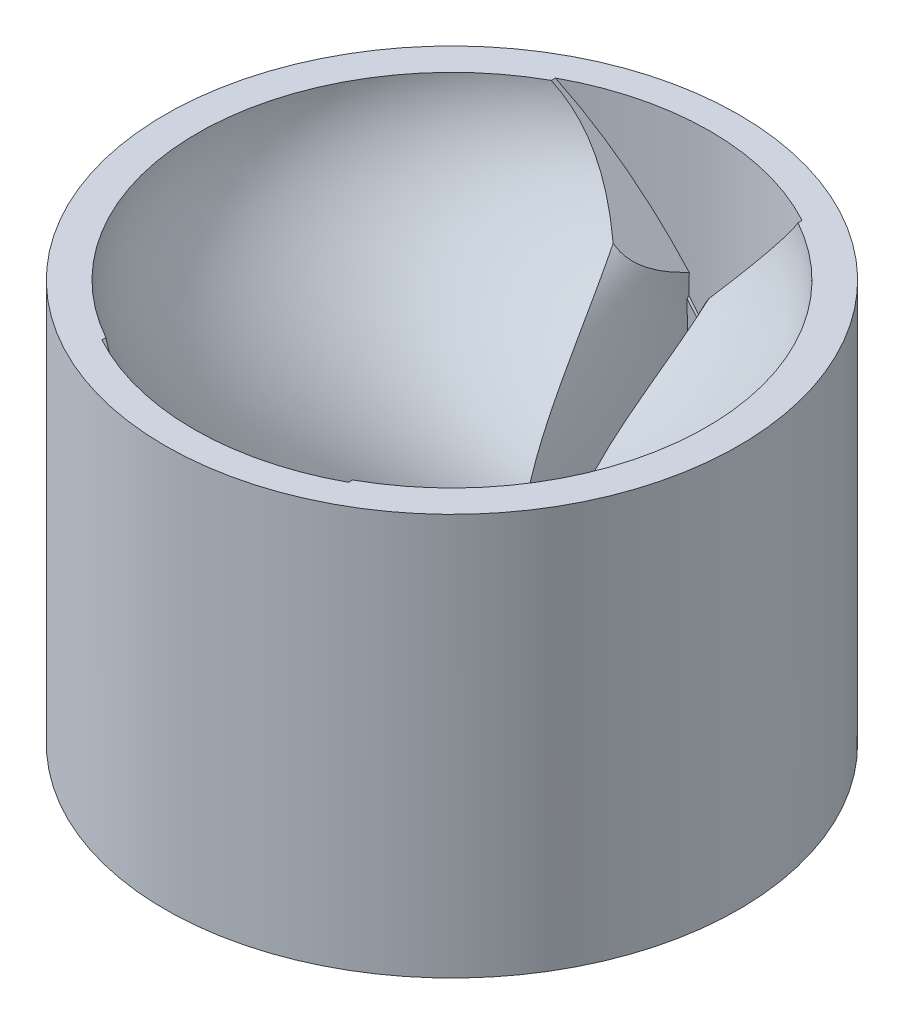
ISO-10303-21;
HEADER;
FILE_DESCRIPTION(('STEP AP214'),'2;1');
FILE_NAME('part.step','',(''),(''),'','','');
FILE_SCHEMA(('AUTOMOTIVE_DESIGN { 1 0 10303 214 1 1 1 1 }'));
ENDSEC;
DATA;
#1=APPLICATION_CONTEXT('core data for automotive mechanical design processes');
#2=APPLICATION_PROTOCOL_DEFINITION('international standard','automotive_design',2000,#1);
#3=PRODUCT_CONTEXT('',#1,'mechanical');
#4=PRODUCT('Part','Part','',(#3));
#5=PRODUCT_RELATED_PRODUCT_CATEGORY('part','',(#4));
#6=PRODUCT_DEFINITION_FORMATION('','',#4);
#7=PRODUCT_DEFINITION_CONTEXT('part definition',#1,'design');
#8=PRODUCT_DEFINITION('design','',#6,#7);
#9=PRODUCT_DEFINITION_SHAPE('','',#8);
#10=(LENGTH_UNIT() NAMED_UNIT(*) SI_UNIT(.MILLI.,.METRE.));
#11=(NAMED_UNIT(*) PLANE_ANGLE_UNIT() SI_UNIT($,.RADIAN.));
#12=(NAMED_UNIT(*) SI_UNIT($,.STERADIAN.) SOLID_ANGLE_UNIT());
#13=UNCERTAINTY_MEASURE_WITH_UNIT(LENGTH_MEASURE(1.E-05),#10,'distance_accuracy_value','');
#14=(GEOMETRIC_REPRESENTATION_CONTEXT(3) GLOBAL_UNCERTAINTY_ASSIGNED_CONTEXT((#13)) GLOBAL_UNIT_ASSIGNED_CONTEXT((#10,
#11,#12)) REPRESENTATION_CONTEXT('',''));
#15=CARTESIAN_POINT('',(0.,0.,0.));
#16=DIRECTION('',(0.,0.,1.));
#17=DIRECTION('',(1.,0.,0.));
#18=AXIS2_PLACEMENT_3D('',#15,#16,#17);
#19=CARTESIAN_POINT('',(0.,-2.,0.));
#20=DIRECTION('',(0.,-1.,0.));
#21=DIRECTION('',(0.,0.,-1.));
#22=AXIS2_PLACEMENT_3D('',#19,#20,#21);
#23=CYLINDRICAL_SURFACE('',#22,8.5);
#24=CARTESIAN_POINT('',(0.,-2.,0.));
#25=DIRECTION('',(0.,-1.,0.));
#26=DIRECTION('',(0.,0.,-1.));
#27=AXIS2_PLACEMENT_3D('',#24,#25,#26);
#28=CIRCLE('',#27,8.5);
#29=CARTESIAN_POINT('',(8.47699091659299,-2.,0.624999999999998));
#30=VERTEX_POINT('',#29);
#31=CARTESIAN_POINT('',(-8.47699091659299,-2.,0.624999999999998));
#32=VERTEX_POINT('',#31);
#33=EDGE_CURVE('E482',#30,#32,#28,.T.);
#34=ORIENTED_EDGE('',*,*,#33,.F.);
#35=CARTESIAN_POINT('',(0.,-1.375,0.));
#36=DIRECTION('',(0.,0.707106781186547,0.707106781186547));
#37=DIRECTION('',(0.,-0.707106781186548,0.707106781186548));
#38=AXIS2_PLACEMENT_3D('',#35,#36,#37);
#39=ELLIPSE('',#38,12.0208152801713,8.5);
#40=CARTESIAN_POINT('',(8.42522254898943,-2.5,1.125));
#41=VERTEX_POINT('',#40);
#42=EDGE_CURVE('E12',#30,#41,#39,.F.);
#43=ORIENTED_EDGE('',*,*,#42,.T.);
#44=DIRECTION('',(0.,-1.,0.));
#45=VECTOR('',#44,1.);
#46=CARTESIAN_POINT('',(8.42522254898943,2.58938993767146,1.125));
#47=LINE('',#46,#45);
#48=CARTESIAN_POINT('',(8.42522254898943,-5.,1.125));
#49=VERTEX_POINT('',#48);
#50=EDGE_CURVE('E474',#41,#49,#47,.T.);
#51=ORIENTED_EDGE('',*,*,#50,.T.);
#52=CARTESIAN_POINT('',(0.,-5.,0.));
#53=DIRECTION('',(0.,-1.,0.));
#54=DIRECTION('',(0.,0.,-1.));
#55=AXIS2_PLACEMENT_3D('',#52,#53,#54);
#56=CIRCLE('',#55,8.5);
#57=CARTESIAN_POINT('',(-8.42522254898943,-5.,1.125));
#58=VERTEX_POINT('',#57);
#59=EDGE_CURVE('E468',#49,#58,#56,.T.);
#60=ORIENTED_EDGE('',*,*,#59,.T.);
#61=DIRECTION('',(0.,-1.,0.));
#62=VECTOR('',#61,1.);
#63=CARTESIAN_POINT('',(-8.42522254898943,2.58938993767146,1.125));
#64=LINE('',#63,#62);
#65=CARTESIAN_POINT('',(-8.42522254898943,-2.5,1.125));
#66=VERTEX_POINT('',#65);
#67=EDGE_CURVE('E1847',#66,#58,#64,.T.);
#68=ORIENTED_EDGE('',*,*,#67,.F.);
#69=CARTESIAN_POINT('',(0.,-1.375,0.));
#70=DIRECTION('',(0.,0.707106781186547,0.707106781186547));
#71=DIRECTION('',(0.,-0.707106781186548,0.707106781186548));
#72=AXIS2_PLACEMENT_3D('',#69,#70,#71);
#73=ELLIPSE('',#72,12.0208152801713,8.5);
#74=EDGE_CURVE('E1237',#66,#32,#73,.F.);
#75=ORIENTED_EDGE('',*,*,#74,.T.);
#76=EDGE_LOOP('',(#34,#43,#51,#60,#68,#75));
#77=FACE_BOUND('',#76,.T.);
#78=ADVANCED_FACE('F204',(#77),#23,.F.);
#79=CARTESIAN_POINT('',(0.,3.,0.));
#80=DIRECTION('',(0.,-1.,0.));
#81=DIRECTION('',(0.,0.,-1.));
#82=AXIS2_PLACEMENT_3D('',#79,#80,#81);
#83=CYLINDRICAL_SURFACE('',#82,6.5);
#84=DIRECTION('',(0.,-1.,0.));
#85=VECTOR('',#84,1.);
#86=CARTESIAN_POINT('',(-1.45,3.,6.33620548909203));
#87=LINE('',#86,#85);
#88=CARTESIAN_POINT('',(-1.45,3.,6.33620548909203));
#89=VERTEX_POINT('',#88);
#90=CARTESIAN_POINT('',(-1.45,0.,6.33620548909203));
#91=VERTEX_POINT('',#90);
#92=EDGE_CURVE('E670',#89,#91,#87,.T.);
#93=ORIENTED_EDGE('',*,*,#92,.T.);
#94=CARTESIAN_POINT('',(0.,0.,0.));
#95=DIRECTION('',(0.,-1.,0.));
#96=DIRECTION('',(0.,0.,-1.));
#97=AXIS2_PLACEMENT_3D('',#94,#95,#96);
#98=CIRCLE('',#97,6.5);
#99=CARTESIAN_POINT('',(1.45,0.,6.33620548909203));
#100=VERTEX_POINT('',#99);
#101=EDGE_CURVE('E481',#100,#91,#98,.T.);
#102=ORIENTED_EDGE('',*,*,#101,.F.);
#103=DIRECTION('',(0.,-1.,0.));
#104=VECTOR('',#103,1.);
#105=CARTESIAN_POINT('',(1.45,3.,6.33620548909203));
#106=LINE('',#105,#104);
#107=CARTESIAN_POINT('',(1.45,3.,6.33620548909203));
#108=VERTEX_POINT('',#107);
#109=EDGE_CURVE('E1391',#108,#100,#106,.T.);
#110=ORIENTED_EDGE('',*,*,#109,.F.);
#111=CARTESIAN_POINT('',(1.45,3.,-6.33620548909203));
#112=CARTESIAN_POINT('',(4.40375175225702,3.,-5.66025833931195));
#113=CARTESIAN_POINT('',(6.5,3.,-3.03010791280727));
#114=CARTESIAN_POINT('',(6.5,3.,3.03010791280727));
#115=CARTESIAN_POINT('',(4.40375175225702,3.,5.66025833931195));
#116=CARTESIAN_POINT('',(1.45,3.,6.33620548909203));
#117=B_SPLINE_CURVE_WITH_KNOTS('',3,(#111,#112,#113,#114,#115,#116),.UNSPECIFIED.,.F.,.F.,(4,2,
4),(0.,0.5,1.),.UNSPECIFIED.);
#118=CARTESIAN_POINT('',(1.45,3.,-6.33620548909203));
#119=VERTEX_POINT('',#118);
#120=EDGE_CURVE('E633',#108,#119,#117,.F.);
#121=ORIENTED_EDGE('',*,*,#120,.T.);
#122=DIRECTION('',(0.,-1.,0.));
#123=VECTOR('',#122,1.);
#124=CARTESIAN_POINT('',(1.45,3.,-6.33620548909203));
#125=LINE('',#124,#123);
#126=CARTESIAN_POINT('',(1.45,0.,-6.33620548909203));
#127=VERTEX_POINT('',#126);
#128=EDGE_CURVE('E1380',#119,#127,#125,.T.);
#129=ORIENTED_EDGE('',*,*,#128,.T.);
#130=CARTESIAN_POINT('',(-1.45,0.,-6.33620548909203));
#131=VERTEX_POINT('',#130);
#132=EDGE_CURVE('E478',#131,#127,#98,.T.);
#133=ORIENTED_EDGE('',*,*,#132,.F.);
#134=DIRECTION('',(0.,-1.,0.));
#135=VECTOR('',#134,1.);
#136=CARTESIAN_POINT('',(-1.45,3.,-6.33620548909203));
#137=LINE('',#136,#135);
#138=CARTESIAN_POINT('',(-1.45,3.,-6.33620548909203));
#139=VERTEX_POINT('',#138);
#140=EDGE_CURVE('E662',#139,#131,#137,.T.);
#141=ORIENTED_EDGE('',*,*,#140,.F.);
#142=CARTESIAN_POINT('',(-1.45,3.,6.33620548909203));
#143=CARTESIAN_POINT('',(-4.40375175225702,3.,5.66025833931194));
#144=CARTESIAN_POINT('',(-6.5,3.,3.03010791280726));
#145=CARTESIAN_POINT('',(-6.5,3.,-3.03010791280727));
#146=CARTESIAN_POINT('',(-4.40375175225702,3.,-5.66025833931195));
#147=CARTESIAN_POINT('',(-1.45,3.,-6.33620548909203));
#148=B_SPLINE_CURVE_WITH_KNOTS('',3,(#142,#143,#144,#145,#146,#147),.UNSPECIFIED.,.F.,.F.,(4,2,
4),(0.,0.5,1.),.UNSPECIFIED.);
#149=EDGE_CURVE('E671',#139,#89,#148,.F.);
#150=ORIENTED_EDGE('',*,*,#149,.T.);
#151=EDGE_LOOP('',(#93,#102,#110,#121,#129,#133,#141,#150));
#152=FACE_BOUND('',#151,.T.);
#153=CARTESIAN_POINT('',(0.,-2.,0.));
#154=DIRECTION('',(0.,-1.,0.));
#155=DIRECTION('',(0.,0.,-1.));
#156=AXIS2_PLACEMENT_3D('',#153,#154,#155);
#157=CIRCLE('',#156,6.5);
#158=CARTESIAN_POINT('',(0.,-2.,-6.5));
#159=VERTEX_POINT('',#158);
#160=EDGE_CURVE('E469',#159,#159,#157,.T.);
#161=ORIENTED_EDGE('',*,*,#160,.T.);
#162=EDGE_LOOP('',(#161));
#163=FACE_BOUND('',#162,.T.);
#164=ADVANCED_FACE('F640',(#152,#163),#83,.F.);
#165=CARTESIAN_POINT('',(0.,23.,0.));
#166=DIRECTION('',(0.,1.,0.));
#167=DIRECTION('',(0.,0.,1.));
#168=AXIS2_PLACEMENT_3D('',#165,#166,#167);
#169=PLANE('',#168);
#170=CARTESIAN_POINT('',(0.,23.,0.));
#171=DIRECTION('',(0.,1.,0.));
#172=DIRECTION('',(0.,0.,1.));
#173=AXIS2_PLACEMENT_3D('',#170,#171,#172);
#174=CIRCLE('',#173,20.);
#175=CARTESIAN_POINT('',(0.,23.,20.));
#176=VERTEX_POINT('',#175);
#177=EDGE_CURVE('E1409',#176,#176,#174,.T.);
#178=ORIENTED_EDGE('',*,*,#177,.T.);
#179=EDGE_LOOP('',(#178));
#180=FACE_BOUND('',#179,.T.);
#181=CARTESIAN_POINT('',(0.,23.,0.));
#182=DIRECTION('',(0.,-1.,0.));
#183=DIRECTION('',(0.,0.,-1.));
#184=AXIS2_PLACEMENT_3D('',#181,#182,#183);
#185=CIRCLE('',#184,17.75);
#186=CARTESIAN_POINT('',(8.6,23.,-15.5290360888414));
#187=VERTEX_POINT('',#186);
#188=CARTESIAN_POINT('',(8.60000000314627,23.,15.5290287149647));
#189=VERTEX_POINT('',#188);
#190=EDGE_CURVE('E698',#187,#189,#185,.T.);
#191=ORIENTED_EDGE('',*,*,#190,.T.);
#192=DIRECTION('',(0.,0.,-1.));
#193=VECTOR('',#192,1.);
#194=CARTESIAN_POINT('',(8.6,23.,20.001));
#195=LINE('',#194,#193);
#196=CARTESIAN_POINT('',(8.6,23.,15.8126531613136));
#197=VERTEX_POINT('',#196);
#198=EDGE_CURVE('E1122',#197,#189,#195,.T.);
#199=ORIENTED_EDGE('',*,*,#198,.F.);
#200=CARTESIAN_POINT('',(0.,23.,0.));
#201=DIRECTION('',(0.,-1.,0.));
#202=DIRECTION('',(0.,0.,-1.));
#203=AXIS2_PLACEMENT_3D('',#200,#201,#202);
#204=CIRCLE('',#203,18.);
#205=CARTESIAN_POINT('',(-8.6,23.,15.8126531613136));
#206=VERTEX_POINT('',#205);
#207=EDGE_CURVE('E487',#197,#206,#204,.T.);
#208=ORIENTED_EDGE('',*,*,#207,.T.);
#209=DIRECTION('',(0.,0.,-1.));
#210=VECTOR('',#209,1.);
#211=CARTESIAN_POINT('',(-8.6,23.,20.001));
#212=LINE('',#211,#210);
#213=CARTESIAN_POINT('',(-8.6,23.,15.5290352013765));
#214=VERTEX_POINT('',#213);
#215=EDGE_CURVE('E1123',#206,#214,#212,.T.);
#216=ORIENTED_EDGE('',*,*,#215,.T.);
#217=CARTESIAN_POINT('',(-8.6,23.,-15.5290296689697));
#218=VERTEX_POINT('',#217);
#219=EDGE_CURVE('E768',#214,#218,#185,.T.);
#220=ORIENTED_EDGE('',*,*,#219,.T.);
#221=DIRECTION('',(0.,0.,1.));
#222=VECTOR('',#221,1.);
#223=CARTESIAN_POINT('',(-8.6,23.,-20.001));
#224=LINE('',#223,#222);
#225=CARTESIAN_POINT('',(-8.6,23.,-15.8126531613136));
#226=VERTEX_POINT('',#225);
#227=EDGE_CURVE('E563',#226,#218,#224,.T.);
#228=ORIENTED_EDGE('',*,*,#227,.F.);
#229=CARTESIAN_POINT('',(0.,23.,0.));
#230=DIRECTION('',(0.,1.,0.));
#231=DIRECTION('',(0.,0.,1.));
#232=AXIS2_PLACEMENT_3D('',#229,#230,#231);
#233=CIRCLE('',#232,18.);
#234=CARTESIAN_POINT('',(8.6,23.,-15.8126531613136));
#235=VERTEX_POINT('',#234);
#236=EDGE_CURVE('E576',#235,#226,#233,.T.);
#237=ORIENTED_EDGE('',*,*,#236,.F.);
#238=DIRECTION('',(0.,0.,1.));
#239=VECTOR('',#238,1.);
#240=CARTESIAN_POINT('',(8.6,23.,-20.001));
#241=LINE('',#240,#239);
#242=EDGE_CURVE('E581',#235,#187,#241,.T.);
#243=ORIENTED_EDGE('',*,*,#242,.T.);
#244=EDGE_LOOP('',(#191,#199,#208,#216,#220,#228,#237,#243));
#245=FACE_BOUND('',#244,.T.);
#246=ADVANCED_FACE('F649',(#180,#245),#169,.T.);
#247=CARTESIAN_POINT('',(-1.45,3.,6.33620548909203));
#248=CARTESIAN_POINT('',(-1.45,10.6489832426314,6.33620548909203));
#249=CARTESIAN_POINT('',(-3.95744546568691,15.3510167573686,17.3032114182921));
#250=CARTESIAN_POINT('',(-3.95744546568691,23.,17.3032114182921));
#251=CARTESIAN_POINT('',(-1.45,3.,10.2046377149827));
#252=CARTESIAN_POINT('',(-1.45,10.3217179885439,10.2046377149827));
#253=CARTESIAN_POINT('',(-3.12511903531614,15.6782820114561,17.4935741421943));
#254=CARTESIAN_POINT('',(-3.12511903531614,23.,17.4935741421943));
#255=CARTESIAN_POINT('',(-1.45,3.,14.0730699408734));
#256=CARTESIAN_POINT('',(-1.45,9.99445273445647,14.0730699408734));
#257=CARTESIAN_POINT('',(-2.28061604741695,16.0055472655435,17.6235721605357));
#258=CARTESIAN_POINT('',(-2.28061604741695,23.,17.6235721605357));
#259=CARTESIAN_POINT('',(-1.45,3.,17.9415021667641));
#260=CARTESIAN_POINT('',(-1.45,9.66718748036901,17.9415021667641));
#261=CARTESIAN_POINT('',(-1.42957168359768,16.332812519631,17.6923380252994));
#262=CARTESIAN_POINT('',(-1.42957168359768,23.,17.6923380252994));
#263=CARTESIAN_POINT('',(-1.45,3.,18.0112147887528));
#264=CARTESIAN_POINT('',(-1.45,9.66128986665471,18.0112147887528));
#265=CARTESIAN_POINT('',(-1.41423510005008,16.3387101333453,17.693577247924));
#266=CARTESIAN_POINT('',(-1.41423510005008,23.,17.693577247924));
#267=CARTESIAN_POINT('',(-1.45,3.,18.0809274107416));
#268=CARTESIAN_POINT('',(-1.45,9.6553922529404,18.0809274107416));
#269=CARTESIAN_POINT('',(-1.39889851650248,16.3446077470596,17.6948164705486));
#270=CARTESIAN_POINT('',(-1.39889851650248,23.,17.6948164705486));
#271=CARTESIAN_POINT('',(-1.45,3.,18.1506400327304));
#272=CARTESIAN_POINT('',(-1.45,9.6494946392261,18.1506400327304));
#273=CARTESIAN_POINT('',(-1.38356193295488,16.3505053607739,17.6960556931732));
#274=CARTESIAN_POINT('',(-1.38356193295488,23.,17.6960556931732));
#275=CARTESIAN_POINT('',(-1.45,3.,18.1900214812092));
#276=CARTESIAN_POINT('',(-1.45,9.64616301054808,18.1900214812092));
#277=CARTESIAN_POINT('',(-1.37489812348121,16.3538369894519,17.6967557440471));
#278=CARTESIAN_POINT('',(-1.37489812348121,23.,17.6967557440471));
#279=CARTESIAN_POINT('',(-1.45,3.,18.229402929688));
#280=CARTESIAN_POINT('',(-1.45,9.64283138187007,18.229402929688));
#281=CARTESIAN_POINT('',(-1.36623431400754,16.3571686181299,17.6974557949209));
#282=CARTESIAN_POINT('',(-1.36623431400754,23.,17.6974557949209));
#283=CARTESIAN_POINT('',(-1.45,3.,18.2687843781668));
#284=CARTESIAN_POINT('',(-1.45,9.63949975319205,18.2687843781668));
#285=CARTESIAN_POINT('',(-1.35757050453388,16.360500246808,17.6981558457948));
#286=CARTESIAN_POINT('',(-1.35757050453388,23.,17.6981558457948));
#287=B_SPLINE_SURFACE_WITH_KNOTS('',3,3,((#247,#248,#249,#250),(#251,#252,#253,#254),(#255,#256,
#257,#258),(#259,#260,#261,#262),(#263,#264,#265,#266),(#267,#268,#269,#270),(#271,#272,#273,
#274),(#275,#276,#277,#278),(#279,#280,#281,#282),(#283,#284,#285,#286)),.UNSPECIFIED.,.F.,.F.,
.F.,(4,3,3,4),(4,4),(0.,1.,1.01802089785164,1.02820110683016),(0.,1.),.UNSPECIFIED.);
#288=CARTESIAN_POINT('',(-0.895765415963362,13.1457464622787,20.2274058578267));
#289=CARTESIAN_POINT('',(-0.917986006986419,13.1741681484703,20.1083632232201));
#290=CARTESIAN_POINT('',(-0.940645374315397,13.2031510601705,19.9895375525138));
#291=CARTESIAN_POINT('',(-0.986939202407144,13.2623640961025,19.7523778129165));
#292=CARTESIAN_POINT('',(-1.01057374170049,13.2925943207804,19.6340437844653));
#293=CARTESIAN_POINT('',(-1.08313827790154,13.3854094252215,19.2796145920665));
#294=CARTESIAN_POINT('',(-1.13367696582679,13.450051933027,19.0443748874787));
#295=CARTESIAN_POINT('',(-1.22564151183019,13.567681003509,18.640384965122));
#296=CARTESIAN_POINT('',(-1.26582547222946,13.6190790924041,18.4708918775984));
#297=CARTESIAN_POINT('',(-1.32859288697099,13.6993629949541,18.2183524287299));
#298=CARTESIAN_POINT('',(-1.34992297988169,13.7266456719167,18.1344840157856));
#299=CARTESIAN_POINT('',(-1.39350635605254,13.7823918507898,17.9673798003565));
#300=CARTESIAN_POINT('',(-1.41575965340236,13.810855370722,17.8841440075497));
#301=CARTESIAN_POINT('',(-1.46541393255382,13.8743666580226,17.7031796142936));
#302=CARTESIAN_POINT('',(-1.49301065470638,13.9096647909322,17.605591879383));
#303=CARTESIAN_POINT('',(-1.5496861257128,13.9821566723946,17.4115637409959));
#304=CARTESIAN_POINT('',(-1.57876487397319,14.0193504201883,17.3151233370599));
#305=CARTESIAN_POINT('',(-1.66862419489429,14.1342867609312,17.0274262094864));
#306=CARTESIAN_POINT('',(-1.73192175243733,14.2152487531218,16.8381866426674));
#307=CARTESIAN_POINT('',(-1.84384678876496,14.3584086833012,16.5311899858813));
#308=CARTESIAN_POINT('',(-1.89008071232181,14.417545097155,16.4111346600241));
#309=CARTESIAN_POINT('',(-1.98686931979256,14.5413444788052,16.1756095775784));
#310=CARTESIAN_POINT('',(-2.037425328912,14.6060091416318,16.0601412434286));
#311=CARTESIAN_POINT('',(-2.14344752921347,14.7416189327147,15.8356956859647));
#312=CARTESIAN_POINT('',(-2.19890094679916,14.81254772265,15.7267027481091));
#313=CARTESIAN_POINT('',(-2.31552006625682,14.9617117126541,15.517209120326));
#314=CARTESIAN_POINT('',(-2.37668090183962,15.0399406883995,15.4167013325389));
#315=CARTESIAN_POINT('',(-2.51850464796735,15.2213431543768,15.2078234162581));
#316=CARTESIAN_POINT('',(-2.6006133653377,15.3263659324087,15.1019536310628));
#317=CARTESIAN_POINT('',(-2.73071801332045,15.4927788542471,14.9604223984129));
#318=CARTESIAN_POINT('',(-2.77519878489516,15.5496728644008,14.9161572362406));
#319=CARTESIAN_POINT('',(-2.86635098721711,15.6662628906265,14.8340710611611));
#320=CARTESIAN_POINT('',(-2.91302161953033,15.7259578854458,14.7962477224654));
#321=CARTESIAN_POINT('',(-3.02015488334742,15.8629888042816,14.7191534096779));
#322=CARTESIAN_POINT('',(-3.08116500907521,15.9410250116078,14.6818543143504));
#323=CARTESIAN_POINT('',(-3.1744467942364,16.0603389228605,14.6346128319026));
#324=CARTESIAN_POINT('',(-3.2059045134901,16.1005755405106,14.6202955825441));
#325=CARTESIAN_POINT('',(-3.26927547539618,16.1816314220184,14.5945831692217));
#326=CARTESIAN_POINT('',(-3.30118878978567,16.2224507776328,14.5831884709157));
#327=CARTESIAN_POINT('',(-3.33327817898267,16.2634953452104,14.5732432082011));
#328=B_SPLINE_CURVE_WITH_KNOTS('',3,(#288,#289,#290,#291,#292,#293,#294,#295,#296,#297,#298,
#299,#300,#301,#302,#303,#304,#305,#306,#307,#308,#309,#310,#311,#312,#313,#314,#315,#316,#317,
#318,#319,#320,#321,#322,#323,#324,#325,#326,#327),.UNSPECIFIED.,.F.,.F.,(4,2,2,2,2,2,2,2,2,2,2,
2,2,2,2,2,2,2,2,4),(0.,0.37316235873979,0.746354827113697,1.49362451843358,2.03838973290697,
2.31058853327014,2.58279148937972,2.90490227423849,3.22701293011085,3.87252031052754,
4.29710219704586,4.72181473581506,5.14545051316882,5.56872833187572,6.07734540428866,
6.33118445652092,6.58493166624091,6.90167564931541,7.06073117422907,7.21981202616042),.UNSPECIFIED.);
#329=CARTESIAN_POINT('',(-1.39949836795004,13.7900560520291,17.945512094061));
#330=VERTEX_POINT('',#329);
#331=CARTESIAN_POINT('',(-3.33327817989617,16.2634953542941,14.5732432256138));
#332=VERTEX_POINT('',#331);
#333=EDGE_CURVE('E823',#330,#332,#328,.T.);
#334=CARTESIAN_POINT('',(-1.39949836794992,13.7900560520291,17.9455120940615));
#335=CARTESIAN_POINT('',(-1.40048968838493,13.73644707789,17.9454348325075));
#336=CARTESIAN_POINT('',(-1.40145179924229,13.6828375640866,17.9453602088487));
#337=CARTESIAN_POINT('',(-1.40334373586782,13.5743292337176,17.9452137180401));
#338=CARTESIAN_POINT('',(-1.4042722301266,13.5194303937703,17.9451419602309));
#339=CARTESIAN_POINT('',(-1.40609690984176,13.4083435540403,17.9450006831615));
#340=CARTESIAN_POINT('',(-1.40699182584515,13.3521555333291,17.944931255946));
#341=CARTESIAN_POINT('',(-1.40874927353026,13.2384904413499,17.9447943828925));
#342=CARTESIAN_POINT('',(-1.40961059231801,13.1810133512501,17.9447270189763));
#343=CARTESIAN_POINT('',(-1.41130085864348,13.0647702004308,17.9445941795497));
#344=CARTESIAN_POINT('',(-1.41212864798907,13.0060041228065,17.9445287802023));
#345=CARTESIAN_POINT('',(-1.41375191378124,12.8871830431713,17.9443999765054));
#346=CARTESIAN_POINT('',(-1.4145462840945,12.8271280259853,17.9443366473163));
#347=CARTESIAN_POINT('',(-1.41610285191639,12.7057290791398,17.9442122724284));
#348=CARTESIAN_POINT('',(-1.41686399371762,12.6443851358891,17.9441513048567));
#349=CARTESIAN_POINT('',(-1.41835422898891,12.5204083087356,17.9440321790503));
#350=CARTESIAN_POINT('',(-1.41908231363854,12.4577754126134,17.9439741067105));
#351=CARTESIAN_POINT('',(-1.41978736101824,12.3951422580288,17.943918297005));
#352=B_SPLINE_CURVE_WITH_KNOTS('',3,(#334,#335,#336,#337,#338,#339,#340,#341,#342,#343,#344,
#345,#346,#347,#348,#349,#350,#351),.UNSPECIFIED.,.F.,.F.,(4,2,2,2,2,2,2,2,4),(0.,
0.160854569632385,0.3255747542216,0.494160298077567,0.666611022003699,0.842926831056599,
1.0231077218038,1.20715378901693,1.3950652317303),.UNSPECIFIED.);
#353=CARTESIAN_POINT('',(-1.41978736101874,12.3951422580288,17.9439182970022));
#354=VERTEX_POINT('',#353);
#355=EDGE_CURVE('E898',#330,#354,#352,.T.);
#356=CARTESIAN_POINT('',(-1.41978736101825,12.3951422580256,17.9439182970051));
#357=CARTESIAN_POINT('',(-1.42072685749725,12.3884706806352,17.9391334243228));
#358=CARTESIAN_POINT('',(-1.42166056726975,12.3817966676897,17.9343508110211));
#359=CARTESIAN_POINT('',(-1.42350816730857,12.3685026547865,17.924833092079));
#360=CARTESIAN_POINT('',(-1.42442215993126,12.3618827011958,17.9200979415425));
#361=CARTESIAN_POINT('',(-1.42623057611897,12.3486969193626,17.9106758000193));
#362=CARTESIAN_POINT('',(-1.42712510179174,12.3421311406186,17.9059887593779));
#363=CARTESIAN_POINT('',(-1.428894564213,12.3290526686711,17.8966650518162));
#364=CARTESIAN_POINT('',(-1.42976960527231,12.3225400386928,17.8920283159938));
#365=CARTESIAN_POINT('',(-1.43161736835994,12.3087007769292,17.8821818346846));
#366=CARTESIAN_POINT('',(-1.43258870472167,12.3013736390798,17.8769725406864));
#367=CARTESIAN_POINT('',(-1.43445526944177,12.2871936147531,17.8668980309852));
#368=CARTESIAN_POINT('',(-1.43535132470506,12.2803410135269,17.8620325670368));
#369=CARTESIAN_POINT('',(-1.43706843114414,12.2671083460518,17.8526533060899));
#370=CARTESIAN_POINT('',(-1.43789033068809,12.2607288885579,17.8481388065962));
#371=CARTESIAN_POINT('',(-1.43946029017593,12.2484415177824,17.8394677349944));
#372=CARTESIAN_POINT('',(-1.44020922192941,12.2425345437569,17.8353099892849));
#373=CARTESIAN_POINT('',(-1.44095260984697,12.2366200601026,17.8311619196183));
#374=B_SPLINE_CURVE_WITH_KNOTS('',3,(#356,#357,#358,#359,#360,#361,#362,#363,#364,#365,#366,
#367,#368,#369,#370,#371,#372,#373),.UNSPECIFIED.,.F.,.F.,(4,2,2,2,2,2,2,2,4),(0.,
0.0247908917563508,0.0493617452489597,0.0737113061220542,0.0978383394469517,0.124965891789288,
0.150321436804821,0.173896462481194,0.195683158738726),.UNSPECIFIED.);
#375=CARTESIAN_POINT('',(-1.44095643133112,12.2366182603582,17.8311583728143));
#376=VERTEX_POINT('',#375);
#377=EDGE_CURVE('E904',#354,#376,#374,.T.);
#378=CARTESIAN_POINT('',(-1.45,3.,17.9415021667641));
#379=CARTESIAN_POINT('',(-1.45,9.66718748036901,17.9415021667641));
#380=CARTESIAN_POINT('',(-1.42957168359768,16.332812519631,17.6923380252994));
#381=CARTESIAN_POINT('',(-1.42957168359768,23.,17.6923380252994));
#382=B_SPLINE_CURVE_WITH_KNOTS('',3,(#378,#379,#380,#381),.UNSPECIFIED.,.F.,.F.,(4,4),(0.,1.),.UNSPECIFIED.);
#383=CARTESIAN_POINT('',(-1.45,3.,17.9415021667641));
#384=VERTEX_POINT('',#383);
#385=EDGE_CURVE('E790',#384,#376,#382,.T.);
#386=CARTESIAN_POINT('',(-1.45,3.,18.2687843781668));
#387=CARTESIAN_POINT('',(-1.45,3.,18.229402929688));
#388=CARTESIAN_POINT('',(-1.45,3.,18.1900214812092));
#389=CARTESIAN_POINT('',(-1.45,3.,18.1506400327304));
#390=CARTESIAN_POINT('',(-1.45,3.,18.0809274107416));
#391=CARTESIAN_POINT('',(-1.45,3.,18.0112147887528));
#392=CARTESIAN_POINT('',(-1.45,3.,17.9415021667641));
#393=CARTESIAN_POINT('',(-1.45,3.,14.0730699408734));
#394=CARTESIAN_POINT('',(-1.45,3.,10.2046377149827));
#395=CARTESIAN_POINT('',(-1.45,3.,6.33620548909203));
#396=B_SPLINE_CURVE_WITH_KNOTS('',3,(#386,#387,#388,#389,#390,#391,#392,#393,#394,#395),
.UNSPECIFIED.,.F.,.F.,(4,3,3,4),(0.,0.0101802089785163,0.0282011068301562,1.02820110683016),.UNSPECIFIED.);
#397=EDGE_CURVE('E1533',#384,#89,#396,.T.);
#398=CARTESIAN_POINT('',(-1.45,3.,6.33620548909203));
#399=CARTESIAN_POINT('',(-1.45,10.6489832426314,6.33620548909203));
#400=CARTESIAN_POINT('',(-3.95744546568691,15.3510167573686,17.3032114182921));
#401=CARTESIAN_POINT('',(-3.95744546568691,23.,17.3032114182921));
#402=B_SPLINE_CURVE_WITH_KNOTS('',3,(#398,#399,#400,#401),.UNSPECIFIED.,.F.,.F.,(4,4),(0.,1.),.UNSPECIFIED.);
#403=EDGE_CURVE('E787',#332,#89,#402,.F.);
#404=ORIENTED_EDGE('',*,*,#333,.F.);
#405=ORIENTED_EDGE('',*,*,#355,.T.);
#406=ORIENTED_EDGE('',*,*,#377,.T.);
#407=ORIENTED_EDGE('',*,*,#385,.F.);
#408=ORIENTED_EDGE('',*,*,#397,.T.);
#409=ORIENTED_EDGE('',*,*,#403,.F.);
#410=EDGE_LOOP('',(#404,#405,#406,#407,#408,#409));
#411=FACE_BOUND('',#410,.T.);
#412=ADVANCED_FACE('F825',(#411),#287,.F.);
#413=CARTESIAN_POINT('',(-1.45,3.,17.9415021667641));
#414=CARTESIAN_POINT('',(-1.45,9.66718748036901,17.9415021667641));
#415=CARTESIAN_POINT('',(-1.42957168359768,16.332812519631,17.6923380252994));
#416=CARTESIAN_POINT('',(-1.42957168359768,23.,17.6923380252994));
#417=CARTESIAN_POINT('',(-0.483333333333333,3.,17.9415021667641));
#418=CARTESIAN_POINT('',(-0.483333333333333,9.66718748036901,17.9415021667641));
#419=CARTESIAN_POINT('',(-0.477991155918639,16.332812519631,17.7692273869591));
#420=CARTESIAN_POINT('',(-0.477991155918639,23.,17.7692273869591));
#421=CARTESIAN_POINT('',(0.483333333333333,3.,17.9415021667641));
#422=CARTESIAN_POINT('',(0.483333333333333,9.66718748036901,17.9415021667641));
#423=CARTESIAN_POINT('',(0.477991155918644,16.332812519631,17.7692273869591));
#424=CARTESIAN_POINT('',(0.477991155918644,23.,17.7692273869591));
#425=CARTESIAN_POINT('',(1.45,3.,17.9415021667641));
#426=CARTESIAN_POINT('',(1.45,9.66718748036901,17.9415021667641));
#427=CARTESIAN_POINT('',(1.42957168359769,16.332812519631,17.6923380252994));
#428=CARTESIAN_POINT('',(1.42957168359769,23.,17.6923380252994));
#429=B_SPLINE_SURFACE_WITH_KNOTS('',3,3,((#413,#414,#415,#416),(#417,#418,#419,#420),(#421,#422,
#423,#424),(#425,#426,#427,#428)),.UNSPECIFIED.,.F.,.F.,.F.,(4,4),(4,4),(0.,1.),(0.,1.),.UNSPECIFIED.);
#430=CARTESIAN_POINT('',(-1.44095143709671,12.2366129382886,17.831158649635));
#431=CARTESIAN_POINT('',(-1.42606137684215,12.2170392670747,17.8320515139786));
#432=CARTESIAN_POINT('',(-1.41117188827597,12.1974645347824,17.8329307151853));
#433=CARTESIAN_POINT('',(-1.38138357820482,12.1583119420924,17.8346626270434));
#434=CARTESIAN_POINT('',(-1.36648475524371,12.1387340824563,17.8355153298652));
#435=CARTESIAN_POINT('',(-1.34164167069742,12.1061071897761,17.8369148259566));
#436=CARTESIAN_POINT('',(-1.33170049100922,12.0930561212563,17.8374688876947));
#437=CARTESIAN_POINT('',(-1.30187542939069,12.0538942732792,17.8391138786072));
#438=CARTESIAN_POINT('',(-1.28199439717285,12.0277805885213,17.8401873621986));
#439=CARTESIAN_POINT('',(-1.24679060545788,11.9815540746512,17.842047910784));
#440=CARTESIAN_POINT('',(-1.23146952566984,11.9614403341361,17.842844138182));
#441=CARTESIAN_POINT('',(-1.19623895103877,11.915204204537,17.8446445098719));
#442=CARTESIAN_POINT('',(-1.17632711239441,11.8890832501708,17.84563964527));
#443=CARTESIAN_POINT('',(-1.13191321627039,11.8308316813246,17.8478108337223));
#444=CARTESIAN_POINT('',(-1.10740963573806,11.7987018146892,17.8489758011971));
#445=CARTESIAN_POINT('',(-1.06270679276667,11.7401014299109,17.8510430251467));
#446=CARTESIAN_POINT('',(-1.04250900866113,11.71363014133,17.8519554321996));
#447=CARTESIAN_POINT('',(-1.00220255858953,11.660817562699,17.8537342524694));
#448=CARTESIAN_POINT('',(-0.98209392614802,11.6344762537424,17.8546008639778));
#449=CARTESIAN_POINT('',(-0.941966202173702,11.5819234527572,17.8562898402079));
#450=CARTESIAN_POINT('',(-0.921947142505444,11.5557119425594,17.8571123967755));
#451=CARTESIAN_POINT('',(-0.881998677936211,11.5034187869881,17.85871497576));
#452=CARTESIAN_POINT('',(-0.862069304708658,11.4773371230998,17.8594951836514));
#453=CARTESIAN_POINT('',(-0.822300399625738,11.4253036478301,17.8610147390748));
#454=CARTESIAN_POINT('',(-0.802460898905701,11.3993518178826,17.8617542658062));
#455=CARTESIAN_POINT('',(-0.762871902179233,11.3475780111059,17.8631940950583));
#456=CARTESIAN_POINT('',(-0.743122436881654,11.3217560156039,17.8638945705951));
#457=CARTESIAN_POINT('',(-0.703006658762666,11.269317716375,17.8652823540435));
#458=CARTESIAN_POINT('',(-0.682640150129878,11.2427015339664,17.8659685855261));
#459=CARTESIAN_POINT('',(-0.641956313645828,11.1895461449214,17.8673039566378));
#460=CARTESIAN_POINT('',(-0.621639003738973,11.1630069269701,17.8679531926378));
#461=CARTESIAN_POINT('',(-0.581053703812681,11.1100054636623,17.8692160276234));
#462=CARTESIAN_POINT('',(-0.560785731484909,11.0835432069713,17.869829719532));
#463=CARTESIAN_POINT('',(-0.520299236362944,11.0306956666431,17.8710228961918));
#464=CARTESIAN_POINT('',(-0.500080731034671,11.004310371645,17.8716024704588));
#465=CARTESIAN_POINT('',(-0.45969329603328,10.951616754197,17.8727288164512));
#466=CARTESIAN_POINT('',(-0.439524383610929,10.9253084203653,17.8732756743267));
#467=CARTESIAN_POINT('',(-0.399236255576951,10.8727687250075,17.8743379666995));
#468=CARTESIAN_POINT('',(-0.379117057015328,10.8465373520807,17.8748534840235));
#469=CARTESIAN_POINT('',(-0.338928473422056,10.7941515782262,17.8758544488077));
#470=CARTESIAN_POINT('',(-0.318859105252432,10.7679971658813,17.8763399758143));
#471=CARTESIAN_POINT('',(-0.278770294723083,10.7157653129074,17.8772822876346));
#472=CARTESIAN_POINT('',(-0.258750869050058,10.6896878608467,17.8777391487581));
#473=CARTESIAN_POINT('',(-0.218762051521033,10.6376099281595,17.8786254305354));
#474=CARTESIAN_POINT('',(-0.198792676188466,10.6116094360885,17.8790549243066));
#475=CARTESIAN_POINT('',(-0.158904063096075,10.5596854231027,17.8798877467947));
#476=CARTESIAN_POINT('',(-0.138984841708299,10.5337618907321,17.8802911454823));
#477=CARTESIAN_POINT('',(-0.099196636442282,10.4819917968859,17.8810730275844));
#478=CARTESIAN_POINT('',(-0.0793276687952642,10.4561452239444,17.8814515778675));
#479=CARTESIAN_POINT('',(-0.0396400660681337,10.4045290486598,17.8821849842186));
#480=CARTESIAN_POINT('',(-0.01982144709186,10.3787594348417,17.8825399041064));
#481=CARTESIAN_POINT('',(-6.62682880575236E-10,10.3529918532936,17.8828840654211));
#482=B_SPLINE_CURVE_WITH_KNOTS('',3,(#430,#431,#432,#433,#434,#435,#436,#437,#438,#439,#440,
#441,#442,#443,#444,#445,#446,#447,#448,#449,#450,#451,#452,#453,#454,#455,#456,#457,#458,#459,
#460,#461,#462,#463,#464,#465,#466,#467,#468,#469,#470,#471,#472,#473,#474,#475,#476,#477,#478,
#479,#480,#481),.UNSPECIFIED.,.F.,.F.,(4,2,2,2,2,2,2,2,2,2,2,2,2,2,2,2,2,2,2,2,2,2,2,2,2,4),(0.,
0.0738292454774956,0.147680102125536,0.19692621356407,0.295440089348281,0.371330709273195,
0.469910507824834,0.591182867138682,0.691110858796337,0.7905631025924,0.88953955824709,
0.988040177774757,1.08606490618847,1.18361368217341,1.28417797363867,1.38446704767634,
1.48448085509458,1.58421934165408,1.68368244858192,1.78287011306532,1.88178226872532,
1.98041884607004,2.07877977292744,2.17686497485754,2.2746743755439,2.37220789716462),.UNSPECIFIED.);
#483=CARTESIAN_POINT('',(-2.69964683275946E-11,10.3529918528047,17.8828840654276));
#484=VERTEX_POINT('',#483);
#485=EDGE_CURVE('E916',#376,#484,#482,.T.);
#486=CARTESIAN_POINT('',(-2.69966340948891E-11,10.3529918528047,17.8828840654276));
#487=CARTESIAN_POINT('',(0.0596288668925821,10.4305084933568,17.8818486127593));
#488=CARTESIAN_POINT('',(0.119232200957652,10.5080435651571,17.88071599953));
#489=CARTESIAN_POINT('',(0.238893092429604,10.6638091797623,17.8782177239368));
#490=CARTESIAN_POINT('',(0.298950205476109,10.742040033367,17.8768501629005));
#491=CARTESIAN_POINT('',(0.419515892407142,10.8991971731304,17.8738472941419));
#492=CARTESIAN_POINT('',(0.480024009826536,10.9781237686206,17.8722098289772));
#493=CARTESIAN_POINT('',(0.601488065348,11.1366726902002,17.8686301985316));
#494=CARTESIAN_POINT('',(0.662443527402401,11.2162953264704,17.8666856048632));
#495=CARTESIAN_POINT('',(0.783260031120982,11.3742221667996,17.8625060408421));
#496=CARTESIAN_POINT('',(0.843122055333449,11.4525257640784,17.8602765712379));
#497=CARTESIAN_POINT('',(0.962806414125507,11.6091903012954,17.8554713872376));
#498=CARTESIAN_POINT('',(1.0226287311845,11.6875512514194,17.8528955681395));
#499=CARTESIAN_POINT('',(1.14223017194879,11.8443308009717,17.8473668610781));
#500=CARTESIAN_POINT('',(1.2020092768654,11.9227494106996,17.8444138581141));
#501=CARTESIAN_POINT('',(1.32152088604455,12.0796441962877,17.8380998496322));
#502=CARTESIAN_POINT('',(1.38125337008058,12.1581203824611,17.8347387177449));
#503=CARTESIAN_POINT('',(1.44095143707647,12.2366129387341,17.8311586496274));
#504=B_SPLINE_CURVE_WITH_KNOTS('',3,(#486,#487,#488,#489,#490,#491,#492,#493,#494,#495,#496,
#497,#498,#499,#500,#501,#502,#503),.UNSPECIFIED.,.F.,.F.,(4,2,2,2,2,2,2,2,4),(0.,
0.293410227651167,0.589313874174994,0.887708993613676,1.18859389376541,1.48436176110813,
1.78021924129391,2.07616714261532,2.37220691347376),.UNSPECIFIED.);
#505=CARTESIAN_POINT('',(1.44095321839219,12.2366129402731,17.8311585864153));
#506=VERTEX_POINT('',#505);
#507=EDGE_CURVE('E795',#484,#506,#504,.T.);
#508=CARTESIAN_POINT('',(1.45,3.,17.9415021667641));
#509=CARTESIAN_POINT('',(1.45,9.66718748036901,17.9415021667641));
#510=CARTESIAN_POINT('',(1.42957168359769,16.332812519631,17.6923380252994));
#511=CARTESIAN_POINT('',(1.42957168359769,23.,17.6923380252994));
#512=B_SPLINE_CURVE_WITH_KNOTS('',3,(#508,#509,#510,#511),.UNSPECIFIED.,.F.,.F.,(4,4),(0.,1.),.UNSPECIFIED.);
#513=CARTESIAN_POINT('',(1.45,3.,17.9415021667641));
#514=VERTEX_POINT('',#513);
#515=EDGE_CURVE('E1479',#514,#506,#512,.T.);
#516=CARTESIAN_POINT('',(1.45,3.,17.9415021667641));
#517=CARTESIAN_POINT('',(0.483333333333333,3.,17.9415021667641));
#518=CARTESIAN_POINT('',(-0.483333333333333,3.,17.9415021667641));
#519=CARTESIAN_POINT('',(-1.45,3.,17.9415021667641));
#520=B_SPLINE_CURVE_WITH_KNOTS('',3,(#516,#517,#518,#519),.UNSPECIFIED.,.F.,.F.,(4,4),(0.,1.),.UNSPECIFIED.);
#521=EDGE_CURVE('E1476',#384,#514,#520,.F.);
#522=ORIENTED_EDGE('',*,*,#385,.T.);
#523=ORIENTED_EDGE('',*,*,#485,.T.);
#524=ORIENTED_EDGE('',*,*,#507,.T.);
#525=ORIENTED_EDGE('',*,*,#515,.F.);
#526=ORIENTED_EDGE('',*,*,#521,.F.);
#527=EDGE_LOOP('',(#522,#523,#524,#525,#526));
#528=FACE_BOUND('',#527,.T.);
#529=ADVANCED_FACE('F830',(#528),#429,.F.);
#530=CARTESIAN_POINT('',(-1.45,3.,-6.33620548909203));
#531=CARTESIAN_POINT('',(-1.45,10.6489832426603,-6.33620548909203));
#532=CARTESIAN_POINT('',(-3.96178762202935,15.3510167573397,-17.3022177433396));
#533=CARTESIAN_POINT('',(-3.96178762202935,23.,-17.3022177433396));
#534=CARTESIAN_POINT('',(-4.40375175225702,3.,-5.66025833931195));
#535=CARTESIAN_POINT('',(-4.40375175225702,10.6489832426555,-5.66025833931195));
#536=CARTESIAN_POINT('',(-12.0275697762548,15.3510167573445,-15.4553495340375));
#537=CARTESIAN_POINT('',(-12.0275697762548,23.,-15.4553495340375));
#538=CARTESIAN_POINT('',(-6.5,3.,-3.03010791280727));
#539=CARTESIAN_POINT('',(-6.5,10.6489832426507,-3.03010791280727));
#540=CARTESIAN_POINT('',(-17.7510381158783,15.3510167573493,-8.2722977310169));
#541=CARTESIAN_POINT('',(-17.7510381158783,23.,-8.2722977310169));
#542=CARTESIAN_POINT('',(-6.5,3.,3.03010791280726));
#543=CARTESIAN_POINT('',(-6.5,10.648983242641,3.03010791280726));
#544=CARTESIAN_POINT('',(-17.748961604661,15.351016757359,8.27675213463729));
#545=CARTESIAN_POINT('',(-17.748961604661,23.,8.27675213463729));
#546=CARTESIAN_POINT('',(-4.40375175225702,3.,5.66025833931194));
#547=CARTESIAN_POINT('',(-4.40375175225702,10.6489832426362,5.66025833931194));
#548=CARTESIAN_POINT('',(-12.0236908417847,15.3510167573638,15.4583673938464));
#549=CARTESIAN_POINT('',(-12.0236908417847,23.,15.4583673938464));
#550=CARTESIAN_POINT('',(-1.45,3.,6.33620548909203));
#551=CARTESIAN_POINT('',(-1.45,10.6489832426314,6.33620548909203));
#552=CARTESIAN_POINT('',(-3.95744546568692,15.3510167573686,17.3032114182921));
#553=CARTESIAN_POINT('',(-3.95744546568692,23.,17.3032114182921));
#554=B_SPLINE_SURFACE_WITH_KNOTS('',3,3,((#530,#531,#532,#533),(#534,#535,#536,#537),(#538,#539,
#540,#541),(#542,#543,#544,#545),(#546,#547,#548,#549),(#550,#551,#552,#553)),.UNSPECIFIED.,.F.,
.F.,.F.,(4,2,4),(4,4),(0.,0.5,1.),(0.,1.),.UNSPECIFIED.);
#555=CARTESIAN_POINT('',(-3.33327817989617,16.2634953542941,14.5732432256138));
#556=CARTESIAN_POINT('',(-3.45567806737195,16.4200533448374,14.670084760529));
#557=CARTESIAN_POINT('',(-3.57904423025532,16.5778472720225,14.7637964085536));
#558=CARTESIAN_POINT('',(-3.82847238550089,16.8968832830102,14.9444174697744));
#559=CARTESIAN_POINT('',(-3.95454557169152,17.0581396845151,15.0312860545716));
#560=CARTESIAN_POINT('',(-4.20914849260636,17.3837945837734,15.1968095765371));
#561=CARTESIAN_POINT('',(-4.33768417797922,17.5482006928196,15.2754405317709));
#562=CARTESIAN_POINT('',(-4.59695313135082,17.8798237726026,15.423081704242));
#563=CARTESIAN_POINT('',(-4.7276879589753,18.0470427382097,15.4920847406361));
#564=CARTESIAN_POINT('',(-4.98474577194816,18.3758376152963,15.6160682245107));
#565=CARTESIAN_POINT('',(-5.11097326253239,18.5372913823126,15.671568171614));
#566=CARTESIAN_POINT('',(-5.3649002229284,18.8620816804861,15.7715333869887));
#567=CARTESIAN_POINT('',(-5.49259739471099,19.0254152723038,15.8160139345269));
#568=CARTESIAN_POINT('',(-5.74918809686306,19.3536126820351,15.8929470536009));
#569=CARTESIAN_POINT('',(-5.87807976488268,19.5184741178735,15.9254158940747));
#570=CARTESIAN_POINT('',(-6.13678087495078,19.8493708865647,15.9774472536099));
#571=CARTESIAN_POINT('',(-6.26658968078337,20.0154054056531,15.997017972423));
#572=CARTESIAN_POINT('',(-6.48806016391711,20.2986816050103,16.0187167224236));
#573=CARTESIAN_POINT('',(-6.57959761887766,20.4157643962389,16.024299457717));
#574=CARTESIAN_POINT('',(-6.76276919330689,20.650053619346,16.0285139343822));
#575=CARTESIAN_POINT('',(-6.85440333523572,20.7672600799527,16.0271432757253));
#576=CARTESIAN_POINT('',(-7.03754162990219,21.0015067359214,16.017295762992));
#577=CARTESIAN_POINT('',(-7.12904575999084,21.1185469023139,16.0088177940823));
#578=CARTESIAN_POINT('',(-7.31170260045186,21.352177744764,15.9846745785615));
#579=CARTESIAN_POINT('',(-7.40285527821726,21.4687683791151,15.9690086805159));
#580=CARTESIAN_POINT('',(-7.58774776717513,21.7052587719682,15.9298092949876));
#581=CARTESIAN_POINT('',(-7.68146710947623,21.8251323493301,15.9060207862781));
#582=CARTESIAN_POINT('',(-7.8680535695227,22.0637894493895,15.8508058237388));
#583=CARTESIAN_POINT('',(-7.96092063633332,22.182572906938,15.8193789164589));
#584=CARTESIAN_POINT('',(-8.1455843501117,22.4187706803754,15.7490232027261));
#585=CARTESIAN_POINT('',(-8.2373808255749,22.5361847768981,15.7100932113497));
#586=CARTESIAN_POINT('',(-8.41970050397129,22.7693843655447,15.6249474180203));
#587=CARTESIAN_POINT('',(-8.51022348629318,22.8851695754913,15.5787303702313));
#588=CARTESIAN_POINT('',(-8.6,23.,15.5289829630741));
#589=B_SPLINE_CURVE_WITH_KNOTS('',3,(#555,#556,#557,#558,#559,#560,#561,#562,#563,#564,#565,
#566,#567,#568,#569,#570,#571,#572,#573,#574,#575,#576,#577,#578,#579,#580,#581,#582,#583,#584,
#585,#586,#587,#588),.UNSPECIFIED.,.F.,.F.,(4,2,2,2,2,2,2,2,2,2,2,2,2,2,2,2,4),(0.,
0.663230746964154,1.33015844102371,1.99897672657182,2.66829120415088,3.30498683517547,
3.9407946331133,4.57573809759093,5.21027751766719,5.65629987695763,6.10247619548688,
6.5487225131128,6.99500928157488,7.45684007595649,7.91869829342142,8.38062950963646,
8.84263978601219),.UNSPECIFIED.);
#590=EDGE_CURVE('E793',#332,#214,#589,.T.);
#591=CARTESIAN_POINT('',(-1.45,3.,-6.33620548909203));
#592=CARTESIAN_POINT('',(-1.45,10.6489832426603,-6.33620548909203));
#593=CARTESIAN_POINT('',(-3.96178762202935,15.3510167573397,-17.3022177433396));
#594=CARTESIAN_POINT('',(-3.96178762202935,23.,-17.3022177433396));
#595=B_SPLINE_CURVE_WITH_KNOTS('',3,(#591,#592,#593,#594),.UNSPECIFIED.,.F.,.F.,(4,4),(0.,1.),.UNSPECIFIED.);
#596=CARTESIAN_POINT('',(-3.33746974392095,16.2688566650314,-14.5765583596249));
#597=VERTEX_POINT('',#596);
#598=EDGE_CURVE('E761',#139,#597,#595,.T.);
#599=CARTESIAN_POINT('',(-3.33746974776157,16.2688566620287,-14.5765583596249));
#600=CARTESIAN_POINT('',(-3.45973402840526,16.425241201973,-14.6732031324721));
#601=CARTESIAN_POINT('',(-3.58296281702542,16.5828594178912,-14.7667207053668));
#602=CARTESIAN_POINT('',(-3.83210877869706,16.90153448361,-14.946959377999));
#603=CARTESIAN_POINT('',(-3.95803708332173,17.062605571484,-15.033639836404));
#604=CARTESIAN_POINT('',(-4.21234333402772,17.3878810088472,-15.1987979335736));
#605=CARTESIAN_POINT('',(-4.34072719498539,17.552092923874,-15.2772517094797));
#606=CARTESIAN_POINT('',(-4.59968612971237,17.8833194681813,-15.4245546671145));
#607=CARTESIAN_POINT('',(-4.73026275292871,18.0503360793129,-15.4933967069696));
#608=CARTESIAN_POINT('',(-4.98701562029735,18.3787409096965,-15.6170914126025));
#609=CARTESIAN_POINT('',(-5.11309680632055,18.5400075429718,-15.6724617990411));
#610=CARTESIAN_POINT('',(-5.36672671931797,18.8644178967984,-15.7721899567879));
#611=CARTESIAN_POINT('',(-5.49427316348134,19.0275586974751,-15.816562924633));
#612=CARTESIAN_POINT('',(-5.75055856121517,19.3553656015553,-15.8933068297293));
#613=CARTESIAN_POINT('',(-5.87929566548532,19.5200293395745,-15.9256939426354));
#614=CARTESIAN_POINT('',(-6.13768438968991,19.850526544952,-15.9775913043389));
#615=CARTESIAN_POINT('',(-6.26733537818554,20.0163592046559,-15.9971097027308));
#616=CARTESIAN_POINT('',(-6.48862455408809,20.299403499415,-16.0187557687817));
#617=CARTESIAN_POINT('',(-6.58013924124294,20.4164571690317,-16.0243233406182));
#618=CARTESIAN_POINT('',(-6.76326477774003,20.6506875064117,-16.0285106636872));
#619=CARTESIAN_POINT('',(-6.85487564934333,20.7678642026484,-16.0271280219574));
#620=CARTESIAN_POINT('',(-7.0379670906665,21.0020509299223,-16.0172599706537));
#621=CARTESIAN_POINT('',(-7.12944763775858,21.1190609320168,-16.0087734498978));
#622=CARTESIAN_POINT('',(-7.312057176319,21.3526312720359,-15.9846167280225));
#623=CARTESIAN_POINT('',(-7.40318613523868,21.4691915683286,-15.9689458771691));
#624=CARTESIAN_POINT('',(-7.58802865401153,21.7056180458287,-15.9297405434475));
#625=CARTESIAN_POINT('',(-7.68172175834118,21.8254580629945,-15.9059513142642));
#626=CARTESIAN_POINT('',(-7.86825602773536,22.0640484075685,-15.8507391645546));
#627=CARTESIAN_POINT('',(-7.96109714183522,22.1827986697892,-15.8193157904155));
#628=CARTESIAN_POINT('',(-8.14570942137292,22.4189306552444,-15.7489713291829));
#629=CARTESIAN_POINT('',(-8.23748041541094,22.5363121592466,-15.710049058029));
#630=CARTESIAN_POINT('',(-8.41974977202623,22.7694473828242,-15.6249227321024));
#631=CARTESIAN_POINT('',(-8.51024791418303,22.8852008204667,-15.5787174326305));
#632=CARTESIAN_POINT('',(-8.6,23.,-15.5289837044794));
#633=B_SPLINE_CURVE_WITH_KNOTS('',3,(#599,#600,#601,#602,#603,#604,#605,#606,#607,#608,#609,
#610,#611,#612,#613,#614,#615,#616,#617,#618,#619,#620,#621,#622,#623,#624,#625,#626,#627,#628,
#629,#630,#631,#632),.UNSPECIFIED.,.F.,.F.,(4,2,2,2,2,2,2,2,2,2,2,2,2,2,2,2,4),(0.,
0.662378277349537,1.32843616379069,1.99637552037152,2.6648085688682,3.30071551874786,
3.93573879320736,4.56990191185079,5.20366303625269,5.64957293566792,6.09563637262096,
6.54176959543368,6.98794317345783,7.44964820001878,7.91138066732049,8.37318610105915,
8.83507054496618),.UNSPECIFIED.);
#634=EDGE_CURVE('E577',#597,#218,#633,.T.);
#635=ORIENTED_EDGE('',*,*,#590,.F.);
#636=ORIENTED_EDGE('',*,*,#403,.T.);
#637=ORIENTED_EDGE('',*,*,#149,.F.);
#638=ORIENTED_EDGE('',*,*,#598,.T.);
#639=ORIENTED_EDGE('',*,*,#634,.T.);
#640=ORIENTED_EDGE('',*,*,#219,.F.);
#641=EDGE_LOOP('',(#635,#636,#637,#638,#639,#640));
#642=FACE_BOUND('',#641,.T.);
#643=ADVANCED_FACE('F591',(#642),#554,.F.);
#644=CARTESIAN_POINT('',(1.45,3.,18.2687843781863));
#645=CARTESIAN_POINT('',(1.45,9.63949975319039,18.2687843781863));
#646=CARTESIAN_POINT('',(1.35757050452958,16.3605002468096,17.6981558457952));
#647=CARTESIAN_POINT('',(1.35757050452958,23.,17.6981558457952));
#648=CARTESIAN_POINT('',(1.45,3.,18.2294029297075));
#649=CARTESIAN_POINT('',(1.45,9.64283138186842,18.2294029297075));
#650=CARTESIAN_POINT('',(1.36623431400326,16.3571686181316,17.6974557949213));
#651=CARTESIAN_POINT('',(1.36623431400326,23.,17.6974557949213));
#652=CARTESIAN_POINT('',(1.45,3.,18.1900214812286));
#653=CARTESIAN_POINT('',(1.45,9.64616301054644,18.1900214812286));
#654=CARTESIAN_POINT('',(1.37489812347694,16.3538369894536,17.6967557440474));
#655=CARTESIAN_POINT('',(1.37489812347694,23.,17.6967557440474));
#656=CARTESIAN_POINT('',(1.45,3.,18.1506400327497));
#657=CARTESIAN_POINT('',(1.45,9.64949463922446,18.1506400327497));
#658=CARTESIAN_POINT('',(1.38356193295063,16.3505053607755,17.6960556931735));
#659=CARTESIAN_POINT('',(1.38356193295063,23.,17.6960556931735));
#660=CARTESIAN_POINT('',(1.45,3.,18.0809274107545));
#661=CARTESIAN_POINT('',(1.45,9.65539225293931,18.0809274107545));
#662=CARTESIAN_POINT('',(1.39889851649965,16.3446077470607,17.6948164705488));
#663=CARTESIAN_POINT('',(1.39889851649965,23.,17.6948164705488));
#664=CARTESIAN_POINT('',(1.45,3.,18.0112147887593));
#665=CARTESIAN_POINT('',(1.45,9.66128986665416,18.0112147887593));
#666=CARTESIAN_POINT('',(1.41423510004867,16.3387101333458,17.6935772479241));
#667=CARTESIAN_POINT('',(1.41423510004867,23.,17.6935772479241));
#668=CARTESIAN_POINT('',(1.45,3.,17.9415021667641));
#669=CARTESIAN_POINT('',(1.45,9.66718748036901,17.9415021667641));
#670=CARTESIAN_POINT('',(1.42957168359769,16.332812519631,17.6923380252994));
#671=CARTESIAN_POINT('',(1.42957168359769,23.,17.6923380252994));
#672=CARTESIAN_POINT('',(1.45,3.,14.0730699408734));
#673=CARTESIAN_POINT('',(1.45,9.99445273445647,14.0730699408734));
#674=CARTESIAN_POINT('',(2.28061604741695,16.0055472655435,17.6235721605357));
#675=CARTESIAN_POINT('',(2.28061604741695,23.,17.6235721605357));
#676=CARTESIAN_POINT('',(1.45,3.,10.2046377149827));
#677=CARTESIAN_POINT('',(1.45,10.3217179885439,10.2046377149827));
#678=CARTESIAN_POINT('',(3.12511903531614,15.6782820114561,17.4935741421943));
#679=CARTESIAN_POINT('',(3.12511903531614,23.,17.4935741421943));
#680=CARTESIAN_POINT('',(1.45,3.,6.33620548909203));
#681=CARTESIAN_POINT('',(1.45,10.6489832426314,6.33620548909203));
#682=CARTESIAN_POINT('',(3.95744546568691,15.3510167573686,17.3032114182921));
#683=CARTESIAN_POINT('',(3.95744546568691,23.,17.3032114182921));
#684=B_SPLINE_SURFACE_WITH_KNOTS('',3,3,((#644,#645,#646,#647),(#648,#649,#650,#651),(#652,#653,
#654,#655),(#656,#657,#658,#659),(#660,#661,#662,#663),(#664,#665,#666,#667),(#668,#669,#670,
#671),(#672,#673,#674,#675),(#676,#677,#678,#679),(#680,#681,#682,#683)),.UNSPECIFIED.,.F.,.F.,
.F.,(4,3,3,4),(4,4),(-0.0282011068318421,-0.018020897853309,0.,1.),(0.,1.),.UNSPECIFIED.);
#685=CARTESIAN_POINT('',(3.33327817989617,16.2634953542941,14.5732432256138));
#686=CARTESIAN_POINT('',(3.30850812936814,16.2318127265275,14.5809220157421));
#687=CARTESIAN_POINT('',(3.28384187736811,16.2002628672,14.5894621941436));
#688=CARTESIAN_POINT('',(3.23476192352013,16.1374861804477,14.6082829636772));
#689=CARTESIAN_POINT('',(3.21034822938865,16.1062593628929,14.6185636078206));
#690=CARTESIAN_POINT('',(3.13760166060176,16.0132114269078,14.6520207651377));
#691=CARTESIAN_POINT('',(3.08971618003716,15.9519625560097,14.6778269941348));
#692=CARTESIAN_POINT('',(2.99625233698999,15.8324157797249,14.7358499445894));
#693=CARTESIAN_POINT('',(2.95065049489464,15.7740878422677,14.7679675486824));
#694=CARTESIAN_POINT('',(2.86130567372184,15.6598095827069,14.8384217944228));
#695=CARTESIAN_POINT('',(2.81756295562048,15.6038595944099,14.8767593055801));
#696=CARTESIAN_POINT('',(2.72194983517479,15.4815637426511,14.9688706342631));
#697=CARTESIAN_POINT('',(2.67062779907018,15.4159192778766,15.02414559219));
#698=CARTESIAN_POINT('',(2.5712744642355,15.2888394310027,15.1420222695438));
#699=CARTESIAN_POINT('',(2.52324480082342,15.2274061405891,15.2046275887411));
#700=CARTESIAN_POINT('',(2.43017622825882,15.1083649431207,15.3362141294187));
#701=CARTESIAN_POINT('',(2.38515526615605,15.0507799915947,15.4052285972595));
#702=CARTESIAN_POINT('',(2.29820598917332,14.9395658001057,15.5481714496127));
#703=CARTESIAN_POINT('',(2.25627753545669,14.885936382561,15.6220996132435));
#704=CARTESIAN_POINT('',(2.16070785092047,14.7636960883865,15.8011529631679));
#705=CARTESIAN_POINT('',(2.10826117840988,14.6966131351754,15.9079551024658));
#706=CARTESIAN_POINT('',(2.00785578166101,14.568187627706,16.1270929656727));
#707=CARTESIAN_POINT('',(1.95990186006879,14.5068512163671,16.2394344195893));
#708=CARTESIAN_POINT('',(1.86786935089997,14.3891352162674,16.4682856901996));
#709=CARTESIAN_POINT('',(1.82379285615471,14.3327583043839,16.5847977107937));
#710=CARTESIAN_POINT('',(1.73890077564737,14.2241754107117,16.8212056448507));
#711=CARTESIAN_POINT('',(1.69809191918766,14.1719780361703,16.9411078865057));
#712=CARTESIAN_POINT('',(1.61939245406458,14.0713159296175,17.1832948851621));
#713=CARTESIAN_POINT('',(1.58149990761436,14.0228487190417,17.3055779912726));
#714=CARTESIAN_POINT('',(1.5082029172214,13.9290967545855,17.552061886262));
#715=CARTESIAN_POINT('',(1.47279805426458,13.8838114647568,17.6762623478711));
#716=CARTESIAN_POINT('',(1.41572440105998,13.8108102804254,17.8842764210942));
#717=CARTESIAN_POINT('',(1.39343592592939,13.7823017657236,17.9676444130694));
#718=CARTESIAN_POINT('',(1.34978607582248,13.7264705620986,18.1350144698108));
#719=CARTESIAN_POINT('',(1.32842467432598,13.6991478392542,18.2190165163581));
#720=CARTESIAN_POINT('',(1.2656985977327,13.6189168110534,18.4714278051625));
#721=CARTESIAN_POINT('',(1.22558002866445,13.5676023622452,18.6406542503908));
#722=CARTESIAN_POINT('',(1.13573390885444,13.4526829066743,19.0353400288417));
#723=CARTESIAN_POINT('',(1.08705209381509,13.3904154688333,19.2614246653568));
#724=CARTESIAN_POINT('',(1.01695756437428,13.3007596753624,19.6024793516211));
#725=CARTESIAN_POINT('',(0.994050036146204,13.2714593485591,19.7166505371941));
#726=CARTESIAN_POINT('',(0.949153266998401,13.2140332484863,19.9454595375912));
#727=CARTESIAN_POINT('',(0.927163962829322,13.1859073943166,20.0600973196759));
#728=CARTESIAN_POINT('',(0.905589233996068,13.1583118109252,20.1749412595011));
#729=B_SPLINE_CURVE_WITH_KNOTS('',3,(#685,#686,#687,#688,#689,#690,#691,#692,#693,#694,#695,
#696,#697,#698,#699,#700,#701,#702,#703,#704,#705,#706,#707,#708,#709,#710,#711,#712,#713,#714,
#715,#716,#717,#718,#719,#720,#721,#722,#723,#724,#725,#726,#727,#728),.UNSPECIFIED.,.F.,.F.,(4,
2,2,2,2,2,2,2,2,2,2,2,2,2,2,2,2,2,2,2,2,4),(0.,0.122810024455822,0.245623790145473,
0.491018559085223,0.732829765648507,0.974674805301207,1.27417395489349,1.57382080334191,
1.87511954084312,2.17640474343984,2.58578026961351,2.99558853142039,3.40561664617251,
3.81646853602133,4.22704502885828,4.63755219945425,4.91018744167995,5.18281487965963,
5.7267192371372,6.44509425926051,6.80531568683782,7.16551226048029),.UNSPECIFIED.);
#730=CARTESIAN_POINT('',(3.33327817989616,16.2634953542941,14.5732432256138));
#731=VERTEX_POINT('',#730);
#732=CARTESIAN_POINT('',(1.39949836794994,13.790056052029,17.9455120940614));
#733=VERTEX_POINT('',#732);
#734=EDGE_CURVE('E490',#731,#733,#729,.T.);
#735=CARTESIAN_POINT('',(1.45,3.,6.33620548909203));
#736=CARTESIAN_POINT('',(1.45,10.6489832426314,6.33620548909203));
#737=CARTESIAN_POINT('',(3.95744546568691,15.3510167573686,17.3032114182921));
#738=CARTESIAN_POINT('',(3.95744546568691,23.,17.3032114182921));
#739=B_SPLINE_CURVE_WITH_KNOTS('',3,(#735,#736,#737,#738),.UNSPECIFIED.,.F.,.F.,(4,4),(0.,1.),.UNSPECIFIED.);
#740=EDGE_CURVE('E1430',#108,#731,#739,.T.);
#741=CARTESIAN_POINT('',(1.45,3.,6.33620548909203));
#742=CARTESIAN_POINT('',(1.45,3.,10.2046377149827));
#743=CARTESIAN_POINT('',(1.45,3.,14.0730699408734));
#744=CARTESIAN_POINT('',(1.45,3.,17.9415021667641));
#745=CARTESIAN_POINT('',(1.45,3.,18.0112147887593));
#746=CARTESIAN_POINT('',(1.45,3.,18.0809274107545));
#747=CARTESIAN_POINT('',(1.45,3.,18.1506400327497));
#748=CARTESIAN_POINT('',(1.45,3.,18.1900214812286));
#749=CARTESIAN_POINT('',(1.45,3.,18.2294029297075));
#750=CARTESIAN_POINT('',(1.45,3.,18.2687843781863));
#751=B_SPLINE_CURVE_WITH_KNOTS('',3,(#741,#742,#743,#744,#745,#746,#747,#748,#749,#750),
.UNSPECIFIED.,.F.,.F.,(4,3,3,4),(-0.0282011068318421,0.971798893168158,0.989819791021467,1.),.UNSPECIFIED.);
#752=EDGE_CURVE('E1506',#514,#108,#751,.F.);
#753=CARTESIAN_POINT('',(1.44095320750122,12.2366200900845,17.8311584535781));
#754=CARTESIAN_POINT('',(1.44021187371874,12.2425181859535,17.8352950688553));
#755=CARTESIAN_POINT('',(1.43946500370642,12.2484087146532,17.8394414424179));
#756=CARTESIAN_POINT('',(1.43789777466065,12.2606743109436,17.8480977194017));
#757=CARTESIAN_POINT('',(1.43707652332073,12.2670484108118,17.852608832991));
#758=CARTESIAN_POINT('',(1.43535929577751,12.2802814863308,17.861989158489));
#759=CARTESIAN_POINT('',(1.43446245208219,12.2871398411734,17.8668590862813));
#760=CARTESIAN_POINT('',(1.43259286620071,12.3013425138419,17.8769502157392));
#761=CARTESIAN_POINT('',(1.43161927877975,12.3086865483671,17.8821716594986));
#762=CARTESIAN_POINT('',(1.42976926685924,12.3225425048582,17.8920301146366));
#763=CARTESIAN_POINT('',(1.4288942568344,12.3290549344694,17.8966666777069));
#764=CARTESIAN_POINT('',(1.4271248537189,12.3421329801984,17.9059900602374));
#765=CARTESIAN_POINT('',(1.42623035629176,12.3486985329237,17.9106769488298));
#766=CARTESIAN_POINT('',(1.42442199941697,12.3618838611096,17.9200987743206));
#767=CARTESIAN_POINT('',(1.42350803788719,12.3685035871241,17.9248337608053));
#768=CARTESIAN_POINT('',(1.42166050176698,12.3817971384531,17.9343511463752));
#769=CARTESIAN_POINT('',(1.42072682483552,12.3884709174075,17.9391335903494));
#770=CARTESIAN_POINT('',(1.41978736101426,12.3951422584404,17.9439182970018));
#771=B_SPLINE_CURVE_WITH_KNOTS('',3,(#753,#754,#755,#756,#757,#758,#759,#760,#761,#762,#763,
#764,#765,#766,#767,#768,#769,#770),.UNSPECIFIED.,.F.,.F.,(4,2,2,2,2,2,2,2,4),(0.,
0.0217263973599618,0.0452823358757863,0.0706598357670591,0.0978501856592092,0.121976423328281,
0.146325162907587,0.170895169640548,0.195685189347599),.UNSPECIFIED.);
#772=CARTESIAN_POINT('',(1.41978736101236,12.3951422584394,17.9439182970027));
#773=VERTEX_POINT('',#772);
#774=EDGE_CURVE('E1001',#506,#773,#771,.T.);
#775=CARTESIAN_POINT('',(1.41978736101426,12.3951422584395,17.9439182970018));
#776=CARTESIAN_POINT('',(1.41908231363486,12.45777541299,17.9439741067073));
#777=CARTESIAN_POINT('',(1.41835422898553,12.5204083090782,17.9440321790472));
#778=CARTESIAN_POINT('',(1.41686399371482,12.6443851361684,17.9441513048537));
#779=CARTESIAN_POINT('',(1.41610285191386,12.70572907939,17.9442122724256));
#780=CARTESIAN_POINT('',(1.41454628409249,12.8271280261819,17.9443366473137));
#781=CARTESIAN_POINT('',(1.41375191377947,12.8871830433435,17.944399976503));
#782=CARTESIAN_POINT('',(1.41212864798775,13.0060041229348,17.9445287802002));
#783=CARTESIAN_POINT('',(1.41130085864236,13.0647702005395,17.9445941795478));
#784=CARTESIAN_POINT('',(1.40961059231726,13.1810133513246,17.9447270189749));
#785=CARTESIAN_POINT('',(1.40874927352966,13.2384904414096,17.9447943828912));
#786=CARTESIAN_POINT('',(1.40699182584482,13.3521555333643,17.9449312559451));
#787=CARTESIAN_POINT('',(1.40609690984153,13.4083435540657,17.9450006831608));
#788=CARTESIAN_POINT('',(1.40427223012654,13.5194303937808,17.9451419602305));
#789=CARTESIAN_POINT('',(1.4033437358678,13.574329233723,17.9452137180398));
#790=CARTESIAN_POINT('',(1.40145179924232,13.6828375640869,17.9453602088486));
#791=CARTESIAN_POINT('',(1.40048968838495,13.73644707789,17.9454348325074));
#792=CARTESIAN_POINT('',(1.39949836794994,13.790056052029,17.9455120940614));
#793=B_SPLINE_CURVE_WITH_KNOTS('',3,(#775,#776,#777,#778,#779,#780,#781,#782,#783,#784,#785,
#786,#787,#788,#789,#790,#791,#792),.UNSPECIFIED.,.F.,.F.,(4,2,2,2,2,2,2,2,4),(0.,
0.187911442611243,0.371957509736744,0.552138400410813,0.728454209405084,0.900904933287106,
1.06949047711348,1.23421066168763,1.39506523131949),.UNSPECIFIED.);
#794=EDGE_CURVE('E1141',#733,#773,#793,.F.);
#795=ORIENTED_EDGE('',*,*,#734,.F.);
#796=ORIENTED_EDGE('',*,*,#740,.F.);
#797=ORIENTED_EDGE('',*,*,#752,.F.);
#798=ORIENTED_EDGE('',*,*,#515,.T.);
#799=ORIENTED_EDGE('',*,*,#774,.T.);
#800=ORIENTED_EDGE('',*,*,#794,.F.);
#801=EDGE_LOOP('',(#795,#796,#797,#798,#799,#800));
#802=FACE_BOUND('',#801,.T.);
#803=ADVANCED_FACE('F730',(#802),#684,.F.);
#804=CARTESIAN_POINT('',(1.45,3.,6.33620548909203));
#805=CARTESIAN_POINT('',(1.45,10.6489832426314,6.33620548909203));
#806=CARTESIAN_POINT('',(3.95744546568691,15.3510167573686,17.3032114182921));
#807=CARTESIAN_POINT('',(3.95744546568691,23.,17.3032114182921));
#808=CARTESIAN_POINT('',(4.40375175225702,3.,5.66025833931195));
#809=CARTESIAN_POINT('',(4.40375175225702,10.6489832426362,5.66025833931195));
#810=CARTESIAN_POINT('',(12.0236908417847,15.3510167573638,15.4583673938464));
#811=CARTESIAN_POINT('',(12.0236908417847,23.,15.4583673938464));
#812=CARTESIAN_POINT('',(6.5,3.,3.03010791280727));
#813=CARTESIAN_POINT('',(6.5,10.648983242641,3.03010791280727));
#814=CARTESIAN_POINT('',(17.748961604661,15.351016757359,8.2767521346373));
#815=CARTESIAN_POINT('',(17.748961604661,23.,8.2767521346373));
#816=CARTESIAN_POINT('',(6.5,3.,-3.03010791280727));
#817=CARTESIAN_POINT('',(6.5,10.6489832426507,-3.03010791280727));
#818=CARTESIAN_POINT('',(17.7510381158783,15.3510167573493,-8.27229773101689));
#819=CARTESIAN_POINT('',(17.7510381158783,23.,-8.27229773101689));
#820=CARTESIAN_POINT('',(4.40375175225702,3.,-5.66025833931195));
#821=CARTESIAN_POINT('',(4.40375175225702,10.6489832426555,-5.66025833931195));
#822=CARTESIAN_POINT('',(12.0275697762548,15.3510167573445,-15.4553495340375));
#823=CARTESIAN_POINT('',(12.0275697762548,23.,-15.4553495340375));
#824=CARTESIAN_POINT('',(1.45,3.,-6.33620548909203));
#825=CARTESIAN_POINT('',(1.45,10.6489832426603,-6.33620548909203));
#826=CARTESIAN_POINT('',(3.96178762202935,15.3510167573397,-17.3022177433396));
#827=CARTESIAN_POINT('',(3.96178762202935,23.,-17.3022177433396));
#828=B_SPLINE_SURFACE_WITH_KNOTS('',3,3,((#804,#805,#806,#807),(#808,#809,#810,#811),(#812,#813,
#814,#815),(#816,#817,#818,#819),(#820,#821,#822,#823),(#824,#825,#826,#827)),.UNSPECIFIED.,.F.,
.F.,.F.,(4,2,4),(4,4),(0.,0.5,1.),(0.,1.),.UNSPECIFIED.);
#829=CARTESIAN_POINT('',(8.60000001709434,23.0000000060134,15.5289829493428));
#830=CARTESIAN_POINT('',(8.49223940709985,22.862166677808,15.5887067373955));
#831=CARTESIAN_POINT('',(8.3833986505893,22.7229517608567,15.6433306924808));
#832=CARTESIAN_POINT('',(8.16393878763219,22.4422472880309,15.7420148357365));
#833=CARTESIAN_POINT('',(8.05332002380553,22.3007581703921,15.7860770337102));
#834=CARTESIAN_POINT('',(7.83065823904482,22.0159582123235,15.8632919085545));
#835=CARTESIAN_POINT('',(7.71861539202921,21.8726475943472,15.8964459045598));
#836=CARTESIAN_POINT('',(7.49498143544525,21.5866041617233,15.9513085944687));
#837=CARTESIAN_POINT('',(7.38340379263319,21.4438885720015,15.9731621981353));
#838=CARTESIAN_POINT('',(7.15964975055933,21.1576915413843,16.0060506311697));
#839=CARTESIAN_POINT('',(7.04747337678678,21.0142101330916,16.0170859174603));
#840=CARTESIAN_POINT('',(6.82293524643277,20.7270101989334,16.0284784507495));
#841=CARTESIAN_POINT('',(6.7105735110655,20.5832917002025,16.0288368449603));
#842=CARTESIAN_POINT('',(6.43841923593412,20.235187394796,16.017106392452));
#843=CARTESIAN_POINT('',(6.27870604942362,20.0309030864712,15.9996781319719));
#844=CARTESIAN_POINT('',(5.96059362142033,19.6240150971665,15.9450396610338));
#845=CARTESIAN_POINT('',(5.80219445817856,19.4214115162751,15.907828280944));
#846=CARTESIAN_POINT('',(5.48672221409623,19.0179005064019,15.8151259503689));
#847=CARTESIAN_POINT('',(5.32965833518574,18.8170048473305,15.7595533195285));
#848=CARTESIAN_POINT('',(5.0180890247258,18.4184859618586,15.6321235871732));
#849=CARTESIAN_POINT('',(4.86358343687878,18.2208625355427,15.5602674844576));
#850=CARTESIAN_POINT('',(4.59187866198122,17.8733331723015,15.4200715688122));
#851=CARTESIAN_POINT('',(4.47411382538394,17.7227037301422,15.3545840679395));
#852=CARTESIAN_POINT('',(4.24031415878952,17.4236576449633,15.2159403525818));
#853=CARTESIAN_POINT('',(4.12427930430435,17.2752409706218,15.1427842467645));
#854=CARTESIAN_POINT('',(3.8947926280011,16.9817115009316,14.9902389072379));
#855=CARTESIAN_POINT('',(3.78132800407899,16.8365823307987,14.910900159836));
#856=CARTESIAN_POINT('',(3.55607154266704,16.5484636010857,14.7463139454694));
#857=CARTESIAN_POINT('',(3.44427924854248,16.405473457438,14.6610681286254));
#858=CARTESIAN_POINT('',(3.33327818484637,16.2634953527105,14.5732432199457));
#859=B_SPLINE_CURVE_WITH_KNOTS('',3,(#829,#830,#831,#832,#833,#834,#835,#836,#837,#838,#839,
#840,#841,#842,#843,#844,#845,#846,#847,#848,#849,#850,#851,#852,#853,#854,#855,#856,#857,#858),
.UNSPECIFIED.,.F.,.F.,(4,2,2,2,2,2,2,2,2,2,2,2,2,2,4),(0.,0.554553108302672,1.10900060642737,
1.66338103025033,2.21046416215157,2.75752418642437,3.30452542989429,4.08334164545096,
4.86220391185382,5.64457868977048,6.42690549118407,7.03305242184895,7.63919076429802,
8.24081427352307,8.84227039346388),.UNSPECIFIED.);
#860=EDGE_CURVE('E707',#189,#731,#859,.T.);
#861=CARTESIAN_POINT('',(8.60000001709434,23.0000000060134,-15.5289836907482));
#862=CARTESIAN_POINT('',(8.49224020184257,22.8621676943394,-15.5887068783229));
#863=CARTESIAN_POINT('',(8.38340025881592,22.7229538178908,-15.6433303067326));
#864=CARTESIAN_POINT('',(8.1639420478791,22.4422514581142,-15.7420135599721));
#865=CARTESIAN_POINT('',(8.05332412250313,22.3007634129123,-15.7860753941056));
#866=CARTESIAN_POINT('',(7.83066403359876,22.0159656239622,-15.8632897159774));
#867=CARTESIAN_POINT('',(7.71862204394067,21.8726561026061,-15.896443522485));
#868=CARTESIAN_POINT('',(7.49498810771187,21.5866126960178,-15.9513064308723));
#869=CARTESIAN_POINT('',(7.38340961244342,21.4438960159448,-15.9731602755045));
#870=CARTESIAN_POINT('',(7.1596538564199,21.1576967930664,-16.0060490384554));
#871=CARTESIAN_POINT('',(7.04747662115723,21.0142142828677,-16.0170844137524));
#872=CARTESIAN_POINT('',(6.8229367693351,20.7270121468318,-16.0284769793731));
#873=CARTESIAN_POINT('',(6.71057417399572,20.5832925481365,-16.0288353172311));
#874=CARTESIAN_POINT('',(6.43841783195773,20.2351855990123,-16.0171045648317));
#875=CARTESIAN_POINT('',(6.27870344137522,20.0308997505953,-15.9996759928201));
#876=CARTESIAN_POINT('',(5.96058861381,19.6240086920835,-15.9450366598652));
#877=CARTESIAN_POINT('',(5.80218825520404,19.421403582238,-15.9078247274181));
#878=CARTESIAN_POINT('',(5.4867157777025,19.0178922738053,-15.8151217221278));
#879=CARTESIAN_POINT('',(5.32965283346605,18.8169978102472,-15.7595492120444));
#880=CARTESIAN_POINT('',(5.01808537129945,18.4184812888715,-15.6321199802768));
#881=CARTESIAN_POINT('',(4.86358069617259,18.2208590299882,-15.5602642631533));
#882=CARTESIAN_POINT('',(4.59225027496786,17.8738084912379,-15.4202615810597));
#883=CARTESIAN_POINT('',(4.47485352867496,17.7236498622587,-15.3549937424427));
#884=CARTESIAN_POINT('',(4.24177924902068,17.4255315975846,-15.2168349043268));
#885=CARTESIAN_POINT('',(4.12610168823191,17.2775719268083,-15.1439440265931));
#886=CARTESIAN_POINT('',(3.89731334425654,16.9849356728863,-14.9919626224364));
#887=CARTESIAN_POINT('',(3.78418988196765,16.8402428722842,-14.9129221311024));
#888=CARTESIAN_POINT('',(3.55960554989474,16.5529838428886,-14.7489619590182));
#889=CARTESIAN_POINT('',(3.44814423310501,16.4104170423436,-14.6640438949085));
#890=CARTESIAN_POINT('',(3.33746975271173,16.2688566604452,-14.5765583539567));
#891=B_SPLINE_CURVE_WITH_KNOTS('',3,(#861,#862,#863,#864,#865,#866,#867,#868,#869,#870,#871,
#872,#873,#874,#875,#876,#877,#878,#879,#880,#881,#882,#883,#884,#885,#886,#887,#888,#889,#890),
.UNSPECIFIED.,.F.,.F.,(4,2,2,2,2,2,2,2,2,2,2,2,2,2,4),(0.,0.55454886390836,1.10899214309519,
1.66336836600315,2.21045569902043,2.75751992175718,3.3045253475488,4.08334746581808,
4.86221570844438,5.64458602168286,6.42690808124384,7.03114705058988,7.63537636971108,
8.2351205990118,8.83470051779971),.UNSPECIFIED.);
#892=CARTESIAN_POINT('',(3.33746974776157,16.2688566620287,-14.5765583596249));
#893=VERTEX_POINT('',#892);
#894=EDGE_CURVE('E620',#187,#893,#891,.T.);
#895=CARTESIAN_POINT('',(1.45,3.,-6.33620548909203));
#896=CARTESIAN_POINT('',(1.45,10.6489832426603,-6.33620548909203));
#897=CARTESIAN_POINT('',(3.96178762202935,15.3510167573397,-17.3022177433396));
#898=CARTESIAN_POINT('',(3.96178762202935,23.,-17.3022177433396));
#899=B_SPLINE_CURVE_WITH_KNOTS('',3,(#895,#896,#897,#898),.UNSPECIFIED.,.F.,.F.,(4,4),(0.,1.),.UNSPECIFIED.);
#900=EDGE_CURVE('E1428',#119,#893,#899,.T.);
#901=ORIENTED_EDGE('',*,*,#860,.F.);
#902=ORIENTED_EDGE('',*,*,#190,.F.);
#903=ORIENTED_EDGE('',*,*,#894,.T.);
#904=ORIENTED_EDGE('',*,*,#900,.F.);
#905=ORIENTED_EDGE('',*,*,#120,.F.);
#906=ORIENTED_EDGE('',*,*,#740,.T.);
#907=EDGE_LOOP('',(#901,#902,#903,#904,#905,#906));
#908=FACE_BOUND('',#907,.T.);
#909=ADVANCED_FACE('F719',(#908),#828,.F.);
#910=CARTESIAN_POINT('',(-1.45,3.,0.));
#911=DIRECTION('',(1.,0.,0.));
#912=DIRECTION('',(0.,0.,-1.));
#913=AXIS2_PLACEMENT_3D('',#910,#911,#912);
#914=PLANE('',#913);
#915=DIRECTION('',(0.,0.,1.));
#916=VECTOR('',#915,1.);
#917=CARTESIAN_POINT('',(-1.45,0.,0.));
#918=LINE('',#917,#916);
#919=CARTESIAN_POINT('',(-1.45,0.,-15.9341614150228));
#920=VERTEX_POINT('',#919);
#921=EDGE_CURVE('E1405',#920,#131,#918,.T.);
#922=ORIENTED_EDGE('',*,*,#921,.F.);
#923=CARTESIAN_POINT('',(-1.45,0.,-15.9341614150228));
#924=CARTESIAN_POINT('',(-1.45,0.333260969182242,-16.2687903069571));
#925=CARTESIAN_POINT('',(-1.45,0.666558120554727,-16.6033831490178));
#926=CARTESIAN_POINT('',(-1.45,1.3332247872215,-17.2724967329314));
#927=CARTESIAN_POINT('',(-1.45,1.66659430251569,-17.6070174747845));
#928=CARTESIAN_POINT('',(-1.45,2.00000000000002,-17.9415021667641));
#929=B_SPLINE_CURVE_WITH_KNOTS('',3,(#923,#924,#925,#926,#927,#928),.UNSPECIFIED.,.F.,.F.,(4,2,
4),(0.,1.41681129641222,2.83362259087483),.UNSPECIFIED.);
#930=CARTESIAN_POINT('',(-1.45,2.00000000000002,-17.9415021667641));
#931=VERTEX_POINT('',#930);
#932=EDGE_CURVE('E1272',#920,#931,#929,.T.);
#933=ORIENTED_EDGE('',*,*,#932,.T.);
#934=DIRECTION('',(0.,-1.,0.));
#935=VECTOR('',#934,1.);
#936=CARTESIAN_POINT('',(-1.45,3.,-17.9415021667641));
#937=LINE('',#936,#935);
#938=CARTESIAN_POINT('',(-1.45,3.,-17.9415021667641));
#939=VERTEX_POINT('',#938);
#940=EDGE_CURVE('E1375',#939,#931,#937,.T.);
#941=ORIENTED_EDGE('',*,*,#940,.F.);
#942=CARTESIAN_POINT('',(-1.45,3.,-6.33620548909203));
#943=CARTESIAN_POINT('',(-1.45,3.,-10.2046377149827));
#944=CARTESIAN_POINT('',(-1.45,3.,-14.0730699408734));
#945=CARTESIAN_POINT('',(-1.45,3.,-17.9415021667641));
#946=CARTESIAN_POINT('',(-1.45,3.,-18.0113300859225));
#947=CARTESIAN_POINT('',(-1.45,3.,-18.0811580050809));
#948=CARTESIAN_POINT('',(-1.45,3.,-18.1509859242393));
#949=CARTESIAN_POINT('',(-1.45,3.,-18.1903685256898));
#950=CARTESIAN_POINT('',(-1.45,3.,-18.2297511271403));
#951=CARTESIAN_POINT('',(-1.45,3.,-18.2691337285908));
#952=B_SPLINE_CURVE_WITH_KNOTS('',3,(#942,#943,#944,#945,#946,#947,#948,#949,#950,#951),
.UNSPECIFIED.,.F.,.F.,(4,3,3,4),(-0.028231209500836,0.971768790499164,0.989819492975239,1.),.UNSPECIFIED.);
#953=EDGE_CURVE('E1415',#939,#139,#952,.F.);
#954=ORIENTED_EDGE('',*,*,#953,.T.);
#955=ORIENTED_EDGE('',*,*,#140,.T.);
#956=EDGE_LOOP('',(#922,#933,#941,#954,#955));
#957=FACE_BOUND('',#956,.T.);
#958=ADVANCED_FACE('F729',(#957),#914,.T.);
#959=CARTESIAN_POINT('',(0.,3.,0.));
#960=DIRECTION('',(0.,-1.,0.));
#961=DIRECTION('',(0.,0.,-1.));
#962=AXIS2_PLACEMENT_3D('',#959,#960,#961);
#963=CYLINDRICAL_SURFACE('',#962,18.);
#964=ORIENTED_EDGE('',*,*,#940,.T.);
#965=CARTESIAN_POINT('',(0.,2.00000000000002,0.));
#966=DIRECTION('',(0.,-1.,0.));
#967=DIRECTION('',(0.,0.,-1.));
#968=AXIS2_PLACEMENT_3D('',#965,#966,#967);
#969=CIRCLE('',#968,18.);
#970=CARTESIAN_POINT('',(1.45,2.00000000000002,-17.9415021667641));
#971=VERTEX_POINT('',#970);
#972=EDGE_CURVE('E638',#931,#971,#969,.T.);
#973=ORIENTED_EDGE('',*,*,#972,.T.);
#974=DIRECTION('',(0.,-1.,0.));
#975=VECTOR('',#974,1.);
#976=CARTESIAN_POINT('',(1.45,3.,-17.9415021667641));
#977=LINE('',#976,#975);
#978=CARTESIAN_POINT('',(1.45,3.,-17.9415021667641));
#979=VERTEX_POINT('',#978);
#980=EDGE_CURVE('E1376',#979,#971,#977,.T.);
#981=ORIENTED_EDGE('',*,*,#980,.F.);
#982=CARTESIAN_POINT('',(-1.45,3.,-17.9415021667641));
#983=CARTESIAN_POINT('',(-0.484822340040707,3.,-18.0195060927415));
#984=CARTESIAN_POINT('',(0.484822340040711,3.,-18.0195060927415));
#985=CARTESIAN_POINT('',(1.45,3.,-17.9415021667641));
#986=B_SPLINE_CURVE_WITH_KNOTS('',3,(#982,#983,#984,#985),.UNSPECIFIED.,.F.,.F.,(4,4),(0.,1.),.UNSPECIFIED.);
#987=EDGE_CURVE('E1417',#939,#979,#986,.T.);
#988=ORIENTED_EDGE('',*,*,#987,.F.);
#989=EDGE_LOOP('',(#964,#973,#981,#988));
#990=FACE_BOUND('',#989,.T.);
#991=ADVANCED_FACE('F1282',(#990),#963,.F.);
#992=CARTESIAN_POINT('',(1.45,3.,0.));
#993=DIRECTION('',(1.,0.,0.));
#994=DIRECTION('',(0.,0.,-1.));
#995=AXIS2_PLACEMENT_3D('',#992,#993,#994);
#996=PLANE('',#995);
#997=ORIENTED_EDGE('',*,*,#980,.T.);
#998=CARTESIAN_POINT('',(1.45,2.00000000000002,-17.9415021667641));
#999=CARTESIAN_POINT('',(1.45,1.66659430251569,-17.6070174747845));
#1000=CARTESIAN_POINT('',(1.45,1.3332247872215,-17.2724967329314));
#1001=CARTESIAN_POINT('',(1.45,0.666558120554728,-16.6033831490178));
#1002=CARTESIAN_POINT('',(1.45,0.333260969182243,-16.2687903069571));
#1003=CARTESIAN_POINT('',(1.45,0.,-15.9341614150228));
#1004=B_SPLINE_CURVE_WITH_KNOTS('',3,(#998,#999,#1000,#1001,#1002,#1003),.UNSPECIFIED.,.F.,.F.,
(4,2,4),(0.,1.41681129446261,2.83362259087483),.UNSPECIFIED.);
#1005=CARTESIAN_POINT('',(1.45,0.,-15.9341614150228));
#1006=VERTEX_POINT('',#1005);
#1007=EDGE_CURVE('E1322',#971,#1006,#1004,.T.);
#1008=ORIENTED_EDGE('',*,*,#1007,.T.);
#1009=DIRECTION('',(0.,0.,1.));
#1010=VECTOR('',#1009,1.);
#1011=CARTESIAN_POINT('',(1.45,0.,0.));
#1012=LINE('',#1011,#1010);
#1013=EDGE_CURVE('E1401',#1006,#127,#1012,.T.);
#1014=ORIENTED_EDGE('',*,*,#1013,.T.);
#1015=ORIENTED_EDGE('',*,*,#128,.F.);
#1016=CARTESIAN_POINT('',(1.45,3.,-18.2691337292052));
#1017=CARTESIAN_POINT('',(1.45,3.,-18.2297511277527));
#1018=CARTESIAN_POINT('',(1.45,3.,-18.1903685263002));
#1019=CARTESIAN_POINT('',(1.45,3.,-18.1509859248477));
#1020=CARTESIAN_POINT('',(1.45,3.,-18.0811580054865));
#1021=CARTESIAN_POINT('',(1.45,3.,-18.0113300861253));
#1022=CARTESIAN_POINT('',(1.45,3.,-17.9415021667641));
#1023=CARTESIAN_POINT('',(1.45,3.,-14.0730699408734));
#1024=CARTESIAN_POINT('',(1.45,3.,-10.2046377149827));
#1025=CARTESIAN_POINT('',(1.45,3.,-6.33620548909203));
#1026=B_SPLINE_CURVE_WITH_KNOTS('',3,(#1016,#1017,#1018,#1019,#1020,#1021,#1022,#1023,#1024,
#1025),.UNSPECIFIED.,.F.,.F.,(4,3,3,4),(0.,0.0101805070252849,0.02823120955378,
1.02823120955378),.UNSPECIFIED.);
#1027=EDGE_CURVE('E1303',#979,#119,#1026,.T.);
#1028=ORIENTED_EDGE('',*,*,#1027,.F.);
#1029=EDGE_LOOP('',(#997,#1008,#1014,#1015,#1028));
#1030=FACE_BOUND('',#1029,.T.);
#1031=ADVANCED_FACE('F1310',(#1030),#996,.F.);
#1032=CARTESIAN_POINT('',(1.45,3.,0.));
#1033=DIRECTION('',(-1.,0.,0.));
#1034=DIRECTION('',(0.,0.,1.));
#1035=AXIS2_PLACEMENT_3D('',#1032,#1033,#1034);
#1036=PLANE('',#1035);
#1037=DIRECTION('',(0.,0.,-1.));
#1038=VECTOR('',#1037,1.);
#1039=CARTESIAN_POINT('',(1.45,0.,0.));
#1040=LINE('',#1039,#1038);
#1041=CARTESIAN_POINT('',(1.45,0.,15.941502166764));
#1042=VERTEX_POINT('',#1041);
#1043=EDGE_CURVE('E1404',#1042,#100,#1040,.T.);
#1044=ORIENTED_EDGE('',*,*,#1043,.F.);
#1045=DIRECTION('',(0.,0.707106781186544,0.707106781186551));
#1046=VECTOR('',#1045,1.);
#1047=CARTESIAN_POINT('',(1.45,-6.47075108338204,9.47075108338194));
#1048=LINE('',#1047,#1046);
#1049=CARTESIAN_POINT('',(1.45,2.,17.9415021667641));
#1050=VERTEX_POINT('',#1049);
#1051=EDGE_CURVE('E1267',#1042,#1050,#1048,.T.);
#1052=ORIENTED_EDGE('',*,*,#1051,.T.);
#1053=DIRECTION('',(0.,-1.,0.));
#1054=VECTOR('',#1053,1.);
#1055=CARTESIAN_POINT('',(1.45,3.,17.9415021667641));
#1056=LINE('',#1055,#1054);
#1057=EDGE_CURVE('E1394',#514,#1050,#1056,.T.);
#1058=ORIENTED_EDGE('',*,*,#1057,.F.);
#1059=ORIENTED_EDGE('',*,*,#752,.T.);
#1060=ORIENTED_EDGE('',*,*,#109,.T.);
#1061=EDGE_LOOP('',(#1044,#1052,#1058,#1059,#1060));
#1062=FACE_BOUND('',#1061,.T.);
#1063=ADVANCED_FACE('F1319',(#1062),#1036,.T.);
#1064=CARTESIAN_POINT('',(0.,3.,17.9415021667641));
#1065=DIRECTION('',(0.,0.,-1.));
#1066=DIRECTION('',(-1.,0.,0.));
#1067=AXIS2_PLACEMENT_3D('',#1064,#1065,#1066);
#1068=PLANE('',#1067);
#1069=ORIENTED_EDGE('',*,*,#1057,.T.);
#1070=DIRECTION('',(-1.,0.,0.));
#1071=VECTOR('',#1070,1.);
#1072=CARTESIAN_POINT('',(0.,2.,17.9415021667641));
#1073=LINE('',#1072,#1071);
#1074=CARTESIAN_POINT('',(-1.45,2.,17.9415021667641));
#1075=VERTEX_POINT('',#1074);
#1076=EDGE_CURVE('E1265',#1050,#1075,#1073,.T.);
#1077=ORIENTED_EDGE('',*,*,#1076,.T.);
#1078=DIRECTION('',(0.,-1.,0.));
#1079=VECTOR('',#1078,1.);
#1080=CARTESIAN_POINT('',(-1.45,3.,17.9415021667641));
#1081=LINE('',#1080,#1079);
#1082=EDGE_CURVE('E676',#384,#1075,#1081,.T.);
#1083=ORIENTED_EDGE('',*,*,#1082,.F.);
#1084=ORIENTED_EDGE('',*,*,#521,.T.);
#1085=EDGE_LOOP('',(#1069,#1077,#1083,#1084));
#1086=FACE_BOUND('',#1085,.T.);
#1087=ADVANCED_FACE('F1530',(#1086),#1068,.T.);
#1088=CARTESIAN_POINT('',(-1.45,3.,0.));
#1089=DIRECTION('',(-1.,0.,0.));
#1090=DIRECTION('',(0.,0.,1.));
#1091=AXIS2_PLACEMENT_3D('',#1088,#1089,#1090);
#1092=PLANE('',#1091);
#1093=ORIENTED_EDGE('',*,*,#1082,.T.);
#1094=DIRECTION('',(0.,-0.707106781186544,-0.707106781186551));
#1095=VECTOR('',#1094,1.);
#1096=CARTESIAN_POINT('',(-1.45,0.,15.941502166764));
#1097=LINE('',#1096,#1095);
#1098=CARTESIAN_POINT('',(-1.45,0.,15.941502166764));
#1099=VERTEX_POINT('',#1098);
#1100=EDGE_CURVE('E1263',#1075,#1099,#1097,.T.);
#1101=ORIENTED_EDGE('',*,*,#1100,.T.);
#1102=DIRECTION('',(0.,0.,-1.));
#1103=VECTOR('',#1102,1.);
#1104=CARTESIAN_POINT('',(-1.45,0.,0.));
#1105=LINE('',#1104,#1103);
#1106=EDGE_CURVE('E1414',#1099,#91,#1105,.T.);
#1107=ORIENTED_EDGE('',*,*,#1106,.T.);
#1108=ORIENTED_EDGE('',*,*,#92,.F.);
#1109=ORIENTED_EDGE('',*,*,#397,.F.);
#1110=EDGE_LOOP('',(#1093,#1101,#1107,#1108,#1109));
#1111=FACE_BOUND('',#1110,.T.);
#1112=ADVANCED_FACE('F651',(#1111),#1092,.F.);
#1113=CARTESIAN_POINT('',(0.,3.,0.));
#1114=DIRECTION('',(0.,-1.,0.));
#1115=DIRECTION('',(0.,0.,-1.));
#1116=AXIS2_PLACEMENT_3D('',#1113,#1114,#1115);
#1117=CYLINDRICAL_SURFACE('',#1116,20.);
#1118=ORIENTED_EDGE('',*,*,#177,.F.);
#1119=EDGE_LOOP('',(#1118));
#1120=FACE_BOUND('',#1119,.T.);
#1121=CARTESIAN_POINT('',(0.,-5.,0.));
#1122=DIRECTION('',(0.,-1.,0.));
#1123=DIRECTION('',(0.,0.,-1.));
#1124=AXIS2_PLACEMENT_3D('',#1121,#1122,#1123);
#1125=CIRCLE('',#1124,20.);
#1126=CARTESIAN_POINT('',(0.,-5.,-20.));
#1127=VERTEX_POINT('',#1126);
#1128=EDGE_CURVE('E483',#1127,#1127,#1125,.T.);
#1129=ORIENTED_EDGE('',*,*,#1128,.F.);
#1130=EDGE_LOOP('',(#1129));
#1131=FACE_BOUND('',#1130,.T.);
#1132=ADVANCED_FACE('F944',(#1120,#1131),#1117,.T.);
#1133=CARTESIAN_POINT('',(1.45,3.,-6.33620548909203));
#1134=CARTESIAN_POINT('',(1.45,10.6489832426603,-6.33620548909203));
#1135=CARTESIAN_POINT('',(3.96178762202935,15.3510167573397,-17.3022177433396));
#1136=CARTESIAN_POINT('',(3.96178762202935,23.,-17.3022177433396));
#1137=CARTESIAN_POINT('',(1.45,3.,-10.2046377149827));
#1138=CARTESIAN_POINT('',(1.45,10.3217179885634,-10.2046377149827));
#1139=CARTESIAN_POINT('',(3.12824985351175,15.6782820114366,-17.4930776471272));
#1140=CARTESIAN_POINT('',(3.12824985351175,23.,-17.4930776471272));
#1141=CARTESIAN_POINT('',(1.45,3.,-14.0730699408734));
#1142=CARTESIAN_POINT('',(1.45,9.9944527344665,-14.0730699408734));
#1143=CARTESIAN_POINT('',(2.28248029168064,16.0055472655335,-17.6233934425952));
#1144=CARTESIAN_POINT('',(2.28248029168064,23.,-17.6233934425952));
#1145=CARTESIAN_POINT('',(1.45,3.,-17.9415021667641));
#1146=CARTESIAN_POINT('',(1.45,9.66718748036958,-17.9415021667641));
#1147=CARTESIAN_POINT('',(1.43015065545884,16.3328125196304,-17.6922912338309));
#1148=CARTESIAN_POINT('',(1.43015065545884,23.,-17.6922912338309));
#1149=CARTESIAN_POINT('',(1.45,3.,-18.0113300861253));
#1150=CARTESIAN_POINT('',(1.45,9.66128011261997,-18.0113300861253));
#1151=CARTESIAN_POINT('',(1.41476550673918,16.33871988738,-17.6935348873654));
#1152=CARTESIAN_POINT('',(1.41476550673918,23.,-17.6935348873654));
#1153=CARTESIAN_POINT('',(1.45,3.,-18.0811580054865));
#1154=CARTESIAN_POINT('',(1.45,9.65537274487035,-18.0811580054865));
#1155=CARTESIAN_POINT('',(1.39938035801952,16.3446272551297,-17.6947785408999));
#1156=CARTESIAN_POINT('',(1.39938035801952,23.,-17.6947785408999));
#1157=CARTESIAN_POINT('',(1.45,3.,-18.1509859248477));
#1158=CARTESIAN_POINT('',(1.45,9.64946537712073,-18.1509859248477));
#1159=CARTESIAN_POINT('',(1.38399520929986,16.3505346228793,-17.6960221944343));
#1160=CARTESIAN_POINT('',(1.38399520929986,23.,-17.6960221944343));
#1161=CARTESIAN_POINT('',(1.45,3.,-18.1903685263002));
#1162=CARTESIAN_POINT('',(1.45,9.64613365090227,-18.1903685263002));
#1163=CARTESIAN_POINT('',(1.37531806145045,16.3538663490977,-17.696723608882));
#1164=CARTESIAN_POINT('',(1.37531806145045,23.,-17.696723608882));
#1165=CARTESIAN_POINT('',(1.45,3.,-18.2297511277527));
#1166=CARTESIAN_POINT('',(1.45,9.6428019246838,-18.2297511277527));
#1167=CARTESIAN_POINT('',(1.36664091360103,16.3571980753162,-17.6974250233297));
#1168=CARTESIAN_POINT('',(1.36664091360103,23.,-17.6974250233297));
#1169=CARTESIAN_POINT('',(1.45,3.,-18.2691337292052));
#1170=CARTESIAN_POINT('',(1.45,9.63947019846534,-18.2691337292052));
#1171=CARTESIAN_POINT('',(1.35796376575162,16.3605298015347,-17.6981264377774));
#1172=CARTESIAN_POINT('',(1.35796376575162,23.,-17.6981264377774));
#1173=B_SPLINE_SURFACE_WITH_KNOTS('',3,3,((#1133,#1134,#1135,#1136),(#1137,#1138,#1139,#1140),
(#1141,#1142,#1143,#1144),(#1145,#1146,#1147,#1148),(#1149,#1150,#1151,#1152),(#1153,#1154,
#1155,#1156),(#1157,#1158,#1159,#1160),(#1161,#1162,#1163,#1164),(#1165,#1166,#1167,#1168),
(#1169,#1170,#1171,#1172)),.UNSPECIFIED.,.F.,.F.,.F.,(4,3,3,4),(4,4),(0.,1.,1.0180507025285,
1.02823120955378),(0.,1.),.UNSPECIFIED.);
#1174=CARTESIAN_POINT('',(3.33746974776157,16.2688566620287,-14.5765583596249));
#1175=CARTESIAN_POINT('',(3.31259389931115,16.2370387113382,-14.5841813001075));
#1176=CARTESIAN_POINT('',(3.28782116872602,16.2053526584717,-14.5926698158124));
#1177=CARTESIAN_POINT('',(3.23852721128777,16.1423022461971,-14.611396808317));
#1178=CARTESIAN_POINT('',(3.21400599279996,16.1109378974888,-14.6216353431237));
#1179=CARTESIAN_POINT('',(3.14093567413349,16.0174758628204,-14.6549824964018));
#1180=CARTESIAN_POINT('',(3.09283309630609,15.9559493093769,-14.6807368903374));
#1181=CARTESIAN_POINT('',(2.99894296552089,15.8358572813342,-14.73870404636));
#1182=CARTESIAN_POINT('',(2.95313182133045,15.7772616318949,-14.7708166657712));
#1183=CARTESIAN_POINT('',(2.86337546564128,15.6624569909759,-14.841309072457));
#1184=CARTESIAN_POINT('',(2.81943050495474,15.6062483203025,-14.8796896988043));
#1185=CARTESIAN_POINT('',(2.72356644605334,15.4836315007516,-14.9717665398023));
#1186=CARTESIAN_POINT('',(2.67218726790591,15.4179139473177,-15.0269451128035));
#1187=CARTESIAN_POINT('',(2.57271647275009,15.2906838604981,-15.1446417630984));
#1188=CARTESIAN_POINT('',(2.52462648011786,15.2291734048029,-15.2071634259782));
#1189=CARTESIAN_POINT('',(2.43143758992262,15.1099783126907,-15.3385949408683));
#1190=CARTESIAN_POINT('',(2.38635656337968,15.0523165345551,-15.4075379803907));
#1191=CARTESIAN_POINT('',(2.2992885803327,14.9409505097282,-15.5503516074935));
#1192=CARTESIAN_POINT('',(2.25730148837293,14.8872460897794,-15.6242219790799));
#1193=CARTESIAN_POINT('',(2.16163717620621,14.7648847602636,-15.8030775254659));
#1194=CARTESIAN_POINT('',(2.10915182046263,14.6977523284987,-15.9097393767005));
#1195=CARTESIAN_POINT('',(2.00866906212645,14.5692278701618,-16.1286077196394));
#1196=CARTESIAN_POINT('',(1.96067646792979,14.5078419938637,-16.240819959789));
#1197=CARTESIAN_POINT('',(1.86856809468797,14.3900289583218,-16.4694222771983));
#1198=CARTESIAN_POINT('',(1.82445441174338,14.3336044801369,-16.5858145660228));
#1199=CARTESIAN_POINT('',(1.73948920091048,14.2249280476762,-16.8219930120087));
#1200=CARTESIAN_POINT('',(1.69864447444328,14.1726847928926,-16.9417855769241));
#1201=CARTESIAN_POINT('',(1.61987580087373,14.0719341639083,-17.183759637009));
#1202=CARTESIAN_POINT('',(1.58194991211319,14.0234243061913,-17.3059394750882));
#1203=CARTESIAN_POINT('',(1.50858875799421,13.929590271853,-17.5522220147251));
#1204=CARTESIAN_POINT('',(1.47315307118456,13.8842655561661,-17.6763243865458));
#1205=CARTESIAN_POINT('',(1.41631059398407,13.8115600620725,-17.8831571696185));
#1206=CARTESIAN_POINT('',(1.39427154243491,13.783370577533,-17.9654322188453));
#1207=CARTESIAN_POINT('',(1.35109994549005,13.7281510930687,-18.1306036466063));
#1208=CARTESIAN_POINT('',(1.32996737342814,13.701121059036,-18.2135000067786));
#1209=CARTESIAN_POINT('',(1.267901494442,13.6217344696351,-18.4625798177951));
#1210=CARTESIAN_POINT('',(1.22818801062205,13.5709381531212,-18.6295652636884));
#1211=CARTESIAN_POINT('',(1.13606992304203,13.4531126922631,-19.0327971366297));
#1212=CARTESIAN_POINT('',(1.08499819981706,13.3877883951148,-19.2698440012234));
#1213=CARTESIAN_POINT('',(1.01159553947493,13.2939012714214,-19.6275251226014));
#1214=CARTESIAN_POINT('',(0.987628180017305,13.2632453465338,-19.7472875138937));
#1215=CARTESIAN_POINT('',(0.940695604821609,13.2032153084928,-19.9873184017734));
#1216=CARTESIAN_POINT('',(0.917730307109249,13.1738410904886,-20.1075868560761));
#1217=CARTESIAN_POINT('',(0.89521523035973,13.1450427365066,-20.2280782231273));
#1218=B_SPLINE_CURVE_WITH_KNOTS('',3,(#1174,#1175,#1176,#1177,#1178,#1179,#1180,#1181,#1182,
#1183,#1184,#1185,#1186,#1187,#1188,#1189,#1190,#1191,#1192,#1193,#1194,#1195,#1196,#1197,#1198,
#1199,#1200,#1201,#1202,#1203,#1204,#1205,#1206,#1207,#1208,#1209,#1210,#1211,#1212,#1213,#1214,
#1215,#1216,#1217),.UNSPECIFIED.,.F.,.F.,(4,2,2,2,2,2,2,2,2,2,2,2,2,2,2,2,2,2,2,2,2,4),(0.,
0.123284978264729,0.246574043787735,0.492921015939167,0.735659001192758,0.978429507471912,
1.27800094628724,1.5777192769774,1.87908310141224,2.18043372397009,2.58959724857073,
2.99919379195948,3.40901033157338,3.81965849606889,4.23003108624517,4.64033405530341,
4.90947846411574,5.17861494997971,5.71553957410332,6.46877739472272,6.84654581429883,
7.22428327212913),.UNSPECIFIED.);
#1219=CARTESIAN_POINT('',(1.39975703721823,13.7903869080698,-17.9454919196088));
#1220=VERTEX_POINT('',#1219);
#1221=EDGE_CURVE('E580',#893,#1220,#1218,.T.);
#1222=CARTESIAN_POINT('',(1.3997570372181,13.7903869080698,-17.9454919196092));
#1223=CARTESIAN_POINT('',(1.40074415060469,13.7369613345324,-17.9454149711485));
#1224=CARTESIAN_POINT('',(1.40170220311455,13.6835352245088,-17.9453406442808));
#1225=CARTESIAN_POINT('',(1.40358611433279,13.5754028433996,-17.9451947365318));
#1226=CARTESIAN_POINT('',(1.40451065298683,13.5206965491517,-17.9451232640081));
#1227=CARTESIAN_POINT('',(1.40632751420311,13.4100039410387,-17.9449825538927));
#1228=CARTESIAN_POINT('',(1.40721857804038,13.3540176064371,-17.9449134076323));
#1229=CARTESIAN_POINT('',(1.40896841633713,13.2407650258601,-17.9447770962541));
#1230=CARTESIAN_POINT('',(1.40982598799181,13.1834987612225,-17.9447100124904));
#1231=CARTESIAN_POINT('',(1.41150885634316,13.067686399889,-17.9445777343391));
#1232=CARTESIAN_POINT('',(1.41233300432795,13.0091402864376,-17.9445126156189));
#1233=CARTESIAN_POINT('',(1.41394908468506,12.8907682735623,-17.9443843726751));
#1234=CARTESIAN_POINT('',(1.41473991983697,12.830942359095,-17.9443213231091));
#1235=CARTESIAN_POINT('',(1.41628951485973,12.7100107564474,-17.9441975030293));
#1236=CARTESIAN_POINT('',(1.41704722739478,12.648905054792,-17.9441368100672));
#1237=CARTESIAN_POINT('',(1.41853070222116,12.5254138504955,-17.9440182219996));
#1238=CARTESIAN_POINT('',(1.419255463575,12.463028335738,-17.9439604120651));
#1239=CARTESIAN_POINT('',(1.41995729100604,12.4006425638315,-17.9439048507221));
#1240=B_SPLINE_CURVE_WITH_KNOTS('',3,(#1222,#1223,#1224,#1225,#1226,#1227,#1228,#1229,#1230,
#1231,#1232,#1233,#1234,#1235,#1236,#1237,#1238,#1239),.UNSPECIFIED.,.F.,.F.,(4,2,2,2,2,2,2,2,
4),(0.,0.160304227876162,0.324446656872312,0.492427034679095,0.664245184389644,
0.839901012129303,1.01939451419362,1.20272578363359,1.38989501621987),.UNSPECIFIED.);
#1241=CARTESIAN_POINT('',(1.41995729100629,12.4006425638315,-17.9439048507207));
#1242=VERTEX_POINT('',#1241);
#1243=EDGE_CURVE('E909',#1220,#1242,#1240,.T.);
#1244=CARTESIAN_POINT('',(1.41995729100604,12.4006425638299,-17.9439048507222));
#1245=CARTESIAN_POINT('',(1.42056508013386,12.3962681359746,-17.9408223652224));
#1246=CARTESIAN_POINT('',(1.42117028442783,12.3918921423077,-17.9377415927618));
#1247=CARTESIAN_POINT('',(1.42238090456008,12.383098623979,-17.9315560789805));
#1248=CARTESIAN_POINT('',(1.42298627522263,12.378681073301,-17.9284513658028));
#1249=CARTESIAN_POINT('',(1.4241971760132,12.369804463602,-17.9222177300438));
#1250=CARTESIAN_POINT('',(1.42480266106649,12.3653453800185,-17.9190888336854));
#1251=CARTESIAN_POINT('',(1.42601373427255,12.3563857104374,-17.9128066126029));
#1252=CARTESIAN_POINT('',(1.42661927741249,12.3518851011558,-17.9096533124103));
#1253=CARTESIAN_POINT('',(1.42783042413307,12.3428424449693,-17.9033219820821));
#1254=CARTESIAN_POINT('',(1.42843598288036,12.3383003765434,-17.9001439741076));
#1255=CARTESIAN_POINT('',(1.42964706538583,12.3291746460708,-17.8937632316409));
#1256=CARTESIAN_POINT('',(1.43025254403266,12.3245909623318,-17.890560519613));
#1257=CARTESIAN_POINT('',(1.43145906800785,12.315416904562,-17.8841531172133));
#1258=CARTESIAN_POINT('',(1.43206010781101,12.3108265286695,-17.8809484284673));
#1259=CARTESIAN_POINT('',(1.43323811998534,12.301790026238,-17.8746422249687));
#1260=CARTESIAN_POINT('',(1.43381525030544,12.2973439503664,-17.8715406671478));
#1261=CARTESIAN_POINT('',(1.43461441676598,12.2911584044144,-17.8672292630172));
#1262=CARTESIAN_POINT('',(1.43483858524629,12.2894201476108,-17.8660180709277));
#1263=CARTESIAN_POINT('',(1.43550234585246,12.2842650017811,-17.8624262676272));
#1264=CARTESIAN_POINT('',(1.43594094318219,12.2808479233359,-17.8600457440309));
#1265=CARTESIAN_POINT('',(1.43702501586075,12.2723748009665,-17.8541441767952));
#1266=CARTESIAN_POINT('',(1.43766887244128,12.2673183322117,-17.8506234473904));
#1267=CARTESIAN_POINT('',(1.43884793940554,12.2580021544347,-17.8441477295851));
#1268=CARTESIAN_POINT('',(1.43938417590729,12.2537433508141,-17.8411916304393));
#1269=CARTESIAN_POINT('',(1.44034877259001,12.2460191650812,-17.8358550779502));
#1270=CARTESIAN_POINT('',(1.44077835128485,12.2425560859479,-17.8334715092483));
#1271=CARTESIAN_POINT('',(1.4412050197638,12.2390861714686,-17.8310973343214));
#1272=B_SPLINE_CURVE_WITH_KNOTS('',3,(#1244,#1245,#1246,#1247,#1248,#1249,#1250,#1251,#1252,
#1253,#1254,#1255,#1256,#1257,#1258,#1259,#1260,#1261,#1262,#1263,#1264,#1265,#1266,#1267,#1268,
#1269,#1270,#1271),.UNSPECIFIED.,.F.,.F.,(4,2,2,2,2,2,2,2,2,2,2,2,2,4),(0.,0.0161573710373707,
0.0324571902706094,0.0488998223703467,0.065485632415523,0.0822149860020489,0.0990882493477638,
0.115979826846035,0.132334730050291,0.138726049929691,0.151288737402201,0.16987372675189,
0.185509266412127,0.198187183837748),.UNSPECIFIED.);
#1273=CARTESIAN_POINT('',(1.44121111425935,12.2390851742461,-17.8310915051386));
#1274=VERTEX_POINT('',#1273);
#1275=EDGE_CURVE('E1101',#1242,#1274,#1272,.T.);
#1276=CARTESIAN_POINT('',(1.45,3.,-17.9415021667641));
#1277=CARTESIAN_POINT('',(1.45,9.66718748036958,-17.9415021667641));
#1278=CARTESIAN_POINT('',(1.43015065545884,16.3328125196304,-17.6922912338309));
#1279=CARTESIAN_POINT('',(1.43015065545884,23.,-17.6922912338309));
#1280=B_SPLINE_CURVE_WITH_KNOTS('',3,(#1276,#1277,#1278,#1279),.UNSPECIFIED.,.F.,.F.,(4,4),(0.,
1.),.UNSPECIFIED.);
#1281=EDGE_CURVE('E1427',#979,#1274,#1280,.T.);
#1282=ORIENTED_EDGE('',*,*,#900,.T.);
#1283=ORIENTED_EDGE('',*,*,#1221,.T.);
#1284=ORIENTED_EDGE('',*,*,#1243,.T.);
#1285=ORIENTED_EDGE('',*,*,#1275,.T.);
#1286=ORIENTED_EDGE('',*,*,#1281,.F.);
#1287=ORIENTED_EDGE('',*,*,#1027,.T.);
#1288=EDGE_LOOP('',(#1282,#1283,#1284,#1285,#1286,#1287));
#1289=FACE_BOUND('',#1288,.T.);
#1290=ADVANCED_FACE('F529',(#1289),#1173,.F.);
#1291=CARTESIAN_POINT('',(1.45,3.,-17.9415021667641));
#1292=CARTESIAN_POINT('',(1.45,9.66718748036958,-17.9415021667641));
#1293=CARTESIAN_POINT('',(1.43015065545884,16.3328125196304,-17.6922912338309));
#1294=CARTESIAN_POINT('',(1.43015065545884,23.,-17.6922912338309));
#1295=CARTESIAN_POINT('',(0.484822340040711,3.,-18.0195060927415));
#1296=CARTESIAN_POINT('',(0.484822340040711,9.66718748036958,-18.0195060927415));
#1297=CARTESIAN_POINT('',(0.478186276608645,16.3328125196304,-17.769242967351));
#1298=CARTESIAN_POINT('',(0.478186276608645,23.,-17.769242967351));
#1299=CARTESIAN_POINT('',(-0.484822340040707,3.,-18.0195060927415));
#1300=CARTESIAN_POINT('',(-0.484822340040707,9.66718748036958,-18.0195060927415));
#1301=CARTESIAN_POINT('',(-0.478186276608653,16.3328125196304,-17.769242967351));
#1302=CARTESIAN_POINT('',(-0.478186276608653,23.,-17.769242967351));
#1303=CARTESIAN_POINT('',(-1.45,3.,-17.9415021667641));
#1304=CARTESIAN_POINT('',(-1.45,9.66718748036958,-17.9415021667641));
#1305=CARTESIAN_POINT('',(-1.43015065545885,16.3328125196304,-17.6922912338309));
#1306=CARTESIAN_POINT('',(-1.43015065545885,23.,-17.6922912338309));
#1307=B_SPLINE_SURFACE_WITH_KNOTS('',3,3,((#1291,#1292,#1293,#1294),(#1295,#1296,#1297,#1298),
(#1299,#1300,#1301,#1302),(#1303,#1304,#1305,#1306)),.UNSPECIFIED.,.F.,.F.,.F.,(4,4),(4,4),(0.,
1.),(0.,1.),.UNSPECIFIED.);
#1308=CARTESIAN_POINT('',(1.4412059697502,12.2390784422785,-17.8310920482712));
#1309=CARTESIAN_POINT('',(1.42745179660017,12.2205188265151,-17.8325508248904));
#1310=CARTESIAN_POINT('',(1.41370362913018,12.2019534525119,-17.8339930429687));
#1311=CARTESIAN_POINT('',(1.36092848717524,12.1306516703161,-17.8394677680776));
#1312=CARTESIAN_POINT('',(1.32192786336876,12.0778868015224,-17.8433843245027));
#1313=CARTESIAN_POINT('',(1.267112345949,12.0037774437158,-17.8487046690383));
#1314=CARTESIAN_POINT('',(1.25131587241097,11.9824270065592,-17.8502163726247));
#1315=CARTESIAN_POINT('',(1.21425520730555,11.9323363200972,-17.853712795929));
#1316=CARTESIAN_POINT('',(1.19299038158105,11.9035953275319,-17.8556801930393));
#1317=CARTESIAN_POINT('',(1.14155666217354,11.8340804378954,-17.8603449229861));
#1318=CARTESIAN_POINT('',(1.11138618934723,11.7933050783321,-17.86300311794));
#1319=CARTESIAN_POINT('',(1.05199066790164,11.7130342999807,-17.8680823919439));
#1320=CARTESIAN_POINT('',(1.0227657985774,11.6735390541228,-17.8705083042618));
#1321=CARTESIAN_POINT('',(0.963787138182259,11.5938360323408,-17.8752560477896));
#1322=CARTESIAN_POINT('',(0.934033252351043,11.5536281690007,-17.8775752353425));
#1323=CARTESIAN_POINT('',(0.873996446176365,11.4724998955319,-17.8821014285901));
#1324=CARTESIAN_POINT('',(0.843713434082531,11.4315794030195,-17.8843057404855));
#1325=CARTESIAN_POINT('',(0.782618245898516,11.3490258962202,-17.8885939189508));
#1326=CARTESIAN_POINT('',(0.751805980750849,11.3073928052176,-17.8906750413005));
#1327=CARTESIAN_POINT('',(0.693741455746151,11.2289388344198,-17.894443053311));
#1328=CARTESIAN_POINT('',(0.666489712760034,11.1921184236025,-17.8961476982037));
#1329=CARTESIAN_POINT('',(0.611189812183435,11.1174032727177,-17.8994772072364));
#1330=CARTESIAN_POINT('',(0.583141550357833,11.0795084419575,-17.9010983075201));
#1331=CARTESIAN_POINT('',(0.526248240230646,11.0026444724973,-17.9042492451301));
#1332=CARTESIAN_POINT('',(0.497403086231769,10.9636752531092,-17.905775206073));
#1333=CARTESIAN_POINT('',(0.438915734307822,10.8846624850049,-17.9087240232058));
#1334=CARTESIAN_POINT('',(0.409273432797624,10.8446188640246,-17.9101428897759));
#1335=CARTESIAN_POINT('',(0.349191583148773,10.7634572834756,-17.9128653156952));
#1336=CARTESIAN_POINT('',(0.318751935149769,10.7223392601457,-17.914164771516));
#1337=CARTESIAN_POINT('',(0.257075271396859,10.6390288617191,-17.9166358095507));
#1338=CARTESIAN_POINT('',(0.225838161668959,10.5968364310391,-17.9178031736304));
#1339=CARTESIAN_POINT('',(0.162566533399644,10.5113772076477,-17.9199970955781));
#1340=CARTESIAN_POINT('',(0.130531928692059,10.4681103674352,-17.9210193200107));
#1341=CARTESIAN_POINT('',(0.0656653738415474,10.3805023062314,-17.9229096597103));
#1342=CARTESIAN_POINT('',(0.0328333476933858,10.3361610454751,-17.9237733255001));
#1343=CARTESIAN_POINT('',(-3.78654101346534E-09,10.2918191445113,-17.924543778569));
#1344=B_SPLINE_CURVE_WITH_KNOTS('',3,(#1308,#1309,#1310,#1311,#1312,#1313,#1314,#1315,#1316,
#1317,#1318,#1319,#1320,#1321,#1322,#1323,#1324,#1325,#1326,#1327,#1328,#1329,#1330,#1331,#1332,
#1333,#1334,#1335,#1336,#1337,#1338,#1339,#1340,#1341,#1342,#1343),.UNSPECIFIED.,.F.,.F.,(4,2,2,
2,2,2,2,2,2,2,2,2,2,2,2,2,2,4),(0.,0.0694397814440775,0.266631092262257,0.34643642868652,
0.453855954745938,0.606235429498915,0.753811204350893,0.904031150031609,1.05689574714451,
1.21240551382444,1.34992535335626,1.49144604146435,1.63696814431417,1.78649228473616,
1.94001914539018,2.09754947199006,2.25908407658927,2.42462384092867),.UNSPECIFIED.);
#1345=CARTESIAN_POINT('',(-3.78654096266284E-09,10.2918191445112,-17.924543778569));
#1346=VERTEX_POINT('',#1345);
#1347=EDGE_CURVE('E509',#1274,#1346,#1344,.T.);
#1348=CARTESIAN_POINT('',(-3.9692498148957E-09,10.2918191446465,-17.9245437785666));
#1349=CARTESIAN_POINT('',(-0.0328308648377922,10.3361576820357,-17.9237733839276));
#1350=CARTESIAN_POINT('',(-0.0656604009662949,10.3804955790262,-17.9229097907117));
#1351=CARTESIAN_POINT('',(-0.130522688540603,10.4680978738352,-17.9210196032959));
#1352=CARTESIAN_POINT('',(-0.162555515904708,10.5113623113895,-17.9199974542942));
#1353=CARTESIAN_POINT('',(-0.225824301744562,10.5968176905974,-17.9178036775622));
#1354=CARTESIAN_POINT('',(-0.257060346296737,10.6390086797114,-17.9166363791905));
#1355=CARTESIAN_POINT('',(-0.318735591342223,10.7223171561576,-17.9141654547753));
#1356=CARTESIAN_POINT('',(-0.349174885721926,10.7634346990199,-17.9128660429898));
#1357=CARTESIAN_POINT('',(-0.409256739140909,10.844596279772,-17.9101436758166));
#1358=CARTESIAN_POINT('',(-0.438899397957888,10.8846403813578,-17.9087248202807));
#1359=CARTESIAN_POINT('',(-0.497388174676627,10.9636550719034,-17.9057759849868));
#1360=CARTESIAN_POINT('',(-0.526234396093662,11.0026257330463,-17.9042499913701));
#1361=CARTESIAN_POINT('',(-0.583130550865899,11.0794935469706,-17.9010989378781));
#1362=CARTESIAN_POINT('',(-0.611180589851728,11.1173907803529,-17.8994777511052));
#1363=CARTESIAN_POINT('',(-0.666484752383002,11.1921116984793,-17.8961480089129));
#1364=CARTESIAN_POINT('',(-0.693738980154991,11.2289354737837,-17.8944432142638));
#1365=CARTESIAN_POINT('',(-0.751798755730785,11.3073830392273,-17.8906755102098));
#1366=CARTESIAN_POINT('',(-0.782603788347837,11.3490063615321,-17.8885948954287));
#1367=CARTESIAN_POINT('',(-0.843689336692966,11.4315468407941,-17.8843074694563));
#1368=CARTESIAN_POINT('',(-0.873969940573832,11.4724640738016,-17.8821033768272));
#1369=CARTESIAN_POINT('',(-0.934006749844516,11.5535923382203,-17.8775772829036));
#1370=CARTESIAN_POINT('',(-0.963763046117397,11.5938034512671,-17.8752579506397));
#1371=CARTESIAN_POINT('',(-1.02275133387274,11.6735194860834,-17.8705095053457));
#1372=CARTESIAN_POINT('',(-1.05198341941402,11.7130244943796,-17.8680830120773));
#1373=CARTESIAN_POINT('',(-1.1113517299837,11.7932584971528,-17.8630060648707));
#1374=CARTESIAN_POINT('',(-1.14148778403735,11.8339873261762,-17.8603509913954));
#1375=CARTESIAN_POINT('',(-1.18949249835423,11.8988677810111,-17.8559975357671));
#1376=CARTESIAN_POINT('',(-1.20736319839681,11.9230212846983,-17.854349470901));
#1377=CARTESIAN_POINT('',(-1.24685555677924,11.9763982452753,-17.8506468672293));
#1378=CARTESIAN_POINT('',(-1.26847676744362,12.0056211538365,-17.8485796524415));
#1379=CARTESIAN_POINT('',(-1.32729607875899,12.0851508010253,-17.8428464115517));
#1380=CARTESIAN_POINT('',(-1.36448105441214,12.1354616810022,-17.8391026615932));
#1381=CARTESIAN_POINT('',(-1.4148626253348,12.2035238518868,-17.8338713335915));
#1382=CARTESIAN_POINT('',(-1.42803114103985,12.221304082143,-17.8324893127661));
#1383=CARTESIAN_POINT('',(-1.44120596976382,12.2390784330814,-17.8310920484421));
#1384=B_SPLINE_CURVE_WITH_KNOTS('',3,(#1348,#1349,#1350,#1351,#1352,#1353,#1354,#1355,#1356,
#1357,#1358,#1359,#1360,#1361,#1362,#1363,#1364,#1365,#1366,#1367,#1368,#1369,#1370,#1371,#1372,
#1373,#1374,#1375,#1376,#1377,#1378,#1379,#1380,#1381,#1382,#1383),.UNSPECIFIED.,.F.,.F.,(4,2,2,
2,2,2,2,2,2,2,2,2,2,2,2,2,2,4),(0.,0.165527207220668,0.327052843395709,0.484577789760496,
0.638102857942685,0.787628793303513,0.933156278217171,1.07468593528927,1.21221833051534,
1.36769160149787,1.52054402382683,1.67077611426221,1.81838835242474,1.97059393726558,
2.06086696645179,2.1700985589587,2.35811742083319,2.42462384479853),.UNSPECIFIED.);
#1385=CARTESIAN_POINT('',(-1.44120596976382,12.2390784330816,-17.8310920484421));
#1386=VERTEX_POINT('',#1385);
#1387=EDGE_CURVE('E905',#1346,#1386,#1384,.T.);
#1388=CARTESIAN_POINT('',(-1.45,3.,-17.9415021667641));
#1389=CARTESIAN_POINT('',(-1.45,9.66718748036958,-17.9415021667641));
#1390=CARTESIAN_POINT('',(-1.43015065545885,16.3328125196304,-17.6922912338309));
#1391=CARTESIAN_POINT('',(-1.43015065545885,23.,-17.6922912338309));
#1392=B_SPLINE_CURVE_WITH_KNOTS('',3,(#1388,#1389,#1390,#1391),.UNSPECIFIED.,.F.,.F.,(4,4),(0.,
1.),.UNSPECIFIED.);
#1393=EDGE_CURVE('E769',#939,#1386,#1392,.T.);
#1394=ORIENTED_EDGE('',*,*,#1347,.T.);
#1395=ORIENTED_EDGE('',*,*,#1387,.T.);
#1396=ORIENTED_EDGE('',*,*,#1393,.F.);
#1397=ORIENTED_EDGE('',*,*,#987,.T.);
#1398=ORIENTED_EDGE('',*,*,#1281,.T.);
#1399=EDGE_LOOP('',(#1394,#1395,#1396,#1397,#1398));
#1400=FACE_BOUND('',#1399,.T.);
#1401=ADVANCED_FACE('F516',(#1400),#1307,.F.);
#1402=CARTESIAN_POINT('',(-1.45,3.,-18.2691337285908));
#1403=CARTESIAN_POINT('',(-1.45,9.63947019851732,-18.2691337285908));
#1404=CARTESIAN_POINT('',(-1.357963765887,16.3605298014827,-17.6981264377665));
#1405=CARTESIAN_POINT('',(-1.357963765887,23.,-17.6981264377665));
#1406=CARTESIAN_POINT('',(-1.45,3.,-18.2297511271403));
#1407=CARTESIAN_POINT('',(-1.45,9.64280192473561,-18.2297511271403));
#1408=CARTESIAN_POINT('',(-1.36664091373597,16.3571980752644,-17.6974250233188));
#1409=CARTESIAN_POINT('',(-1.36664091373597,23.,-17.6974250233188));
#1410=CARTESIAN_POINT('',(-1.45,3.,-18.1903685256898));
#1411=CARTESIAN_POINT('',(-1.45,9.64613365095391,-18.1903685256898));
#1412=CARTESIAN_POINT('',(-1.37531806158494,16.3538663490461,-17.6967236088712));
#1413=CARTESIAN_POINT('',(-1.37531806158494,23.,-17.6967236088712));
#1414=CARTESIAN_POINT('',(-1.45,3.,-18.1509859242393));
#1415=CARTESIAN_POINT('',(-1.45,9.6494653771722,-18.1509859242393));
#1416=CARTESIAN_POINT('',(-1.38399520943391,16.3505346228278,-17.6960221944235));
#1417=CARTESIAN_POINT('',(-1.38399520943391,23.,-17.6960221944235));
#1418=CARTESIAN_POINT('',(-1.45,3.,-18.0811580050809));
#1419=CARTESIAN_POINT('',(-1.45,9.65537274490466,-18.0811580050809));
#1420=CARTESIAN_POINT('',(-1.39938035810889,16.3446272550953,-17.6947785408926));
#1421=CARTESIAN_POINT('',(-1.39938035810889,23.,-17.6947785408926));
#1422=CARTESIAN_POINT('',(-1.45,3.,-18.0113300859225));
#1423=CARTESIAN_POINT('',(-1.45,9.66128011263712,-18.0113300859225));
#1424=CARTESIAN_POINT('',(-1.41476550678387,16.3387198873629,-17.6935348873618));
#1425=CARTESIAN_POINT('',(-1.41476550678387,23.,-17.6935348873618));
#1426=CARTESIAN_POINT('',(-1.45,3.,-17.9415021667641));
#1427=CARTESIAN_POINT('',(-1.45,9.66718748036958,-17.9415021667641));
#1428=CARTESIAN_POINT('',(-1.43015065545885,16.3328125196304,-17.6922912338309));
#1429=CARTESIAN_POINT('',(-1.43015065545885,23.,-17.6922912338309));
#1430=CARTESIAN_POINT('',(-1.45,3.,-14.0730699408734));
#1431=CARTESIAN_POINT('',(-1.45,9.9944527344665,-14.0730699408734));
#1432=CARTESIAN_POINT('',(-2.28248029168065,16.0055472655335,-17.6233934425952));
#1433=CARTESIAN_POINT('',(-2.28248029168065,23.,-17.6233934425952));
#1434=CARTESIAN_POINT('',(-1.45,3.,-10.2046377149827));
#1435=CARTESIAN_POINT('',(-1.45,10.3217179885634,-10.2046377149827));
#1436=CARTESIAN_POINT('',(-3.12824985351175,15.6782820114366,-17.4930776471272));
#1437=CARTESIAN_POINT('',(-3.12824985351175,23.,-17.4930776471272));
#1438=CARTESIAN_POINT('',(-1.45,3.,-6.33620548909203));
#1439=CARTESIAN_POINT('',(-1.45,10.6489832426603,-6.33620548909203));
#1440=CARTESIAN_POINT('',(-3.96178762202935,15.3510167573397,-17.3022177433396));
#1441=CARTESIAN_POINT('',(-3.96178762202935,23.,-17.3022177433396));
#1442=B_SPLINE_SURFACE_WITH_KNOTS('',3,3,((#1402,#1403,#1404,#1405),(#1406,#1407,#1408,#1409),
(#1410,#1411,#1412,#1413),(#1414,#1415,#1416,#1417),(#1418,#1419,#1420,#1421),(#1422,#1423,
#1424,#1425),(#1426,#1427,#1428,#1429),(#1430,#1431,#1432,#1433),(#1434,#1435,#1436,#1437),
(#1438,#1439,#1440,#1441)),.UNSPECIFIED.,.F.,.F.,.F.,(4,3,3,4),(4,4),(-0.028231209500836,
-0.0180507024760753,0.,1.),(0.,1.),.UNSPECIFIED.);
#1443=CARTESIAN_POINT('',(-1.44120595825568,12.2390862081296,-17.831091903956));
#1444=CARTESIAN_POINT('',(-1.4407913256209,12.2424566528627,-17.8333991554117));
#1445=CARTESIAN_POINT('',(-1.44037387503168,12.2458203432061,-17.8357156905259));
#1446=CARTESIAN_POINT('',(-1.43941645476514,12.2534843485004,-17.8410135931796));
#1447=CARTESIAN_POINT('',(-1.43887505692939,12.257781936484,-17.8439986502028));
#1448=CARTESIAN_POINT('',(-1.43766838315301,12.2673142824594,-17.8506267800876));
#1449=CARTESIAN_POINT('',(-1.4370019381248,12.2725482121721,-17.8542708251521));
#1450=CARTESIAN_POINT('',(-1.43600886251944,12.2803121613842,-17.8596757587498));
#1451=CARTESIAN_POINT('',(-1.43568453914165,12.2828422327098,-17.8614369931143));
#1452=CARTESIAN_POINT('',(-1.43504833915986,12.2877930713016,-17.864884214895));
#1453=CARTESIAN_POINT('',(-1.43473652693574,12.2902138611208,-17.8665701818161));
#1454=CARTESIAN_POINT('',(-1.43385088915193,12.2970709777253,-17.8713487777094));
#1455=CARTESIAN_POINT('',(-1.43327523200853,12.3015059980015,-17.8744429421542));
#1456=CARTESIAN_POINT('',(-1.43208589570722,12.3106301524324,-17.8808109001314));
#1457=CARTESIAN_POINT('',(-1.43147193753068,12.3153191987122,-17.8840847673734));
#1458=CARTESIAN_POINT('',(-1.43025240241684,12.3245918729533,-17.8905612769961));
#1459=CARTESIAN_POINT('',(-1.42964694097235,12.3291755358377,-17.8937638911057));
#1460=CARTESIAN_POINT('',(-1.42843588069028,12.3383011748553,-17.9001445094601));
#1461=CARTESIAN_POINT('',(-1.42783032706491,12.3428431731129,-17.9033224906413));
#1462=CARTESIAN_POINT('',(-1.4266191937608,12.3518857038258,-17.9096537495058));
#1463=CARTESIAN_POINT('',(-1.42601365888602,12.3563862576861,-17.9128070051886));
#1464=CARTESIAN_POINT('',(-1.4248026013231,12.3653458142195,-17.9190891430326));
#1465=CARTESIAN_POINT('',(-1.42419712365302,12.369804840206,-17.9222180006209));
#1466=CARTESIAN_POINT('',(-1.42298623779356,12.3786813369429,-17.9284515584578));
#1467=CARTESIAN_POINT('',(-1.42238087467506,12.3830988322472,-17.9315562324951));
#1468=CARTESIAN_POINT('',(-1.42117026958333,12.3918922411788,-17.9377416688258));
#1469=CARTESIAN_POINT('',(-1.42056507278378,12.3962681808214,-17.9408224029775));
#1470=CARTESIAN_POINT('',(-1.41995729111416,12.4006425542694,-17.9439048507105));
#1471=B_SPLINE_CURVE_WITH_KNOTS('',3,(#1443,#1444,#1445,#1446,#1447,#1448,#1449,#1450,#1451,
#1452,#1453,#1454,#1455,#1456,#1457,#1458,#1459,#1460,#1461,#1462,#1463,#1464,#1465,#1466,#1467,
#1468,#1469,#1470),.UNSPECIFIED.,.F.,.F.,(4,2,2,2,2,2,2,2,2,2,2,2,2,4),(0.,0.0123164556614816,
0.028097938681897,0.0473347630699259,0.0566339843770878,0.0655333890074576,0.0818481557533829,
0.0991033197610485,0.115976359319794,0.132705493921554,0.149291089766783,0.165733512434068,
0.182033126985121,0.198190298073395),.UNSPECIFIED.);
#1472=CARTESIAN_POINT('',(-1.41995729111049,12.4006425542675,-17.9439048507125));
#1473=VERTEX_POINT('',#1472);
#1474=EDGE_CURVE('E1023',#1386,#1473,#1471,.T.);
#1475=CARTESIAN_POINT('',(-1.41995729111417,12.4006425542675,-17.9439048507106));
#1476=CARTESIAN_POINT('',(-1.41925546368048,12.4630283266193,-17.9439604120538));
#1477=CARTESIAN_POINT('',(-1.41853070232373,12.525413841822,-17.9440182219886));
#1478=CARTESIAN_POINT('',(-1.41704722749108,12.6489050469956,-17.9441368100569));
#1479=CARTESIAN_POINT('',(-1.41628951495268,12.7100107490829,-17.9441975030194));
#1480=CARTESIAN_POINT('',(-1.41473991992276,12.8309423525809,-17.9443213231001));
#1481=CARTESIAN_POINT('',(-1.41394908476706,12.8907682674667,-17.9443843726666));
#1482=CARTESIAN_POINT('',(-1.4123330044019,13.0091402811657,-17.9445126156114));
#1483=CARTESIAN_POINT('',(-1.41150885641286,13.0676863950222,-17.9445777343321));
#1484=CARTESIAN_POINT('',(-1.40982598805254,13.1834987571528,-17.9447100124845));
#1485=CARTESIAN_POINT('',(-1.40896841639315,13.2407650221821,-17.9447770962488));
#1486=CARTESIAN_POINT('',(-1.4072185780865,13.3540176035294,-17.9449134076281));
#1487=CARTESIAN_POINT('',(-1.40632751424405,13.4100039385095,-17.944982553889));
#1488=CARTESIAN_POINT('',(-1.40451065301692,13.5206965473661,-17.9451232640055));
#1489=CARTESIAN_POINT('',(-1.40358611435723,13.5754028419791,-17.9451947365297));
#1490=CARTESIAN_POINT('',(-1.4017022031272,13.6835352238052,-17.9453406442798));
#1491=CARTESIAN_POINT('',(-1.40074415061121,13.7369613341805,-17.945414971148));
#1492=CARTESIAN_POINT('',(-1.39975703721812,13.7903869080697,-17.9454919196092));
#1493=B_SPLINE_CURVE_WITH_KNOTS('',3,(#1475,#1476,#1477,#1478,#1479,#1480,#1481,#1482,#1483,
#1484,#1485,#1486,#1487,#1488,#1489,#1490,#1491,#1492),.UNSPECIFIED.,.F.,.F.,(4,2,2,2,2,2,2,2,
4),(0.,0.187169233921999,0.370500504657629,0.549994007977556,0.725649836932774,
0.897467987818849,1.06544836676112,1.22959079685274,1.38989502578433),.UNSPECIFIED.);
#1494=CARTESIAN_POINT('',(-1.39975703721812,13.7903869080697,-17.9454919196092));
#1495=VERTEX_POINT('',#1494);
#1496=EDGE_CURVE('E910',#1495,#1473,#1493,.F.);
#1497=CARTESIAN_POINT('',(-0.9049652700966,13.1575137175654,-20.1760618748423));
#1498=CARTESIAN_POINT('',(-0.926803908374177,13.1854468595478,-20.0599315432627));
#1499=CARTESIAN_POINT('',(-0.949067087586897,13.2139230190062,-19.9440126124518));
#1500=CARTESIAN_POINT('',(-0.994534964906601,13.2720796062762,-19.7126534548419));
#1501=CARTESIAN_POINT('',(-1.0177397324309,13.3017601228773,-19.5972132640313));
#1502=CARTESIAN_POINT('',(-1.08872077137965,13.3925498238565,-19.2525913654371));
#1503=CARTESIAN_POINT('',(-1.13802761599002,13.4556167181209,-19.0242289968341));
#1504=CARTESIAN_POINT('',(-1.22817477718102,13.5709212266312,-18.6296221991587));
#1505=CARTESIAN_POINT('',(-1.26787455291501,13.6217000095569,-18.4626930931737));
#1506=CARTESIAN_POINT('',(-1.32993189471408,13.7010756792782,-18.2136397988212));
#1507=CARTESIAN_POINT('',(-1.35107124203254,13.7281143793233,-18.1307146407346));
#1508=CARTESIAN_POINT('',(-1.39425690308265,13.7833518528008,-17.9654870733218));
#1509=CARTESIAN_POINT('',(-1.41630323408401,13.8115506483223,-17.8831846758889));
#1510=CARTESIAN_POINT('',(-1.47447795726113,13.8859601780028,-17.6715023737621));
#1511=CARTESIAN_POINT('',(-1.51132527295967,13.9330904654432,-17.5426399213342));
#1512=CARTESIAN_POINT('',(-1.58772122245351,14.0308062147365,-17.2870030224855));
#1513=CARTESIAN_POINT('',(-1.62727039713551,14.0813923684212,-17.1602290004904));
#1514=CARTESIAN_POINT('',(-1.70955704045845,14.1866427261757,-16.9092844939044));
#1515=CARTESIAN_POINT('',(-1.75229718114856,14.2413103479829,-16.7851163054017));
#1516=CARTESIAN_POINT('',(-1.84129614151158,14.3551462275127,-16.5407781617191));
#1517=CARTESIAN_POINT('',(-1.88754055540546,14.414296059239,-16.420594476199));
#1518=CARTESIAN_POINT('',(-1.98429390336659,14.538050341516,-16.1849284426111));
#1519=CARTESIAN_POINT('',(-2.03479986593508,14.6026509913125,-16.0694429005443));
#1520=CARTESIAN_POINT('',(-2.14077072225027,14.7381951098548,-15.8447992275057));
#1521=CARTESIAN_POINT('',(-2.19622842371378,14.8091293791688,-15.7356322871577));
#1522=CARTESIAN_POINT('',(-2.28867754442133,14.9273782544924,-15.5692972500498));
#1523=CARTESIAN_POINT('',(-2.32377867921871,14.9722750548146,-15.5093545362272));
#1524=CARTESIAN_POINT('',(-2.39609323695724,15.0647704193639,-15.3929082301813));
#1525=CARTESIAN_POINT('',(-2.43330662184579,15.112368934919,-15.3364045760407));
#1526=CARTESIAN_POINT('',(-2.50981382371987,15.2102269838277,-15.2276807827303));
#1527=CARTESIAN_POINT('',(-2.54909981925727,15.2604765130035,-15.1754462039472));
#1528=CARTESIAN_POINT('',(-2.62991821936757,15.3638488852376,-15.0757532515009));
#1529=CARTESIAN_POINT('',(-2.67145069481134,15.4169718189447,-15.0282950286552));
#1530=CARTESIAN_POINT('',(-2.76103272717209,15.5315534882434,-14.9343825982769));
#1531=CARTESIAN_POINT('',(-2.80931689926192,15.5933123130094,-14.8885135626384));
#1532=CARTESIAN_POINT('',(-2.90834283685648,15.7199733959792,-14.8043964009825));
#1533=CARTESIAN_POINT('',(-2.95908441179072,15.78487541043,-14.7661476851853));
#1534=CARTESIAN_POINT('',(-3.06349912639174,15.9184291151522,-14.6973974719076));
#1535=CARTESIAN_POINT('',(-3.11720650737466,15.987124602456,-14.667031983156));
#1536=CARTESIAN_POINT('',(-3.19897664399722,16.0917143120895,-14.6281406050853));
#1537=CARTESIAN_POINT('',(-3.22645421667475,16.126860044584,-14.6162804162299));
#1538=CARTESIAN_POINT('',(-3.28173430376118,16.1975671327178,-14.5947687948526));
#1539=CARTESIAN_POINT('',(-3.30953680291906,16.23312846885,-14.5851172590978));
#1540=CARTESIAN_POINT('',(-3.33746974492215,16.2688566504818,-14.5765583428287));
#1541=B_SPLINE_CURVE_WITH_KNOTS('',3,(#1497,#1498,#1499,#1500,#1501,#1502,#1503,#1504,#1505,
#1506,#1507,#1508,#1509,#1510,#1511,#1512,#1513,#1514,#1515,#1516,#1517,#1518,#1519,#1520,#1521,
#1522,#1523,#1524,#1525,#1526,#1527,#1528,#1529,#1530,#1531,#1532,#1533,#1534,#1535,#1536,#1537,
#1538,#1539,#1540),.UNSPECIFIED.,.F.,.F.,(4,2,2,2,2,2,2,2,2,2,2,2,2,2,2,2,2,2,2,2,2,4),(0.,
0.364262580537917,0.728552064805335,1.45437585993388,1.99111848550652,2.26034737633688,
2.52958139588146,2.95572353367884,3.38195123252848,3.80853993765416,4.23346130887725,
4.65808880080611,5.08210926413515,5.33012141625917,5.57812910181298,5.82525985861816,
6.07239841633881,6.34448968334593,6.61655988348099,6.89305172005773,7.03148853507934,
7.16991887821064),.UNSPECIFIED.);
#1542=EDGE_CURVE('E617',#1495,#597,#1541,.T.);
#1543=ORIENTED_EDGE('',*,*,#1393,.T.);
#1544=ORIENTED_EDGE('',*,*,#1474,.T.);
#1545=ORIENTED_EDGE('',*,*,#1496,.F.);
#1546=ORIENTED_EDGE('',*,*,#1542,.T.);
#1547=ORIENTED_EDGE('',*,*,#598,.F.);
#1548=ORIENTED_EDGE('',*,*,#953,.F.);
#1549=EDGE_LOOP('',(#1543,#1544,#1545,#1546,#1547,#1548));
#1550=FACE_BOUND('',#1549,.T.);
#1551=ADVANCED_FACE('F528',(#1550),#1442,.F.);
#1552=CARTESIAN_POINT('',(8.6,23.,-20.001));
#1553=DIRECTION('',(0.787807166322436,-0.615921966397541,0.));
#1554=DIRECTION('',(0.615921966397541,0.787807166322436,0.));
#1555=AXIS2_PLACEMENT_3D('',#1552,#1553,#1554);
#1556=PLANE('',#1555);
#1557=CARTESIAN_POINT('',(0.,12.,0.));
#1558=DIRECTION('',(0.787807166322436,-0.615921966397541,0.));
#1559=DIRECTION('',(-0.615921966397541,-0.787807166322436,0.));
#1560=AXIS2_PLACEMENT_3D('',#1557,#1558,#1559);
#1561=ELLIPSE('',#1560,29.224481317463,18.);
#1562=EDGE_CURVE('E562',#1220,#235,#1561,.T.);
#1563=ORIENTED_EDGE('',*,*,#1562,.F.);
#1564=ORIENTED_EDGE('',*,*,#1221,.F.);
#1565=ORIENTED_EDGE('',*,*,#894,.F.);
#1566=ORIENTED_EDGE('',*,*,#242,.F.);
#1567=EDGE_LOOP('',(#1563,#1564,#1565,#1566));
#1568=FACE_BOUND('',#1567,.T.);
#1569=ADVANCED_FACE('F602',(#1568),#1556,.F.);
#1570=CARTESIAN_POINT('',(-8.6,23.,-20.001));
#1571=DIRECTION('',(-0.787807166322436,-0.615921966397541,0.));
#1572=DIRECTION('',(0.615921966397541,-0.787807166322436,0.));
#1573=AXIS2_PLACEMENT_3D('',#1570,#1571,#1572);
#1574=PLANE('',#1573);
#1575=ORIENTED_EDGE('',*,*,#1542,.F.);
#1576=CARTESIAN_POINT('',(0.,12.,0.));
#1577=DIRECTION('',(-0.787807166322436,-0.615921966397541,0.));
#1578=DIRECTION('',(0.615921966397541,-0.787807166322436,0.));
#1579=AXIS2_PLACEMENT_3D('',#1576,#1577,#1578);
#1580=ELLIPSE('',#1579,29.224481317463,18.);
#1581=EDGE_CURVE('E553',#226,#1495,#1580,.T.);
#1582=ORIENTED_EDGE('',*,*,#1581,.F.);
#1583=ORIENTED_EDGE('',*,*,#227,.T.);
#1584=ORIENTED_EDGE('',*,*,#634,.F.);
#1585=EDGE_LOOP('',(#1575,#1582,#1583,#1584));
#1586=FACE_BOUND('',#1585,.T.);
#1587=ADVANCED_FACE('F596',(#1586),#1574,.F.);
#1588=CARTESIAN_POINT('',(0.,3.,0.));
#1589=DIRECTION('',(0.,-1.,0.));
#1590=DIRECTION('',(0.,0.,-1.));
#1591=AXIS2_PLACEMENT_3D('',#1588,#1589,#1590);
#1592=CYLINDRICAL_SURFACE('',#1591,18.);
#1593=CARTESIAN_POINT('',(-3.74663255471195E-09,10.424781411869,-18.));
#1594=CARTESIAN_POINT('',(-0.0155668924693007,10.4464546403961,-18.0000000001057));
#1595=CARTESIAN_POINT('',(-0.0311330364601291,10.4681284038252,-17.9999798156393));
#1596=CARTESIAN_POINT('',(-0.0622936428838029,10.5115184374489,-17.9998990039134));
#1597=CARTESIAN_POINT('',(-0.0778881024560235,10.5332347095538,-17.9998382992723));
#1598=CARTESIAN_POINT('',(-0.109105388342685,10.5767097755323,-17.999676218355));
#1599=CARTESIAN_POINT('',(-0.124728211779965,10.5984685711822,-17.9995747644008));
#1600=CARTESIAN_POINT('',(-0.156002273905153,10.6420286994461,-17.9993309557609));
#1601=CARTESIAN_POINT('',(-0.171653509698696,10.6638300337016,-17.9991885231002));
#1602=CARTESIAN_POINT('',(-0.202984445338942,10.7074752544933,-17.9988625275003));
#1603=CARTESIAN_POINT('',(-0.218664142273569,10.7293191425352,-17.9986788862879));
#1604=CARTESIAN_POINT('',(-0.250052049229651,10.773049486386,-17.9982702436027));
#1605=CARTESIAN_POINT('',(-0.265760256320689,10.7949359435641,-17.9980451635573));
#1606=CARTESIAN_POINT('',(-0.297205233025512,10.8387514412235,-17.9975534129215));
#1607=CARTESIAN_POINT('',(-0.312941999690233,10.8606804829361,-17.9972866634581));
#1608=CARTESIAN_POINT('',(-0.344444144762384,10.9045811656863,-17.9967113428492));
#1609=CARTESIAN_POINT('',(-0.360209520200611,10.926552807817,-17.9964026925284));
#1610=CARTESIAN_POINT('',(-0.391768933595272,10.9705387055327,-17.995743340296));
#1611=CARTESIAN_POINT('',(-0.407562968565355,10.9925529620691,-17.9953925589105));
#1612=CARTESIAN_POINT('',(-0.439179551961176,11.0366238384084,-17.9946487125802));
#1613=CARTESIAN_POINT('',(-0.455002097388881,11.0586804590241,-17.9942555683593));
#1614=CARTESIAN_POINT('',(-0.486675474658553,11.1028357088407,-17.9934267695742));
#1615=CARTESIAN_POINT('',(-0.502526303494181,11.1249343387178,-17.9929910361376));
#1616=CARTESIAN_POINT('',(-0.534256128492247,11.1691733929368,-17.9920768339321));
#1617=CARTESIAN_POINT('',(-0.550135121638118,11.1913138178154,-17.9915982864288));
#1618=CARTESIAN_POINT('',(-0.581921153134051,11.2356362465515,-17.9905982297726));
#1619=CARTESIAN_POINT('',(-0.597828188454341,11.2578182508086,-17.9900766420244));
#1620=CARTESIAN_POINT('',(-0.62967018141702,11.3022236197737,-17.9889902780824));
#1621=CARTESIAN_POINT('',(-0.645605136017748,11.3244469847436,-17.9884254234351));
#1622=CARTESIAN_POINT('',(-0.677502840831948,11.3689348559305,-17.9872523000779));
#1623=CARTESIAN_POINT('',(-0.69346558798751,11.3911993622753,-17.9866439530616));
#1624=CARTESIAN_POINT('',(-0.725078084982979,11.4352941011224,-17.9853970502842));
#1625=CARTESIAN_POINT('',(-0.740727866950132,11.4571243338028,-17.9847593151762));
#1626=CARTESIAN_POINT('',(-0.772057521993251,11.5008289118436,-17.9834416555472));
#1627=CARTESIAN_POINT('',(-0.787737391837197,11.5227032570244,-17.9827616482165));
#1628=CARTESIAN_POINT('',(-0.819127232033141,11.5664960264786,-17.9813591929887));
#1629=CARTESIAN_POINT('',(-0.834837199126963,11.5884144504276,-17.9806366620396));
#1630=CARTESIAN_POINT('',(-0.866287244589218,11.6322953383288,-17.9791489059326));
#1631=CARTESIAN_POINT('',(-0.882027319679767,11.6542578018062,-17.9783835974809));
#1632=CARTESIAN_POINT('',(-0.913537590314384,11.6982267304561,-17.9768100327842));
#1633=CARTESIAN_POINT('',(-0.929307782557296,11.720233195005,-17.9760016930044));
#1634=CARTESIAN_POINT('',(-0.960878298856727,11.7642900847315,-17.9743418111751));
#1635=CARTESIAN_POINT('',(-0.976678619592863,11.7863405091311,-17.9734901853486));
#1636=CARTESIAN_POINT('',(-1.00830940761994,11.8304853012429,-17.9717434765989));
#1637=CARTESIAN_POINT('',(-1.02413987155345,11.8525796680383,-17.9708483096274));
#1638=CARTESIAN_POINT('',(-1.04789627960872,11.8857374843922,-17.9694734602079));
#1639=CARTESIAN_POINT('',(-1.05582284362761,11.8968011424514,-17.969009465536));
#1640=CARTESIAN_POINT('',(-1.07159188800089,11.918811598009,-17.9680759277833));
#1641=CARTESIAN_POINT('',(-1.0794343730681,11.9297583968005,-17.9676064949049));
#1642=CARTESIAN_POINT('',(-1.10298766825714,11.9626351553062,-17.9661811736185));
#1643=CARTESIAN_POINT('',(-1.11869802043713,11.9845647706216,-17.9652097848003));
#1644=CARTESIAN_POINT('',(-1.15015092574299,12.0284732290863,-17.9632235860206));
#1645=CARTESIAN_POINT('',(-1.16589347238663,12.0504520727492,-17.9622086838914));
#1646=CARTESIAN_POINT('',(-1.20136685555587,12.0999688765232,-17.9598749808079));
#1647=CARTESIAN_POINT('',(-1.22109850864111,12.1275056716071,-17.9585442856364));
#1648=CARTESIAN_POINT('',(-1.2526045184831,12.1715171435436,-17.9563670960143));
#1649=CARTESIAN_POINT('',(-1.26438745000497,12.1879865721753,-17.9555411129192));
#1650=CARTESIAN_POINT('',(-1.28801469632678,12.2209230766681,-17.9538621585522));
#1651=CARTESIAN_POINT('',(-1.29985908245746,12.2373900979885,-17.9530091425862));
#1652=CARTESIAN_POINT('',(-1.32489606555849,12.2725578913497,-17.9511780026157));
#1653=CARTESIAN_POINT('',(-1.33806691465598,12.2912744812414,-17.9501978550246));
#1654=CARTESIAN_POINT('',(-1.36248064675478,12.3245937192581,-17.948350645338));
#1655=CARTESIAN_POINT('',(-1.37359967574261,12.339287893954,-17.9474987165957));
#1656=CARTESIAN_POINT('',(-1.39653339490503,12.3694855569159,-17.9457287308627));
#1657=CARTESIAN_POINT('',(-1.40835113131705,12.3849867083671,-17.9448096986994));
#1658=CARTESIAN_POINT('',(-1.41995729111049,12.4006425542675,-17.9439048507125));
#1659=B_SPLINE_CURVE_WITH_KNOTS('',3,(#1593,#1594,#1595,#1596,#1597,#1598,#1599,#1600,#1601,
#1602,#1603,#1604,#1605,#1606,#1607,#1608,#1609,#1610,#1611,#1612,#1613,#1614,#1615,#1616,#1617,
#1618,#1619,#1620,#1621,#1622,#1623,#1624,#1625,#1626,#1627,#1628,#1629,#1630,#1631,#1632,#1633,
#1634,#1635,#1636,#1637,#1638,#1639,#1640,#1641,#1642,#1643,#1644,#1645,#1646,#1647,#1648,#1649,
#1650,#1651,#1652,#1653,#1654,#1655,#1656,#1657,#1658),.UNSPECIFIED.,.F.,.F.,(4,2,2,2,2,2,2,2,2,
2,2,2,2,2,2,2,2,2,2,2,2,2,2,2,2,2,2,2,2,2,2,2,4),(0.,0.0800531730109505,0.160259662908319,
0.240619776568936,0.321133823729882,0.401802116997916,0.482624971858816,0.563602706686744,
0.644735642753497,0.726024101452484,0.807467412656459,0.889064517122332,0.970814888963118,
1.05271799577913,1.13477329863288,1.21698025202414,1.29758377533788,1.37835050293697,
1.4592805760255,1.54037412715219,1.62163128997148,1.70305219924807,1.78463704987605,
1.82549108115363,1.86591404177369,1.94689550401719,2.02805790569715,2.1297657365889,
2.19056716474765,2.25147498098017,2.32018840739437,2.37552446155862,2.43406044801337),.UNSPECIFIED.);
#1660=CARTESIAN_POINT('',(-3.74663467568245E-09,10.424781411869,-18.));
#1661=VERTEX_POINT('',#1660);
#1662=EDGE_CURVE('E1081',#1473,#1661,#1659,.F.);
#1663=ORIENTED_EDGE('',*,*,#1662,.T.);
#1664=CARTESIAN_POINT('',(1.4199572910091,12.4006425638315,-17.9439048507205));
#1665=CARTESIAN_POINT('',(1.40793018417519,12.3843315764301,-17.9448429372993));
#1666=CARTESIAN_POINT('',(1.39561554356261,12.3682315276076,-17.9458009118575));
#1667=CARTESIAN_POINT('',(1.37303639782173,12.3385672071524,-17.9475429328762));
#1668=CARTESIAN_POINT('',(1.36276064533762,12.3250114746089,-17.9483301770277));
#1669=CARTESIAN_POINT('',(1.34050967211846,12.2946596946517,-17.9500150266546));
#1670=CARTESIAN_POINT('',(1.32863755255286,12.2777874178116,-17.9509005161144));
#1671=CARTESIAN_POINT('',(1.30324415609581,12.2420847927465,-17.9527651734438));
#1672=CARTESIAN_POINT('',(1.28970066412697,12.2232706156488,-17.9537423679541));
#1673=CARTESIAN_POINT('',(1.26438337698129,12.1879832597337,-17.9555413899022));
#1674=CARTESIAN_POINT('',(1.25260267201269,12.1715153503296,-17.9563672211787));
#1675=CARTESIAN_POINT('',(1.22109911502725,12.1275052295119,-17.9585442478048));
#1676=CARTESIAN_POINT('',(1.20136699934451,12.0999687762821,-17.9598749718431));
#1677=CARTESIAN_POINT('',(1.16589335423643,12.0504521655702,-17.9622086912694));
#1678=CARTESIAN_POINT('',(1.15015089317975,12.0284732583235,-17.9632235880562));
#1679=CARTESIAN_POINT('',(1.1186980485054,11.9845647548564,-17.9652097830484));
#1680=CARTESIAN_POINT('',(1.10298767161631,11.9626351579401,-17.9661811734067));
#1681=CARTESIAN_POINT('',(1.07943436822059,11.9297584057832,-17.9676064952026));
#1682=CARTESIAN_POINT('',(1.07159188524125,11.9188116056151,-17.96807592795));
#1683=CARTESIAN_POINT('',(1.05582284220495,11.8968011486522,-17.9690094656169));
#1684=CARTESIAN_POINT('',(1.04789627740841,11.8857374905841,-17.9694734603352));
#1685=CARTESIAN_POINT('',(1.02413986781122,11.8525796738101,-17.970848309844));
#1686=CARTESIAN_POINT('',(1.00830940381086,11.830485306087,-17.9717434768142));
#1687=CARTESIAN_POINT('',(0.97667861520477,11.7863405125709,-17.9734901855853));
#1688=CARTESIAN_POINT('',(0.960878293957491,11.764290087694,-17.9743418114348));
#1689=CARTESIAN_POINT('',(0.92930777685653,11.7202331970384,-17.9760016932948));
#1690=CARTESIAN_POINT('',(0.913537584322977,11.6982267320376,-17.9768100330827));
#1691=CARTESIAN_POINT('',(0.88202731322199,11.6542578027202,-17.9783835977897));
#1692=CARTESIAN_POINT('',(0.8662872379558,11.6322953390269,-17.9791489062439));
#1693=CARTESIAN_POINT('',(0.834837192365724,11.5884144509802,-17.9806366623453));
#1694=CARTESIAN_POINT('',(0.819127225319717,11.5664960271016,-17.9813591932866));
#1695=CARTESIAN_POINT('',(0.787737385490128,11.5227032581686,-17.9827616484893));
#1696=CARTESIAN_POINT('',(0.772057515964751,11.5008289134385,-17.9834416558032));
#1697=CARTESIAN_POINT('',(0.740727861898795,11.4571243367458,-17.984759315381));
#1698=CARTESIAN_POINT('',(0.725078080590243,11.4352941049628,-17.9853970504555));
#1699=CARTESIAN_POINT('',(0.693465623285,11.3911994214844,-17.9866439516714));
#1700=CARTESIAN_POINT('',(0.6775029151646,11.3689349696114,-17.9872522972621));
#1701=CARTESIAN_POINT('',(0.645605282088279,11.3244471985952,-17.9884254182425));
#1702=CARTESIAN_POINT('',(0.62967036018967,11.3022238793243,-17.9889902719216));
#1703=CARTESIAN_POINT('',(0.597828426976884,11.257818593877,-17.9900766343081));
#1704=CARTESIAN_POINT('',(0.581921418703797,11.235636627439,-17.990598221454));
#1705=CARTESIAN_POINT('',(0.550135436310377,11.1913142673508,-17.9915982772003));
#1706=CARTESIAN_POINT('',(0.534256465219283,11.1691738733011,-17.9920768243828));
#1707=CARTESIAN_POINT('',(0.502526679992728,11.1249348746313,-17.9929910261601));
#1708=CARTESIAN_POINT('',(0.48667586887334,11.1028362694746,-17.9934267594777));
#1709=CARTESIAN_POINT('',(0.455002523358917,11.0586810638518,-17.9942555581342));
#1710=CARTESIAN_POINT('',(0.439179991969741,11.0366244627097,-17.9946487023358));
#1711=CARTESIAN_POINT('',(0.407563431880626,10.9925536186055,-17.9953925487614));
#1712=CARTESIAN_POINT('',(0.391769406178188,10.9705393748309,-17.9957433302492));
#1713=CARTESIAN_POINT('',(0.360210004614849,10.9265534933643,-17.9964026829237));
#1714=CARTESIAN_POINT('',(0.344444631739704,10.9045818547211,-17.9967113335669));
#1715=CARTESIAN_POINT('',(0.312942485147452,10.86068116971,-17.9972866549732));
#1716=CARTESIAN_POINT('',(0.297205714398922,10.8387521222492,-17.997553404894));
#1717=CARTESIAN_POINT('',(0.265760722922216,10.7949366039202,-17.9980451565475));
#1718=CARTESIAN_POINT('',(0.250052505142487,10.7730501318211,-17.9982702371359));
#1719=CARTESIAN_POINT('',(0.218664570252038,10.729319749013,-17.9986788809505));
#1720=CARTESIAN_POINT('',(0.202984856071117,10.7074758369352,-17.9988625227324));
#1721=CARTESIAN_POINT('',(0.171653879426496,10.6638305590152,-17.9991885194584));
#1722=CARTESIAN_POINT('',(0.156002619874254,10.6420291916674,-17.999330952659));
#1723=CARTESIAN_POINT('',(0.124728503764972,10.5984689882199,-17.9995747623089));
#1724=CARTESIAN_POINT('',(0.109105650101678,10.576710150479,-17.9996762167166));
#1725=CARTESIAN_POINT('',(0.0778882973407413,10.5332349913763,-17.9998382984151));
#1726=CARTESIAN_POINT('',(0.0622938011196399,10.5115186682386,-17.9998990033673));
#1727=CARTESIAN_POINT('',(0.0311331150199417,10.4681285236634,-17.9999798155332));
#1728=CARTESIAN_POINT('',(0.0155669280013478,10.4464547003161,-18.0000000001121));
#1729=CARTESIAN_POINT('',(-3.74663234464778E-09,10.424781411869,-18.));
#1730=B_SPLINE_CURVE_WITH_KNOTS('',3,(#1664,#1665,#1666,#1667,#1668,#1669,#1670,#1671,#1672,
#1673,#1674,#1675,#1676,#1677,#1678,#1679,#1680,#1681,#1682,#1683,#1684,#1685,#1686,#1687,#1688,
#1689,#1690,#1691,#1692,#1693,#1694,#1695,#1696,#1697,#1698,#1699,#1700,#1701,#1702,#1703,#1704,
#1705,#1706,#1707,#1708,#1709,#1710,#1711,#1712,#1713,#1714,#1715,#1716,#1717,#1718,#1719,#1720,
#1721,#1722,#1723,#1724,#1725,#1726,#1727,#1728,#1729),.UNSPECIFIED.,.F.,.F.,(4,2,2,2,2,2,2,2,2,
2,2,2,2,2,2,2,2,2,2,2,2,2,2,2,2,2,2,2,2,2,2,2,4),(0.,0.060869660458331,0.111951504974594,
0.173892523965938,0.243501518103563,0.304295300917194,0.40600313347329,0.487165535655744,
0.568146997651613,0.608569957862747,0.649423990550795,0.731008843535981,0.812429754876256,
0.893686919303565,0.974780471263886,1.05571054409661,1.13647727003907,1.21708079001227,
1.2992875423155,1.38134267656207,1.46324564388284,1.54499590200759,1.62659291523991,
1.70803615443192,1.78932456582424,1.87045748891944,1.95143524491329,2.03225815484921,
2.11292653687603,2.19344070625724,2.27380097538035,2.35400765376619,2.43406104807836),.UNSPECIFIED.);
#1731=EDGE_CURVE('E1110',#1661,#1242,#1730,.F.);
#1732=ORIENTED_EDGE('',*,*,#1731,.T.);
#1733=ORIENTED_EDGE('',*,*,#1243,.F.);
#1734=ORIENTED_EDGE('',*,*,#1562,.T.);
#1735=ORIENTED_EDGE('',*,*,#236,.T.);
#1736=ORIENTED_EDGE('',*,*,#1581,.T.);
#1737=ORIENTED_EDGE('',*,*,#1496,.T.);
#1738=EDGE_LOOP('',(#1663,#1732,#1733,#1734,#1735,#1736,#1737));
#1739=FACE_BOUND('',#1738,.T.);
#1740=ADVANCED_FACE('F601',(#1739),#1592,.F.);
#1741=CARTESIAN_POINT('',(-8.6,23.,20.001));
#1742=DIRECTION('',(0.787807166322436,0.615921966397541,0.));
#1743=DIRECTION('',(-0.615921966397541,0.787807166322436,0.));
#1744=AXIS2_PLACEMENT_3D('',#1741,#1742,#1743);
#1745=PLANE('',#1744);
#1746=CARTESIAN_POINT('',(0.,12.,0.));
#1747=DIRECTION('',(0.787807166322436,0.615921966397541,0.));
#1748=DIRECTION('',(0.615921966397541,-0.787807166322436,0.));
#1749=AXIS2_PLACEMENT_3D('',#1746,#1747,#1748);
#1750=ELLIPSE('',#1749,29.224481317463,18.);
#1751=EDGE_CURVE('E499',#206,#330,#1750,.T.);
#1752=ORIENTED_EDGE('',*,*,#1751,.T.);
#1753=ORIENTED_EDGE('',*,*,#333,.T.);
#1754=ORIENTED_EDGE('',*,*,#590,.T.);
#1755=ORIENTED_EDGE('',*,*,#215,.F.);
#1756=EDGE_LOOP('',(#1752,#1753,#1754,#1755));
#1757=FACE_BOUND('',#1756,.T.);
#1758=ADVANCED_FACE('F804',(#1757),#1745,.T.);
#1759=CARTESIAN_POINT('',(8.6,23.,20.001));
#1760=DIRECTION('',(-0.787807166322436,0.615921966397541,0.));
#1761=DIRECTION('',(-0.615921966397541,-0.787807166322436,0.));
#1762=AXIS2_PLACEMENT_3D('',#1759,#1760,#1761);
#1763=PLANE('',#1762);
#1764=ORIENTED_EDGE('',*,*,#734,.T.);
#1765=CARTESIAN_POINT('',(0.,12.,0.));
#1766=DIRECTION('',(-0.787807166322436,0.615921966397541,0.));
#1767=DIRECTION('',(-0.615921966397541,-0.787807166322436,0.));
#1768=AXIS2_PLACEMENT_3D('',#1765,#1766,#1767);
#1769=ELLIPSE('',#1768,29.224481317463,18.);
#1770=EDGE_CURVE('E491',#733,#197,#1769,.T.);
#1771=ORIENTED_EDGE('',*,*,#1770,.T.);
#1772=ORIENTED_EDGE('',*,*,#198,.T.);
#1773=ORIENTED_EDGE('',*,*,#860,.T.);
#1774=EDGE_LOOP('',(#1764,#1771,#1772,#1773));
#1775=FACE_BOUND('',#1774,.T.);
#1776=ADVANCED_FACE('F809',(#1775),#1763,.T.);
#1777=CARTESIAN_POINT('',(0.,3.,0.));
#1778=DIRECTION('',(0.,-1.,0.));
#1779=DIRECTION('',(0.,0.,-1.));
#1780=AXIS2_PLACEMENT_3D('',#1777,#1778,#1779);
#1781=CYLINDRICAL_SURFACE('',#1780,18.);
#1782=ORIENTED_EDGE('',*,*,#1751,.F.);
#1783=ORIENTED_EDGE('',*,*,#207,.F.);
#1784=ORIENTED_EDGE('',*,*,#1770,.F.);
#1785=ORIENTED_EDGE('',*,*,#794,.T.);
#1786=CARTESIAN_POINT('',(-1.77083852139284E-10,10.5480874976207,18.));
#1787=CARTESIAN_POINT('',(0.0203266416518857,10.5751234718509,17.9999999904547));
#1788=CARTESIAN_POINT('',(0.040668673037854,10.6021478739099,17.9999652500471));
#1789=CARTESIAN_POINT('',(0.0815618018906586,10.6564121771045,17.9998256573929));
#1790=CARTESIAN_POINT('',(0.102113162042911,10.683651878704,17.9997201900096));
#1791=CARTESIAN_POINT('',(0.143424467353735,10.7383466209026,17.9994372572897));
#1792=CARTESIAN_POINT('',(0.164184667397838,10.7658014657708,17.9992591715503));
#1793=CARTESIAN_POINT('',(0.205913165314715,10.8209263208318,17.9988290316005));
#1794=CARTESIAN_POINT('',(0.226881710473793,10.8485961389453,17.9985763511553));
#1795=CARTESIAN_POINT('',(0.269026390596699,10.904150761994,17.9979949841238));
#1796=CARTESIAN_POINT('',(0.290202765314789,10.9320353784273,17.9976656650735));
#1797=CARTESIAN_POINT('',(0.332762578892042,10.9880194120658,17.9969289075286));
#1798=CARTESIAN_POINT('',(0.354146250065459,11.0161186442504,17.9965208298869));
#1799=CARTESIAN_POINT('',(0.397120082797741,11.0725316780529,17.9956243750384));
#1800=CARTESIAN_POINT('',(0.418710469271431,11.1008452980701,17.995135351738));
#1801=CARTESIAN_POINT('',(0.462097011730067,11.1576867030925,17.9940746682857));
#1802=CARTESIAN_POINT('',(0.483893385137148,11.1862143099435,17.9935023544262));
#1803=CARTESIAN_POINT('',(0.527691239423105,11.2434833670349,17.9922727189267));
#1804=CARTESIAN_POINT('',(0.549692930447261,11.2722246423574,17.9916147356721));
#1805=CARTESIAN_POINT('',(0.593900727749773,11.3299207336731,17.9902113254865));
#1806=CARTESIAN_POINT('',(0.616107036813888,11.3588753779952,17.9894652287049));
#1807=CARTESIAN_POINT('',(0.660723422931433,11.4169978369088,17.9878829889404));
#1808=CARTESIAN_POINT('',(0.683133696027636,11.4461654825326,17.9870461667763));
#1809=CARTESIAN_POINT('',(0.726475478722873,11.5025270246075,17.9853460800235));
#1810=CARTESIAN_POINT('',(0.747405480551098,11.5297222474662,17.9844883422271));
#1811=CARTESIAN_POINT('',(0.789551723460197,11.584442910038,17.9826873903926));
#1812=CARTESIAN_POINT('',(0.810768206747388,11.6119681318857,17.9817432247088));
#1813=CARTESIAN_POINT('',(0.853486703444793,11.6673484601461,17.9797664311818));
#1814=CARTESIAN_POINT('',(0.874988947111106,11.6952033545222,17.9787328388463));
#1815=CARTESIAN_POINT('',(0.918278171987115,11.751242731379,17.9765741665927));
#1816=CARTESIAN_POINT('',(0.940065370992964,11.7794270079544,17.9754481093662));
#1817=CARTESIAN_POINT('',(0.98392367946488,11.8361248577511,17.97310133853));
#1818=CARTESIAN_POINT('',(1.00599499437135,11.8646382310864,17.9718796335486));
#1819=CARTESIAN_POINT('',(1.0392141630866,11.9075256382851,17.9699793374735));
#1820=CARTESIAN_POINT('',(1.05035606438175,11.9219056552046,17.9693315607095));
#1821=CARTESIAN_POINT('',(1.07212293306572,11.9499898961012,17.9680456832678));
#1822=CARTESIAN_POINT('',(1.08274772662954,11.9636942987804,17.9674085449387));
#1823=CARTESIAN_POINT('',(1.11487696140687,12.0051234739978,17.9654533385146));
#1824=CARTESIAN_POINT('',(1.13638704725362,12.0328424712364,17.9641057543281));
#1825=CARTESIAN_POINT('',(1.18526250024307,12.0957999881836,17.9609547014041));
#1826=CARTESIAN_POINT('',(1.21263069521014,12.1310351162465,17.9591268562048));
#1827=CARTESIAN_POINT('',(1.25895699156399,12.190609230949,17.9559298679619));
#1828=CARTESIAN_POINT('',(1.27790573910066,12.2149573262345,17.9545931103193));
#1829=CARTESIAN_POINT('',(1.31892658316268,12.2676851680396,17.9516236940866));
#1830=CARTESIAN_POINT('',(1.34099693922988,12.296065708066,17.9499786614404));
#1831=CARTESIAN_POINT('',(1.38193197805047,12.3480450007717,17.9468638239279));
#1832=CARTESIAN_POINT('',(1.40074637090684,12.3716843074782,17.9454079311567));
#1833=CARTESIAN_POINT('',(1.41978736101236,12.3951422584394,17.9439182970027));
#1834=B_SPLINE_CURVE_WITH_KNOTS('',3,(#1786,#1787,#1788,#1789,#1790,#1791,#1792,#1793,#1794,
#1795,#1796,#1797,#1798,#1799,#1800,#1801,#1802,#1803,#1804,#1805,#1806,#1807,#1808,#1809,#1810,
#1811,#1812,#1813,#1814,#1815,#1816,#1817,#1818,#1819,#1820,#1821,#1822,#1823,#1824,#1825,#1826,
#1827,#1828,#1829,#1830,#1831,#1832,#1833),.UNSPECIFIED.,.F.,.F.,(4,2,2,2,2,2,2,2,2,2,2,2,2,2,2,
2,2,2,2,2,2,2,2,4),(0.,0.101474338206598,0.203842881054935,0.307104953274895,0.411259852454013,
0.516306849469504,0.622245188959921,0.729073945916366,0.836791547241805,0.945396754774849,
1.05488835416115,1.16526509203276,1.26824765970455,1.37254529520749,1.47815670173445,
1.58508055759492,1.69331552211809,1.74792428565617,1.79998121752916,1.90531673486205,
2.0392747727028,2.13191979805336,2.23988708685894,2.33063023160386),.UNSPECIFIED.);
#1835=CARTESIAN_POINT('',(-1.77082842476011E-10,10.5480874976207,18.));
#1836=VERTEX_POINT('',#1835);
#1837=EDGE_CURVE('E862',#773,#1836,#1834,.F.);
#1838=ORIENTED_EDGE('',*,*,#1837,.T.);
#1839=CARTESIAN_POINT('',(-1.4197873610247,12.3951422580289,17.9439182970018));
#1840=CARTESIAN_POINT('',(-1.4007463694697,12.3716843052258,17.9454079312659));
#1841=CARTESIAN_POINT('',(-1.38193197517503,12.3480449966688,17.9468638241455));
#1842=CARTESIAN_POINT('',(-1.34099693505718,12.2960657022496,17.9499786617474));
#1843=CARTESIAN_POINT('',(-1.3189265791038,12.2676851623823,17.9516236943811));
#1844=CARTESIAN_POINT('',(-1.27790573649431,12.2149573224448,17.9545931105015));
#1845=CARTESIAN_POINT('',(-1.2589569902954,12.1906092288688,17.9559298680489));
#1846=CARTESIAN_POINT('',(-1.21263069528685,12.131035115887,17.9591268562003));
#1847=CARTESIAN_POINT('',(-1.18526250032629,12.0957999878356,17.9609547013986));
#1848=CARTESIAN_POINT('',(-1.13638704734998,12.0328424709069,17.9641057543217));
#1849=CARTESIAN_POINT('',(-1.11487696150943,12.0051234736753,17.9654533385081));
#1850=CARTESIAN_POINT('',(-1.0827477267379,11.9636942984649,17.9674085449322));
#1851=CARTESIAN_POINT('',(-1.0721229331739,11.9499898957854,17.9680456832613));
#1852=CARTESIAN_POINT('',(-1.05035606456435,11.9219056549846,17.9693315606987));
#1853=CARTESIAN_POINT('',(-1.03921416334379,11.9075256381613,17.9699793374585));
#1854=CARTESIAN_POINT('',(-1.00599499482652,11.8646382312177,17.9718796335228));
#1855=CARTESIAN_POINT('',(-0.983923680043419,11.8361248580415,17.973101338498));
#1856=CARTESIAN_POINT('',(-0.940065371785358,11.7794270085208,17.9754481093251));
#1857=CARTESIAN_POINT('',(-0.918278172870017,11.7512427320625,17.9765741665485));
#1858=CARTESIAN_POINT('',(-0.874988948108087,11.6952033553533,17.9787328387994));
#1859=CARTESIAN_POINT('',(-0.8534867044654,11.6673484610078,17.9797664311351));
#1860=CARTESIAN_POINT('',(-0.810768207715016,11.611968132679,17.9817432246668));
#1861=CARTESIAN_POINT('',(-0.789551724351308,11.5844429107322,17.9826873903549));
#1862=CARTESIAN_POINT('',(-0.747405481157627,11.5297222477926,17.9844883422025));
#1863=CARTESIAN_POINT('',(-0.726475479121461,11.5025270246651,17.9853460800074));
#1864=CARTESIAN_POINT('',(-0.683133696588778,11.4461654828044,17.9870461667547));
#1865=CARTESIAN_POINT('',(-0.66072342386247,11.4169978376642,17.9878829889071));
#1866=CARTESIAN_POINT('',(-0.616107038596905,11.3588753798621,17.9894652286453));
#1867=CARTESIAN_POINT('',(-0.593900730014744,11.3299207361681,17.9902113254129));
#1868=CARTESIAN_POINT('',(-0.549692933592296,11.2722246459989,17.9916147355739));
#1869=CARTESIAN_POINT('',(-0.527691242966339,11.2434833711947,17.9922727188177));
#1870=CARTESIAN_POINT('',(-0.483893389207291,11.1862143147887,17.9935023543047));
#1871=CARTESIAN_POINT('',(-0.462097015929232,11.1576867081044,17.9940746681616));
#1872=CARTESIAN_POINT('',(-0.41871047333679,11.1008453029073,17.9951353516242));
#1873=CARTESIAN_POINT('',(-0.397120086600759,11.0725316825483,17.995624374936));
#1874=CARTESIAN_POINT('',(-0.354146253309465,11.0161186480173,17.9965208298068));
#1875=CARTESIAN_POINT('',(-0.332762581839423,10.988019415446,17.9969289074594));
#1876=CARTESIAN_POINT('',(-0.290202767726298,10.9320353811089,17.9976656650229));
#1877=CARTESIAN_POINT('',(-0.269026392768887,10.9041507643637,17.9979949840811));
#1878=CARTESIAN_POINT('',(-0.226881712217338,10.8485961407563,17.998576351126));
#1879=CARTESIAN_POINT('',(-0.205913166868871,10.8209263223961,17.9988290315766));
#1880=CARTESIAN_POINT('',(-0.164184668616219,10.7658014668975,17.9992591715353));
#1881=CARTESIAN_POINT('',(-0.143424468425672,10.7383466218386,17.9994372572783));
#1882=CARTESIAN_POINT('',(-0.102113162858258,10.6836518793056,17.9997201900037));
#1883=CARTESIAN_POINT('',(-0.0815618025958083,10.6564121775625,17.9998256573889));
#1884=CARTESIAN_POINT('',(-0.0406686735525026,10.6021478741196,17.9999652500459));
#1885=CARTESIAN_POINT('',(-0.0203266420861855,10.5751234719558,17.9999999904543));
#1886=CARTESIAN_POINT('',(-1.77082130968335E-10,10.5480874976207,18.));
#1887=B_SPLINE_CURVE_WITH_KNOTS('',3,(#1839,#1840,#1841,#1842,#1843,#1844,#1845,#1846,#1847,
#1848,#1849,#1850,#1851,#1852,#1853,#1854,#1855,#1856,#1857,#1858,#1859,#1860,#1861,#1862,#1863,
#1864,#1865,#1866,#1867,#1868,#1869,#1870,#1871,#1872,#1873,#1874,#1875,#1876,#1877,#1878,#1879,
#1880,#1881,#1882,#1883,#1884,#1885,#1886),.UNSPECIFIED.,.F.,.F.,(4,2,2,2,2,2,2,2,2,2,2,2,2,2,2,
2,2,2,2,2,2,2,2,4),(0.,0.0907431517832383,0.198710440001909,0.29135545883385,0.425313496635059,
0.530649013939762,0.582705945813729,0.637314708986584,0.745549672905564,0.852473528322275,
0.958084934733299,1.06238257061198,1.16536513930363,1.27574187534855,1.38523347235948,
1.49383867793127,1.60155627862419,1.70838503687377,1.8143233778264,1.91937037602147,
2.02352527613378,2.12678734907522,2.2291558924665,2.33063023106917),.UNSPECIFIED.);
#1888=EDGE_CURVE('E895',#1836,#354,#1887,.F.);
#1889=ORIENTED_EDGE('',*,*,#1888,.T.);
#1890=ORIENTED_EDGE('',*,*,#355,.F.);
#1891=EDGE_LOOP('',(#1782,#1783,#1784,#1785,#1838,#1889,#1890));
#1892=FACE_BOUND('',#1891,.T.);
#1893=ADVANCED_FACE('F868',(#1892),#1781,.F.);
#1894=CARTESIAN_POINT('',(1.57719679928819,14.0173447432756,18.7833227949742));
#1895=CARTESIAN_POINT('',(1.47381907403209,13.8851174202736,18.7908875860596));
#1896=CARTESIAN_POINT('',(1.37043229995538,13.7528785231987,18.7982099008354));
#1897=CARTESIAN_POINT('',(1.21533828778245,13.5545024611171,18.8088222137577));
#1898=CARTESIAN_POINT('',(1.16363797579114,13.4883741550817,18.8122978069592));
#1899=CARTESIAN_POINT('',(1.06023269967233,13.3561115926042,18.8191243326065));
#1900=CARTESIAN_POINT('',(1.00852773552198,13.2899773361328,18.8224752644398));
#1901=CARTESIAN_POINT('',(0.930966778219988,13.1907714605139,18.8274075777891));
#1902=CARTESIAN_POINT('',(0.905112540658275,13.1577020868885,18.8290360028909));
#1903=CARTESIAN_POINT('',(0.853402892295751,13.0915618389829,18.8322614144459));
#1904=CARTESIAN_POINT('',(0.827547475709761,13.0584909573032,18.833858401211));
#1905=CARTESIAN_POINT('',(0.775835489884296,12.9923477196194,18.8370208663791));
#1906=CARTESIAN_POINT('',(0.749978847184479,12.9592752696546,18.8385868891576));
#1907=CARTESIAN_POINT('',(0.717657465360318,12.9179339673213,18.8405233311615));
#1908=CARTESIAN_POINT('',(0.711193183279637,12.9096656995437,18.840909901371));
#1909=CARTESIAN_POINT('',(0.698264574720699,12.8931291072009,18.841680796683));
#1910=CARTESIAN_POINT('',(0.691800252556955,12.8848607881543,18.8420651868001));
#1911=CARTESIAN_POINT('',(0.678871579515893,12.8683241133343,18.8428322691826));
#1912=CARTESIAN_POINT('',(0.672407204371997,12.8600557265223,18.843213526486));
#1913=CARTESIAN_POINT('',(0.659478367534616,12.8435188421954,18.8439709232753));
#1914=CARTESIAN_POINT('',(0.653013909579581,12.8352503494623,18.8443472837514));
#1915=CARTESIAN_POINT('',(0.620691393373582,12.7939075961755,18.846215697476));
#1916=CARTESIAN_POINT('',(0.594832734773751,12.7608325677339,18.8476722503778));
#1917=CARTESIAN_POINT('',(0.543114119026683,12.6946808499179,18.8505085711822));
#1918=CARTESIAN_POINT('',(0.517254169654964,12.6616041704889,18.8518887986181));
#1919=CARTESIAN_POINT('',(0.439672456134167,12.5623717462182,18.8559191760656));
#1920=CARTESIAN_POINT('',(0.387948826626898,12.496213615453,18.8584590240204));
#1921=CARTESIAN_POINT('',(0.232770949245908,12.2977302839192,18.8656653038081));
#1922=CARTESIAN_POINT('',(0.129309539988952,12.1653959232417,18.8699185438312));
#1923=CARTESIAN_POINT('',(-0.0776287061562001,11.90070746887,18.8774716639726));
#1924=CARTESIAN_POINT('',(-0.181106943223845,11.7683515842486,18.8807717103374));
#1925=CARTESIAN_POINT('',(-0.491554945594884,11.371266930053,18.8894615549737));
#1926=CARTESIAN_POINT('',(-0.698530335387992,11.1065309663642,18.8936435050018));
#1927=CARTESIAN_POINT('',(-0.905514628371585,10.8417836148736,18.8967804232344));
#1928=CARTESIAN_POINT('',(2.32700196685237,13.3732955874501,17.7723535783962));
#1929=CARTESIAN_POINT('',(2.22442813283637,13.2416753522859,17.7798696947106));
#1930=CARTESIAN_POINT('',(2.12184621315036,13.1100576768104,17.7871444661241));
#1931=CARTESIAN_POINT('',(1.96795906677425,12.9126302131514,17.7976874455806));
#1932=CARTESIAN_POINT('',(1.9166609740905,12.84682090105,17.8011402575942));
#1933=CARTESIAN_POINT('',(1.81405968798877,12.7152011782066,17.8079219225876));
#1934=CARTESIAN_POINT('',(1.76275649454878,12.6493907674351,17.8112507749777));
#1935=CARTESIAN_POINT('',(1.6857976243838,12.5506737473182,17.8161505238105));
#1936=CARTESIAN_POINT('',(1.66014398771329,12.5177678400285,17.8177681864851));
#1937=CARTESIAN_POINT('',(1.60883531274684,12.4519554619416,17.8209722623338));
#1938=CARTESIAN_POINT('',(1.58318026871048,12.4190489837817,17.8225586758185));
#1939=CARTESIAN_POINT('',(1.53186876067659,12.3532353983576,17.8257001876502));
#1940=CARTESIAN_POINT('',(1.50625523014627,12.32032809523,17.8272542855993));
#1941=CARTESIAN_POINT('',(1.4741300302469,12.2791939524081,17.8291798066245));
#1942=CARTESIAN_POINT('',(1.46772647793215,12.270967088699,17.8295634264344));
#1943=CARTESIAN_POINT('',(1.45489780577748,12.2545134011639,17.8303292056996));
#1944=CARTESIAN_POINT('',(1.44843569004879,12.2462868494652,17.8307127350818));
#1945=CARTESIAN_POINT('',(1.43570241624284,12.2298325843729,17.8314713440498));
#1946=CARTESIAN_POINT('',(1.42953330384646,12.2216042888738,17.8318414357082));
#1947=CARTESIAN_POINT('',(1.41699839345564,12.2051480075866,17.8325836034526));
#1948=CARTESIAN_POINT('',(1.41073562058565,12.1969196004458,17.8329522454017));
#1949=CARTESIAN_POINT('',(1.37948592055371,12.1557754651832,17.8347801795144));
#1950=CARTESIAN_POINT('',(1.35438856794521,12.1228564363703,17.8362088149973));
#1951=CARTESIAN_POINT('',(1.30425816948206,12.0570087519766,17.8389890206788));
#1952=CARTESIAN_POINT('',(1.27918188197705,12.0240804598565,17.8403425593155));
#1953=CARTESIAN_POINT('',(1.20391982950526,11.9252822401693,17.8442967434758));
#1954=CARTESIAN_POINT('',(1.15370087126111,11.8593989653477,17.8467909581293));
#1955=CARTESIAN_POINT('',(1.00291197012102,11.6616959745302,17.8538740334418));
#1956=CARTESIAN_POINT('',(0.902209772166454,11.5298228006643,17.858063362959));
#1957=CARTESIAN_POINT('',(0.700459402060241,11.2659384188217,17.865516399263));
#1958=CARTESIAN_POINT('',(0.599409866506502,11.1339254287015,17.868780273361));
#1959=CARTESIAN_POINT('',(0.295759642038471,10.7376953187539,17.8773918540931));
#1960=CARTESIAN_POINT('',(0.0926641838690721,10.4732960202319,17.8815615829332));
#1961=CARTESIAN_POINT('',(-0.111059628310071,10.2086752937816,17.8847025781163));
#1962=B_SPLINE_SURFACE_WITH_KNOTS('',1,3,((#1894,#1895,#1896,#1897,#1898,#1899,#1900,#1901,
#1902,#1903,#1904,#1905,#1906,#1907,#1908,#1909,#1910,#1911,#1912,#1913,#1914,#1915,#1916,#1917,
#1918,#1919,#1920,#1921,#1922,#1923,#1924,#1925,#1926,#1927),(#1928,#1929,#1930,#1931,#1932,
#1933,#1934,#1935,#1936,#1937,#1938,#1939,#1940,#1941,#1942,#1943,#1944,#1945,#1946,#1947,#1948,
#1949,#1950,#1951,#1952,#1953,#1954,#1955,#1956,#1957,#1958,#1959,#1960,#1961)),.UNSPECIFIED.,
.F.,.F.,.F.,(2,2),(4,2,2,2,2,2,2,2,2,2,2,2,2,2,2,2,4),(0.,1.),(0.0171747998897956,
0.0176787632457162,0.0179307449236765,0.0181827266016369,0.018308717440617,0.0184347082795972,
0.0185606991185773,0.0185921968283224,0.0186236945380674,0.0186551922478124,0.0186866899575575,
0.0188126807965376,0.0189386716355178,0.0191906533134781,0.0196946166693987,0.0201985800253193,
0.0212065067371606),.UNSPECIFIED.);
#1963=CARTESIAN_POINT('',(-1.77066708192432E-10,10.5480874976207,18.));
#1964=CARTESIAN_POINT('',(-1.02327415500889E-10,10.5400801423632,17.9951915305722));
#1965=CARTESIAN_POINT('',(8.77477348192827E-10,10.5320726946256,17.9903832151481));
#1966=CARTESIAN_POINT('',(3.59470907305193E-09,10.5160230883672,17.9807461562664));
#1967=CARTESIAN_POINT('',(5.33538463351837E-09,10.5079809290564,17.9759174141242));
#1968=CARTESIAN_POINT('',(8.50970631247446E-09,10.4918618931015,17.966239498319));
#1969=CARTESIAN_POINT('',(9.94200188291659E-09,10.4837850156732,17.9613903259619));
#1970=CARTESIAN_POINT('',(1.19310304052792E-08,10.4675965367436,17.9516715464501));
#1971=CARTESIAN_POINT('',(1.24839926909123E-08,10.4594849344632,17.9468019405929));
#1972=CARTESIAN_POINT('',(1.25039371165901E-08,10.4432269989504,17.9370422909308));
#1973=CARTESIAN_POINT('',(1.19662837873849E-08,10.4350806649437,17.9321522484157));
#1974=CARTESIAN_POINT('',(1.00037231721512E-08,10.4187532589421,17.9223517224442));
#1975=CARTESIAN_POINT('',(8.5750618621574E-09,10.4105721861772,17.9174412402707));
#1976=CARTESIAN_POINT('',(5.3984030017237E-09,10.3941752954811,17.9075998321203));
#1977=CARTESIAN_POINT('',(3.64908180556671E-09,10.3859594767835,17.9026689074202));
#1978=CARTESIAN_POINT('',(9.03122169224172E-10,10.3694930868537,17.8927866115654));
#1979=CARTESIAN_POINT('',(-9.03181024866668E-11,10.3612425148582,17.8878352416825));
#1980=CARTESIAN_POINT('',(-1.57662865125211E-10,10.352991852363,17.8828840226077));
#1981=B_SPLINE_CURVE_WITH_KNOTS('',3,(#1963,#1964,#1965,#1966,#1967,#1968,#1969,#1970,#1971,
#1972,#1973,#1974,#1975,#1976,#1977,#1978,#1979,#1980),.UNSPECIFIED.,.F.,.F.,(4,2,2,2,2,2,2,2,
4),(0.,0.0280205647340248,0.0561619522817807,0.0844241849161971,0.112807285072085,
0.141311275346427,0.169936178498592,0.198682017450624,0.227548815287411),.UNSPECIFIED.);
#1982=EDGE_CURVE('E974',#1836,#484,#1981,.T.);
#1983=ORIENTED_EDGE('',*,*,#774,.F.);
#1984=ORIENTED_EDGE('',*,*,#507,.F.);
#1985=ORIENTED_EDGE('',*,*,#1982,.F.);
#1986=ORIENTED_EDGE('',*,*,#1837,.F.);
#1987=EDGE_LOOP('',(#1983,#1984,#1985,#1986));
#1988=FACE_BOUND('',#1987,.T.);
#1989=ADVANCED_FACE('F876',(#1988),#1962,.T.);
#1990=CARTESIAN_POINT('',(0.90551462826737,10.8417836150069,18.896780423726));
#1991=CARTESIAN_POINT('',(0.698530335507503,11.1065309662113,18.8936435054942));
#1992=CARTESIAN_POINT('',(0.491554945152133,11.3712669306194,18.8894615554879));
#1993=CARTESIAN_POINT('',(0.18110693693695,11.76835159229,18.8807717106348));
#1994=CARTESIAN_POINT('',(0.0776287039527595,11.9007074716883,18.8774716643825));
#1995=CARTESIAN_POINT('',(-0.129309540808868,12.1653959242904,18.8699185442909));
#1996=CARTESIAN_POINT('',(-0.232770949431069,12.297730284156,18.865665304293));
#1997=CARTESIAN_POINT('',(-0.387948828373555,12.4962136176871,18.8584590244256));
#1998=CARTESIAN_POINT('',(-0.439672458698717,12.5623717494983,18.8559191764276));
#1999=CARTESIAN_POINT('',(-0.517254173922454,12.6616041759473,18.8518887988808));
#2000=CARTESIAN_POINT('',(-0.543114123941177,12.6946808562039,18.850508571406));
#2001=CARTESIAN_POINT('',(-0.594832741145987,12.7608325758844,18.8476722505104));
#2002=CARTESIAN_POINT('',(-0.620691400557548,12.7939076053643,18.8462156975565));
#2003=CARTESIAN_POINT('',(-0.653013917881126,12.8352503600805,18.8443472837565));
#2004=CARTESIAN_POINT('',(-0.659478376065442,12.843518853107,18.8439709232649));
#2005=CARTESIAN_POINT('',(-0.672407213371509,12.8600557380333,18.8432135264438));
#2006=CARTESIAN_POINT('',(-0.67887158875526,12.8683241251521,18.8428322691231));
#2007=CARTESIAN_POINT('',(-0.691800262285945,12.8848608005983,18.8420651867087));
#2008=CARTESIAN_POINT('',(-0.69826458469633,12.8931291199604,18.8416807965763));
#2009=CARTESIAN_POINT('',(-0.711193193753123,12.9096657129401,18.8409099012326));
#2010=CARTESIAN_POINT('',(-0.717657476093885,12.9179339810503,18.8405233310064));
#2011=CARTESIAN_POINT('',(-0.749978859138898,12.9592752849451,18.8385868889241));
#2012=CARTESIAN_POINT('',(-0.775835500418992,12.9923477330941,18.8370208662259));
#2013=CARTESIAN_POINT('',(-0.827547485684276,13.0584909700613,18.8338584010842));
#2014=CARTESIAN_POINT('',(-0.853402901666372,13.0915618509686,18.8322614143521));
#2015=CARTESIAN_POINT('',(-0.905112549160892,13.1577020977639,18.8290360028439));
#2016=CARTESIAN_POINT('',(-0.930966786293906,13.190771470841,18.8274075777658));
#2017=CARTESIAN_POINT('',(-1.00852774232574,13.2899773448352,18.822475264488));
#2018=CARTESIAN_POINT('',(-1.0602327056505,13.3561116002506,18.819124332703));
#2019=CARTESIAN_POINT('',(-1.16363798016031,13.4883741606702,18.8122978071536));
#2020=CARTESIAN_POINT('',(-1.21533829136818,13.5545024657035,18.8088222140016));
#2021=CARTESIAN_POINT('',(-1.3704323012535,13.7528785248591,18.7982099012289));
#2022=CARTESIAN_POINT('',(-1.47381907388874,13.8851174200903,18.7908875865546));
#2023=CARTESIAN_POINT('',(-1.57719679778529,14.0173447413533,18.783322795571));
#2024=CARTESIAN_POINT('',(0.111059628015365,10.2086752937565,17.8847025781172));
#2025=CARTESIAN_POINT('',(-0.0926641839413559,10.4732960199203,17.8815615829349));
#2026=CARTESIAN_POINT('',(-0.295759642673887,10.737695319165,17.8773918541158));
#2027=CARTESIAN_POINT('',(-0.599409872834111,11.1339254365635,17.8687802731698));
#2028=CARTESIAN_POINT('',(-0.700459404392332,11.2659384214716,17.8655163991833));
#2029=CARTESIAN_POINT('',(-0.90220977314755,11.5298228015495,17.8580633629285));
#2030=CARTESIAN_POINT('',(-1.00291197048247,11.6616959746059,17.8538740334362));
#2031=CARTESIAN_POINT('',(-1.1537008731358,11.8593989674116,17.8467909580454));
#2032=CARTESIAN_POINT('',(-1.20391983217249,11.9252822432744,17.8442967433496));
#2033=CARTESIAN_POINT('',(-1.2791818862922,12.0240804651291,17.8403425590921));
#2034=CARTESIAN_POINT('',(-1.30425817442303,12.0570087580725,17.8389890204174));
#2035=CARTESIAN_POINT('',(-1.35438857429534,12.122856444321,17.8362088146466));
#2036=CARTESIAN_POINT('',(-1.3794859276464,12.1557754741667,17.8347801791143));
#2037=CARTESIAN_POINT('',(-1.41073562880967,12.1969196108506,17.8329522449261));
#2038=CARTESIAN_POINT('',(-1.41699840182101,12.2051480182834,17.8325836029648));
#2039=CARTESIAN_POINT('',(-1.42953331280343,12.2216043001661,17.8318414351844));
#2040=CARTESIAN_POINT('',(-1.4357024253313,12.2298325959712,17.8314713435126));
#2041=CARTESIAN_POINT('',(-1.44843570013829,12.2462868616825,17.8307127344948));
#2042=CARTESIAN_POINT('',(-1.45489781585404,12.2545134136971,17.8303292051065));
#2043=CARTESIAN_POINT('',(-1.46772648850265,12.2709671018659,17.8295634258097));
#2044=CARTESIAN_POINT('',(-1.47413004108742,12.2791939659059,17.8291798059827));
#2045=CARTESIAN_POINT('',(-1.5062552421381,12.3203281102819,17.8272542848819));
#2046=CARTESIAN_POINT('',(-1.53186877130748,12.3532354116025,17.8257001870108));
#2047=CARTESIAN_POINT('',(-1.58318027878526,12.4190489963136,17.8225586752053));
#2048=CARTESIAN_POINT('',(-1.60883532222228,12.451955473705,17.8209722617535));
#2049=CARTESIAN_POINT('',(-1.66014399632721,12.5177678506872,17.8177681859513));
#2050=CARTESIAN_POINT('',(-1.68579763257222,12.5506737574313,17.8161505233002));
#2051=CARTESIAN_POINT('',(-1.76275650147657,12.6493907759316,17.8112507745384));
#2052=CARTESIAN_POINT('',(-1.81405969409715,12.7152011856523,17.8079219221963));
#2053=CARTESIAN_POINT('',(-1.91666097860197,12.8468209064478,17.8011402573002));
#2054=CARTESIAN_POINT('',(-1.96795907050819,12.9126302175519,17.7976874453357));
#2055=CARTESIAN_POINT('',(-2.12184621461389,13.1100576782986,17.787144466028));
#2056=CARTESIAN_POINT('',(-2.22442813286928,13.2416753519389,17.7798696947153));
#2057=CARTESIAN_POINT('',(-2.3270019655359,13.3732955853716,17.7723535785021));
#2058=B_SPLINE_SURFACE_WITH_KNOTS('',1,3,((#1990,#1991,#1992,#1993,#1994,#1995,#1996,#1997,
#1998,#1999,#2000,#2001,#2002,#2003,#2004,#2005,#2006,#2007,#2008,#2009,#2010,#2011,#2012,#2013,
#2014,#2015,#2016,#2017,#2018,#2019,#2020,#2021,#2022,#2023),(#2024,#2025,#2026,#2027,#2028,
#2029,#2030,#2031,#2032,#2033,#2034,#2035,#2036,#2037,#2038,#2039,#2040,#2041,#2042,#2043,#2044,
#2045,#2046,#2047,#2048,#2049,#2050,#2051,#2052,#2053,#2054,#2055,#2056,#2057)),.UNSPECIFIED.,
.F.,.F.,.F.,(2,2),(4,2,2,2,2,2,2,2,2,2,2,2,2,2,2,2,4),(0.,1.),(0.0171747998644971,
0.0181827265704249,0.0186866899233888,0.0191906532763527,0.0194426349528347,0.0195686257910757,
0.0196946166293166,0.0197261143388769,0.0197576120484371,0.0197891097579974,0.0198206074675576,
0.0199465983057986,0.0200725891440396,0.0201985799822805,0.0204505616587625,0.0207025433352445,
0.0212065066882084),.UNSPECIFIED.);
#2059=ORIENTED_EDGE('',*,*,#1982,.T.);
#2060=ORIENTED_EDGE('',*,*,#485,.F.);
#2061=ORIENTED_EDGE('',*,*,#377,.F.);
#2062=ORIENTED_EDGE('',*,*,#1888,.F.);
#2063=EDGE_LOOP('',(#2059,#2060,#2061,#2062));
#2064=FACE_BOUND('',#2063,.T.);
#2065=ADVANCED_FACE('F914',(#2064),#2058,.T.);
#2066=CARTESIAN_POINT('',(2.33001540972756,13.3758659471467,-17.7378982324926));
#2067=CARTESIAN_POINT('',(2.224795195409,13.2412624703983,-17.7489315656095));
#2068=CARTESIAN_POINT('',(2.11957510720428,13.106669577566,-17.7599684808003));
#2069=CARTESIAN_POINT('',(1.96174493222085,12.9047958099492,-17.7765230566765));
#2070=CARTESIAN_POINT('',(1.90913486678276,12.8375071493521,-17.7820411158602));
#2071=CARTESIAN_POINT('',(1.80391468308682,12.7029349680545,-17.7930759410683));
#2072=CARTESIAN_POINT('',(1.75130456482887,12.635651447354,-17.798592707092));
#2073=CARTESIAN_POINT('',(1.64608423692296,12.5010894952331,-17.809623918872));
#2074=CARTESIAN_POINT('',(1.59345852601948,12.4338113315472,-17.8151459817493));
#2075=CARTESIAN_POINT('',(1.52771505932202,12.3497161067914,-17.8220274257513));
#2076=CARTESIAN_POINT('',(1.51455861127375,12.3328973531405,-17.8234074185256));
#2077=CARTESIAN_POINT('',(1.48825345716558,12.2992600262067,-17.8261633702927));
#2078=CARTESIAN_POINT('',(1.47514442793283,12.2824415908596,-17.8275380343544));
#2079=CARTESIAN_POINT('',(1.45864925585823,12.261418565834,-17.8292642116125));
#2080=CARTESIAN_POINT('',(1.45537199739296,12.2572140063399,-17.8296078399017));
#2081=CARTESIAN_POINT('',(1.44879570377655,12.2488048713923,-17.8302966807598));
#2082=CARTESIAN_POINT('',(1.44547995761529,12.2446003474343,-17.8306432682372));
#2083=CARTESIAN_POINT('',(1.43895886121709,12.2361911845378,-17.8313277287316));
#2084=CARTESIAN_POINT('',(1.43596011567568,12.2319866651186,-17.8316481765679));
#2085=CARTESIAN_POINT('',(1.42970660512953,12.2235774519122,-17.8323079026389));
#2086=CARTESIAN_POINT('',(1.42661787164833,12.2193728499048,-17.8326338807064));
#2087=CARTESIAN_POINT('',(1.41727006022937,12.2067589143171,-17.8336158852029));
#2088=CARTESIAN_POINT('',(1.41105981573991,12.19834953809,-17.8342654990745));
#2089=CARTESIAN_POINT('',(1.39861737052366,12.1815305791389,-17.8355598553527));
#2090=CARTESIAN_POINT('',(1.39239603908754,12.1731210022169,-17.8362037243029));
#2091=CARTESIAN_POINT('',(1.37373171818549,12.1478919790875,-17.83812540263));
#2092=CARTESIAN_POINT('',(1.36128840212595,12.1310722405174,-17.839393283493));
#2093=CARTESIAN_POINT('',(1.33640089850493,12.0974319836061,-17.8419025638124));
#2094=CARTESIAN_POINT('',(1.32395671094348,12.0806114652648,-17.8431439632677));
#2095=CARTESIAN_POINT('',(1.28662284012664,12.030148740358,-17.8468284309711));
#2096=CARTESIAN_POINT('',(1.26173184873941,11.9965053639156,-17.8492317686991));
#2097=CARTESIAN_POINT('',(1.18705363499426,11.8955705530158,-17.8562827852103));
#2098=CARTESIAN_POINT('',(1.13726117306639,11.8282744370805,-17.8607714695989));
#2099=CARTESIAN_POINT('',(0.987862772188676,11.6263673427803,-17.8736008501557));
#2100=CARTESIAN_POINT('',(0.888234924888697,11.4917364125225,-17.881304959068));
#2101=CARTESIAN_POINT('',(0.688926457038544,11.2224292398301,-17.8950105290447));
#2102=CARTESIAN_POINT('',(0.589238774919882,11.0877434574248,-17.9010123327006));
#2103=CARTESIAN_POINT('',(0.290129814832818,10.6836633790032,-17.91645286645));
#2104=CARTESIAN_POINT('',(0.0906849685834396,10.4142765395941,-17.9233267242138));
#2105=CARTESIAN_POINT('',(-0.108811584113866,10.1448727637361,-17.9267555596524));
#2106=CARTESIAN_POINT('',(1.59198908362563,14.036265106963,-18.7552011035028));
#2107=CARTESIAN_POINT('',(1.48676867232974,13.9016808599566,-18.7662340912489));
#2108=CARTESIAN_POINT('',(1.38154840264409,13.7670967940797,-18.7772708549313));
#2109=CARTESIAN_POINT('',(1.22371797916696,13.5652206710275,-18.7938254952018));
#2110=CARTESIAN_POINT('',(1.1711078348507,13.4979286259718,-18.7993436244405));
#2111=CARTESIAN_POINT('',(1.0658875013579,13.363344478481,-18.81037868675));
#2112=CARTESIAN_POINT('',(1.01327731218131,13.2960523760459,-18.8158956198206));
#2113=CARTESIAN_POINT('',(0.908056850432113,13.1614680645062,-18.8269272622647));
#2114=CARTESIAN_POINT('',(0.855446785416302,13.0941761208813,-18.8324486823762));
#2115=CARTESIAN_POINT('',(0.789683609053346,13.0100604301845,-18.8393316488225));
#2116=CARTESIAN_POINT('',(0.776531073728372,12.9932374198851,-18.8407114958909));
#2117=CARTESIAN_POINT('',(0.750225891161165,12.9595912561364,-18.8434676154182));
#2118=CARTESIAN_POINT('',(0.73707330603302,12.9427681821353,-18.8448459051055));
#2119=CARTESIAN_POINT('',(0.720632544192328,12.9217393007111,-18.8465677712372));
#2120=CARTESIAN_POINT('',(0.717344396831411,12.9175335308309,-18.8469123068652));
#2121=CARTESIAN_POINT('',(0.710768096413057,12.9091219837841,-18.847601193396));
#2122=CARTESIAN_POINT('',(0.707479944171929,12.9049162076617,-18.8479455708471));
#2123=CARTESIAN_POINT('',(0.700903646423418,12.8965046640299,-18.8486345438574));
#2124=CARTESIAN_POINT('',(0.697615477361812,12.892298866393,-18.8489783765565));
#2125=CARTESIAN_POINT('',(0.691039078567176,12.8838871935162,-18.8496640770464));
#2126=CARTESIAN_POINT('',(0.687750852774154,12.8796813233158,-18.8500060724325));
#2127=CARTESIAN_POINT('',(0.677886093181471,12.8670636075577,-18.8510293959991));
#2128=CARTESIAN_POINT('',(0.671309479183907,12.8586516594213,-18.8517081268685));
#2129=CARTESIAN_POINT('',(0.658156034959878,12.8418274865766,-18.8530585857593));
#2130=CARTESIAN_POINT('',(0.651579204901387,12.8334152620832,-18.8537303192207));
#2131=CARTESIAN_POINT('',(0.631848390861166,12.8081781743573,-18.855735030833));
#2132=CARTESIAN_POINT('',(0.618694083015,12.7913528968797,-18.8570575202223));
#2133=CARTESIAN_POINT('',(0.592384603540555,12.7577012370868,-18.8596745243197));
#2134=CARTESIAN_POINT('',(0.57922943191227,12.7408748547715,-18.8609690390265));
#2135=CARTESIAN_POINT('',(0.539762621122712,12.6903940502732,-18.864810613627));
#2136=CARTESIAN_POINT('',(0.513449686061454,12.6567379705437,-18.8673157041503));
#2137=CARTESIAN_POINT('',(0.434505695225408,12.5557630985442,-18.8746630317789));
#2138=CARTESIAN_POINT('',(0.381869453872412,12.4884376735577,-18.8793373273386));
#2139=CARTESIAN_POINT('',(0.223939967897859,12.2864348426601,-18.8926878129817));
#2140=CARTESIAN_POINT('',(0.118625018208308,12.1517296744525,-18.9006916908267));
#2141=CARTESIAN_POINT('',(-0.0920566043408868,11.8822531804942,-18.9149017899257));
#2142=CARTESIAN_POINT('',(-0.197430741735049,11.7474723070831,-18.9211083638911));
#2143=CARTESIAN_POINT('',(-0.51359537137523,11.3430756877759,-18.9370209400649));
#2144=CARTESIAN_POINT('',(-0.724404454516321,11.0734361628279,-18.9440198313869));
#2145=CARTESIAN_POINT('',(-0.935259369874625,10.8037380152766,-18.9473847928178));
#2146=B_SPLINE_SURFACE_WITH_KNOTS('',1,3,((#2066,#2067,#2068,#2069,#2070,#2071,#2072,#2073,
#2074,#2075,#2076,#2077,#2078,#2079,#2080,#2081,#2082,#2083,#2084,#2085,#2086,#2087,#2088,#2089,
#2090,#2091,#2092,#2093,#2094,#2095,#2096,#2097,#2098,#2099,#2100,#2101,#2102,#2103,#2104,
#2105),(#2106,#2107,#2108,#2109,#2110,#2111,#2112,#2113,#2114,#2115,#2116,#2117,#2118,#2119,
#2120,#2121,#2122,#2123,#2124,#2125,#2126,#2127,#2128,#2129,#2130,#2131,#2132,#2133,#2134,#2135,
#2136,#2137,#2138,#2139,#2140,#2141,#2142,#2143,#2144,#2145)),.UNSPECIFIED.,.F.,.F.,.F.,(2,2),
(4,2,2,2,2,2,2,2,2,2,2,2,2,2,2,2,2,2,2,4),(0.,1.),(0.0171141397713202,0.0176277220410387,
0.0178845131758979,0.0181413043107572,0.0183980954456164,0.0184622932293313,0.0185264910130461,
0.0185425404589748,0.0185585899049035,0.0185746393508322,0.0185906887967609,0.0186227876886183,
0.0186548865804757,0.0187190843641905,0.0187832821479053,0.018911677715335,0.0191684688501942,
0.0196820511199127,0.0201956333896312,0.0212227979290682),.UNSPECIFIED.);
#2147=CARTESIAN_POINT('',(-3.86049719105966E-09,10.2918191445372,-17.9245437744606));
#2148=CARTESIAN_POINT('',(-3.85523227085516E-09,10.297362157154,-17.9276855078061));
#2149=CARTESIAN_POINT('',(-3.84406989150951E-09,10.3029049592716,-17.930827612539));
#2150=CARTESIAN_POINT('',(-3.81687392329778E-09,10.3139897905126,-17.9371123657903));
#2151=CARTESIAN_POINT('',(-3.80084064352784E-09,10.3195318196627,-17.9402550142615));
#2152=CARTESIAN_POINT('',(-3.77082511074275E-09,10.3306151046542,-17.9465408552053));
#2153=CARTESIAN_POINT('',(-3.75684272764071E-09,10.3361563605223,-17.9496840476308));
#2154=CARTESIAN_POINT('',(-3.73460809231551E-09,10.3472380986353,-17.9559709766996));
#2155=CARTESIAN_POINT('',(-3.72635547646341E-09,10.3527785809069,-17.9591147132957));
#2156=CARTESIAN_POINT('',(-3.71690040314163E-09,10.3638587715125,-17.965402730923));
#2157=CARTESIAN_POINT('',(-3.71569749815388E-09,10.3693984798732,-17.968547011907));
#2158=CARTESIAN_POINT('',(-3.71900722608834E-09,10.3804771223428,-17.9748361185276));
#2159=CARTESIAN_POINT('',(-3.72351949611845E-09,10.3860160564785,-17.9779809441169));
#2160=CARTESIAN_POINT('',(-3.73457272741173E-09,10.3970931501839,-17.9842711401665));
#2161=CARTESIAN_POINT('',(-3.7411135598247E-09,10.4026313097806,-17.9874165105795));
#2162=CARTESIAN_POINT('',(-3.74928692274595E-09,10.413706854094,-17.9937077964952));
#2163=CARTESIAN_POINT('',(-3.75091976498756E-09,10.4192442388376,-17.9968537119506));
#2164=CARTESIAN_POINT('',(-3.74663114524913E-09,10.424781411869,-18.));
#2165=B_SPLINE_CURVE_WITH_KNOTS('',3,(#2147,#2148,#2149,#2150,#2151,#2152,#2153,#2154,#2155,
#2156,#2157,#2158,#2159,#2160,#2161,#2162,#2163,#2164),.UNSPECIFIED.,.F.,.F.,(4,2,2,2,2,2,2,2,
4),(0.,0.0191143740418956,0.0382275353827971,0.0573394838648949,0.0764502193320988,
0.0955597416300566,0.114668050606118,0.133775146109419,0.152881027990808),.UNSPECIFIED.);
#2166=EDGE_CURVE('E486',#1346,#1661,#2165,.T.);
#2167=ORIENTED_EDGE('',*,*,#1275,.F.);
#2168=ORIENTED_EDGE('',*,*,#1731,.F.);
#2169=ORIENTED_EDGE('',*,*,#2166,.F.);
#2170=ORIENTED_EDGE('',*,*,#1347,.F.);
#2171=EDGE_LOOP('',(#2167,#2168,#2169,#2170));
#2172=FACE_BOUND('',#2171,.T.);
#2173=ADVANCED_FACE('F943',(#2172),#2146,.T.);
#2174=CARTESIAN_POINT('',(0.108811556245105,10.1448727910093,-17.9267555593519));
#2175=CARTESIAN_POINT('',(-0.090684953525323,10.4142765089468,-17.9233267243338));
#2176=CARTESIAN_POINT('',(-0.290129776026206,10.6836633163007,-17.9164528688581));
#2177=CARTESIAN_POINT('',(-0.589238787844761,11.0877434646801,-17.9010123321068));
#2178=CARTESIAN_POINT('',(-0.688926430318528,11.2224291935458,-17.8950105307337));
#2179=CARTESIAN_POINT('',(-0.888234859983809,11.4917363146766,-17.8813049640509));
#2180=CARTESIAN_POINT('',(-0.9878626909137,11.6263672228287,-17.8736008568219));
#2181=CARTESIAN_POINT('',(-1.13726108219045,11.8282743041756,-17.8607714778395));
#2182=CARTESIAN_POINT('',(-1.18705354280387,11.8955704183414,-17.8562827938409));
#2183=CARTESIAN_POINT('',(-1.26173175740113,11.9965052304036,-17.8492317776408));
#2184=CARTESIAN_POINT('',(-1.28662274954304,12.0301486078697,-17.8468284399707));
#2185=CARTESIAN_POINT('',(-1.32395662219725,12.0806113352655,-17.8431439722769));
#2186=CARTESIAN_POINT('',(-1.33640081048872,12.0974318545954,-17.8419025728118));
#2187=CARTESIAN_POINT('',(-1.36128831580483,12.1310721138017,-17.8393932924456));
#2188=CARTESIAN_POINT('',(-1.37373163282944,12.1478918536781,-17.8381254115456));
#2189=CARTESIAN_POINT('',(-1.39239595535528,12.1731208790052,-17.8362037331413));
#2190=CARTESIAN_POINT('',(-1.39861728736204,12.1815304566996,-17.8355598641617));
#2191=CARTESIAN_POINT('',(-1.41105973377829,12.1983494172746,-17.8342655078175));
#2192=CARTESIAN_POINT('',(-1.41726997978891,12.2067587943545,-17.8336158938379));
#2193=CARTESIAN_POINT('',(-1.42661779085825,12.2193727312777,-17.8326338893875));
#2194=CARTESIAN_POINT('',(-1.42970652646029,12.2235773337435,-17.8323079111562));
#2195=CARTESIAN_POINT('',(-1.43596003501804,12.2319865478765,-17.8316481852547));
#2196=CARTESIAN_POINT('',(-1.43895878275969,12.2361910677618,-17.8313277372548));
#2197=CARTESIAN_POINT('',(-1.44547986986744,12.2446002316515,-17.8306432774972));
#2198=CARTESIAN_POINT('',(-1.44879562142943,12.2488047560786,-17.8302966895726));
#2199=CARTESIAN_POINT('',(-1.45537191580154,12.2572138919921,-17.8296078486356));
#2200=CARTESIAN_POINT('',(-1.45864917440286,12.2614184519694,-17.8292642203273));
#2201=CARTESIAN_POINT('',(-1.47514434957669,12.2824414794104,-17.82753804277));
#2202=CARTESIAN_POINT('',(-1.48825337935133,12.299259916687,-17.8261633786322));
#2203=CARTESIAN_POINT('',(-1.51455853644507,12.3328972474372,-17.8234074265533));
#2204=CARTESIAN_POINT('',(-1.52771498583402,12.3497160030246,-17.8220274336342));
#2205=CARTESIAN_POINT('',(-1.59345846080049,12.433811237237,-17.8151459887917));
#2206=CARTESIAN_POINT('',(-1.64608417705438,12.501089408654,-17.8096239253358));
#2207=CARTESIAN_POINT('',(-1.75130451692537,12.6356513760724,-17.7985927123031));
#2208=CARTESIAN_POINT('',(-1.80391464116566,12.7029349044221,-17.7930759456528));
#2209=CARTESIAN_POINT('',(-1.90913483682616,12.8375071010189,-17.7820411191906));
#2210=CARTESIAN_POINT('',(-1.96174490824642,12.9047957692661,-17.7765230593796));
#2211=CARTESIAN_POINT('',(-2.11957510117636,13.1066695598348,-17.7599684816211));
#2212=CARTESIAN_POINT('',(-2.22479520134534,13.2412624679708,-17.748931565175));
#2213=CARTESIAN_POINT('',(-2.3300154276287,13.375865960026,-17.7378982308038));
#2214=CARTESIAN_POINT('',(0.935259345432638,10.8037380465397,-18.9473847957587));
#2215=CARTESIAN_POINT('',(0.724404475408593,11.0734361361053,-18.9440198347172));
#2216=CARTESIAN_POINT('',(0.513595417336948,11.3430756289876,-18.9370209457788));
#2217=CARTESIAN_POINT('',(0.197430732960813,11.7474723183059,-18.9211083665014));
#2218=CARTESIAN_POINT('',(0.0920566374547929,11.8822531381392,-18.9149017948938));
#2219=CARTESIAN_POINT('',(-0.118624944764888,12.1517295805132,-18.9006916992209));
#2220=CARTESIAN_POINT('',(-0.223939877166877,12.2864347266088,-18.8926878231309));
#2221=CARTESIAN_POINT('',(-0.381869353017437,12.4884375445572,-18.879337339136));
#2222=CARTESIAN_POINT('',(-0.434505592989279,12.555762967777,-18.8746630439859));
#2223=CARTESIAN_POINT('',(-0.513449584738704,12.6567378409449,-18.8673157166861));
#2224=CARTESIAN_POINT('',(-0.539762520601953,12.6903939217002,-18.8648106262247));
#2225=CARTESIAN_POINT('',(-0.579229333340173,12.7408747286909,-18.8609690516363));
#2226=CARTESIAN_POINT('',(-0.592384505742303,12.757701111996,-18.85967453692));
#2227=CARTESIAN_POINT('',(-0.618693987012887,12.7913527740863,-18.8570575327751));
#2228=CARTESIAN_POINT('',(-0.63184829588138,12.8081780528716,-18.8557350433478));
#2229=CARTESIAN_POINT('',(-0.651579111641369,12.8334151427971,-18.8537303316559));
#2230=CARTESIAN_POINT('',(-0.658155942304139,12.8418273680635,-18.8530585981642));
#2231=CARTESIAN_POINT('',(-0.671309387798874,12.8586515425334,-18.851708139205));
#2232=CARTESIAN_POINT('',(-0.677886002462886,12.8670634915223,-18.8510294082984));
#2233=CARTESIAN_POINT('',(-0.687750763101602,12.8796812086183,-18.8500060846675));
#2234=CARTESIAN_POINT('',(-0.691038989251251,12.8838870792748,-18.8496640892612));
#2235=CARTESIAN_POINT('',(-0.69761538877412,12.8922987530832,-18.8489783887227));
#2236=CARTESIAN_POINT('',(-0.700903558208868,12.8965045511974,-18.8486345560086));
#2237=CARTESIAN_POINT('',(-0.707479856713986,12.9049160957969,-18.8479455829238));
#2238=CARTESIAN_POINT('',(-0.71076800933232,12.9091218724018,-18.8476012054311));
#2239=CARTESIAN_POINT('',(-0.717344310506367,12.9175334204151,-18.8469123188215));
#2240=CARTESIAN_POINT('',(-0.72063245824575,12.9217391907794,-18.8465677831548));
#2241=CARTESIAN_POINT('',(-0.737073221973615,12.9427680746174,-18.8448459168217));
#2242=CARTESIAN_POINT('',(-0.750225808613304,12.9595911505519,-18.84346762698));
#2243=CARTESIAN_POINT('',(-0.776530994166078,12.9932373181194,-18.8407115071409));
#2244=CARTESIAN_POINT('',(-0.789683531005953,13.0100603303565,-18.8393316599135));
#2245=CARTESIAN_POINT('',(-0.855446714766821,13.0941760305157,-18.8324486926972));
#2246=CARTESIAN_POINT('',(-0.908056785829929,13.1614679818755,-18.8269272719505));
#2247=CARTESIAN_POINT('',(-1.0132772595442,13.2960523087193,-18.8158956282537));
#2248=CARTESIAN_POINT('',(-1.06588745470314,13.3633444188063,-18.8103786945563));
#2249=CARTESIAN_POINT('',(-1.17110780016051,13.4979285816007,-18.7993436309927));
#2250=CARTESIAN_POINT('',(-1.22371795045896,13.565220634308,-18.7938255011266));
#2251=CARTESIAN_POINT('',(-1.38154839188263,13.767096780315,-18.7772708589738));
#2252=CARTESIAN_POINT('',(-1.48676867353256,13.9016808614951,-18.7662340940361));
#2253=CARTESIAN_POINT('',(-1.59198909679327,14.0362651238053,-18.7552011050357));
#2254=B_SPLINE_SURFACE_WITH_KNOTS('',1,3,((#2174,#2175,#2176,#2177,#2178,#2179,#2180,#2181,
#2182,#2183,#2184,#2185,#2186,#2187,#2188,#2189,#2190,#2191,#2192,#2193,#2194,#2195,#2196,#2197,
#2198,#2199,#2200,#2201,#2202,#2203,#2204,#2205,#2206,#2207,#2208,#2209,#2210,#2211,#2212,
#2213),(#2214,#2215,#2216,#2217,#2218,#2219,#2220,#2221,#2222,#2223,#2224,#2225,#2226,#2227,
#2228,#2229,#2230,#2231,#2232,#2233,#2234,#2235,#2236,#2237,#2238,#2239,#2240,#2241,#2242,#2243,
#2244,#2245,#2246,#2247,#2248,#2249,#2250,#2251,#2252,#2253)),.UNSPECIFIED.,.F.,.F.,.F.,(2,2),
(4,2,2,2,2,2,2,2,2,2,2,2,2,2,2,2,2,2,2,4),(0.,1.),(0.0171141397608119,0.0181413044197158,
0.0186548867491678,0.0191684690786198,0.0194252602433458,0.0195536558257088,0.0196178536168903,
0.0196820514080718,0.0197141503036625,0.0197462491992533,0.0197622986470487,0.019778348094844,
0.0197943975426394,0.0198104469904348,0.0198746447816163,0.0199388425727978,0.0201956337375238,
0.0204524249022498,0.0207092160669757,0.0212227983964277),.UNSPECIFIED.);
#2255=ORIENTED_EDGE('',*,*,#2166,.T.);
#2256=ORIENTED_EDGE('',*,*,#1662,.F.);
#2257=ORIENTED_EDGE('',*,*,#1474,.F.);
#2258=ORIENTED_EDGE('',*,*,#1387,.F.);
#2259=EDGE_LOOP('',(#2255,#2256,#2257,#2258));
#2260=FACE_BOUND('',#2259,.T.);
#2261=ADVANCED_FACE('F1029',(#2260),#2254,.T.);
#2262=CARTESIAN_POINT('',(0.,0.,0.));
#2263=DIRECTION('',(0.,-1.,0.));
#2264=DIRECTION('',(0.,0.,-1.));
#2265=AXIS2_PLACEMENT_3D('',#2262,#2263,#2264);
#2266=PLANE('',#2265);
#2267=ORIENTED_EDGE('',*,*,#1106,.F.);
#2268=DIRECTION('',(1.,0.,0.));
#2269=VECTOR('',#2268,1.);
#2270=CARTESIAN_POINT('',(0.,0.,15.941502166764));
#2271=LINE('',#2270,#2269);
#2272=EDGE_CURVE('E1269',#1099,#1042,#2271,.T.);
#2273=ORIENTED_EDGE('',*,*,#2272,.T.);
#2274=ORIENTED_EDGE('',*,*,#1043,.T.);
#2275=ORIENTED_EDGE('',*,*,#101,.T.);
#2276=EDGE_LOOP('',(#2267,#2273,#2274,#2275));
#2277=FACE_BOUND('',#2276,.T.);
#2278=ADVANCED_FACE('F1043',(#2277),#2266,.F.);
#2279=CARTESIAN_POINT('',(0.,-5.,0.));
#2280=DIRECTION('',(0.,-1.,0.));
#2281=DIRECTION('',(0.,0.,-1.));
#2282=AXIS2_PLACEMENT_3D('',#2279,#2280,#2281);
#2283=PLANE('',#2282);
#2284=DIRECTION('',(-1.,0.,0.));
#2285=VECTOR('',#2284,1.);
#2286=CARTESIAN_POINT('',(8.42522254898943,-5.,1.125));
#2287=LINE('',#2286,#2285);
#2288=CARTESIAN_POINT('',(12.4252225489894,-5.,1.125));
#2289=VERTEX_POINT('',#2288);
#2290=EDGE_CURVE('E451',#2289,#49,#2287,.T.);
#2291=ORIENTED_EDGE('',*,*,#2290,.F.);
#2292=DIRECTION('',(0.,0.,1.));
#2293=VECTOR('',#2292,1.);
#2294=CARTESIAN_POINT('',(12.4252225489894,-5.,1.125));
#2295=LINE('',#2294,#2293);
#2296=CARTESIAN_POINT('',(12.4252225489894,-5.,-1.125));
#2297=VERTEX_POINT('',#2296);
#2298=EDGE_CURVE('E461',#2297,#2289,#2295,.T.);
#2299=ORIENTED_EDGE('',*,*,#2298,.F.);
#2300=DIRECTION('',(1.,0.,0.));
#2301=VECTOR('',#2300,1.);
#2302=CARTESIAN_POINT('',(12.4252225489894,-5.,-1.125));
#2303=LINE('',#2302,#2301);
#2304=CARTESIAN_POINT('',(8.42522254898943,-5.,-1.125));
#2305=VERTEX_POINT('',#2304);
#2306=EDGE_CURVE('E443',#2305,#2297,#2303,.T.);
#2307=ORIENTED_EDGE('',*,*,#2306,.F.);
#2308=CARTESIAN_POINT('',(-8.42522254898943,-5.,-1.125));
#2309=VERTEX_POINT('',#2308);
#2310=EDGE_CURVE('E459',#2309,#2305,#56,.T.);
#2311=ORIENTED_EDGE('',*,*,#2310,.F.);
#2312=DIRECTION('',(1.,0.,0.));
#2313=VECTOR('',#2312,1.);
#2314=CARTESIAN_POINT('',(-12.4252225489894,-5.,-1.125));
#2315=LINE('',#2314,#2313);
#2316=CARTESIAN_POINT('',(-12.4252225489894,-5.,-1.125));
#2317=VERTEX_POINT('',#2316);
#2318=EDGE_CURVE('E1852',#2317,#2309,#2315,.T.);
#2319=ORIENTED_EDGE('',*,*,#2318,.F.);
#2320=DIRECTION('',(0.,0.,-1.));
#2321=VECTOR('',#2320,1.);
#2322=CARTESIAN_POINT('',(-12.4252225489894,-5.,1.125));
#2323=LINE('',#2322,#2321);
#2324=CARTESIAN_POINT('',(-12.4252225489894,-5.,1.125));
#2325=VERTEX_POINT('',#2324);
#2326=EDGE_CURVE('E462',#2325,#2317,#2323,.T.);
#2327=ORIENTED_EDGE('',*,*,#2326,.F.);
#2328=DIRECTION('',(-1.,0.,0.));
#2329=VECTOR('',#2328,1.);
#2330=CARTESIAN_POINT('',(-8.42522254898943,-5.,1.125));
#2331=LINE('',#2330,#2329);
#2332=EDGE_CURVE('E1845',#58,#2325,#2331,.T.);
#2333=ORIENTED_EDGE('',*,*,#2332,.F.);
#2334=ORIENTED_EDGE('',*,*,#59,.F.);
#2335=EDGE_LOOP('',(#2291,#2299,#2307,#2311,#2319,#2327,#2333,#2334));
#2336=FACE_BOUND('',#2335,.T.);
#2337=ORIENTED_EDGE('',*,*,#1128,.T.);
#2338=EDGE_LOOP('',(#2337));
#2339=FACE_BOUND('',#2338,.T.);
#2340=ADVANCED_FACE('F456',(#2336,#2339),#2283,.T.);
#2341=ORIENTED_EDGE('',*,*,#1013,.F.);
#2342=CARTESIAN_POINT('',(0.,0.,0.));
#2343=DIRECTION('',(0.,-1.,0.));
#2344=DIRECTION('',(0.,0.,-1.));
#2345=AXIS2_PLACEMENT_3D('',#2342,#2343,#2344);
#2346=CIRCLE('',#2345,16.);
#2347=EDGE_CURVE('E1278',#1006,#920,#2346,.F.);
#2348=ORIENTED_EDGE('',*,*,#2347,.T.);
#2349=ORIENTED_EDGE('',*,*,#921,.T.);
#2350=ORIENTED_EDGE('',*,*,#132,.T.);
#2351=EDGE_LOOP('',(#2341,#2348,#2349,#2350));
#2352=FACE_BOUND('',#2351,.T.);
#2353=ADVANCED_FACE('F811',(#2352),#2266,.F.);
#2354=CARTESIAN_POINT('',(0.,2.00000000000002,0.));
#2355=DIRECTION('',(0.,1.,0.));
#2356=DIRECTION('',(0.,0.,1.));
#2357=AXIS2_PLACEMENT_3D('',#2354,#2355,#2356);
#2358=CONICAL_SURFACE('',#2357,18.,0.785398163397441);
#2359=ORIENTED_EDGE('',*,*,#932,.F.);
#2360=ORIENTED_EDGE('',*,*,#2347,.F.);
#2361=ORIENTED_EDGE('',*,*,#1007,.F.);
#2362=ORIENTED_EDGE('',*,*,#972,.F.);
#2363=EDGE_LOOP('',(#2359,#2360,#2361,#2362));
#2364=FACE_BOUND('',#2363,.T.);
#2365=ADVANCED_FACE('F1165',(#2364),#2358,.F.);
#2366=CARTESIAN_POINT('',(0.,0.,15.941502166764));
#2367=DIRECTION('',(0.,-0.707106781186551,0.707106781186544));
#2368=DIRECTION('',(1.,0.,0.));
#2369=AXIS2_PLACEMENT_3D('',#2366,#2367,#2368);
#2370=PLANE('',#2369);
#2371=ORIENTED_EDGE('',*,*,#1100,.F.);
#2372=ORIENTED_EDGE('',*,*,#1076,.F.);
#2373=ORIENTED_EDGE('',*,*,#1051,.F.);
#2374=ORIENTED_EDGE('',*,*,#2272,.F.);
#2375=EDGE_LOOP('',(#2371,#2372,#2373,#2374));
#2376=FACE_BOUND('',#2375,.T.);
#2377=ADVANCED_FACE('F1158',(#2376),#2370,.F.);
#2378=ORIENTED_EDGE('',*,*,#2310,.T.);
#2379=DIRECTION('',(0.,-1.,0.));
#2380=VECTOR('',#2379,1.);
#2381=CARTESIAN_POINT('',(8.42522254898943,2.58938993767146,-1.125));
#2382=LINE('',#2381,#2380);
#2383=CARTESIAN_POINT('',(8.42522254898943,-2.5,-1.125));
#2384=VERTEX_POINT('',#2383);
#2385=EDGE_CURVE('E439',#2384,#2305,#2382,.T.);
#2386=ORIENTED_EDGE('',*,*,#2385,.F.);
#2387=CARTESIAN_POINT('',(0.,-1.37500000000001,0.));
#2388=DIRECTION('',(0.,0.707106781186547,-0.707106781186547));
#2389=DIRECTION('',(0.,-0.707106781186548,-0.707106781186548));
#2390=AXIS2_PLACEMENT_3D('',#2387,#2388,#2389);
#2391=ELLIPSE('',#2390,12.0208152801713,8.5);
#2392=CARTESIAN_POINT('',(8.47699091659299,-2.,-0.624999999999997));
#2393=VERTEX_POINT('',#2392);
#2394=EDGE_CURVE('E214',#2384,#2393,#2391,.F.);
#2395=ORIENTED_EDGE('',*,*,#2394,.T.);
#2396=CARTESIAN_POINT('',(-8.47699091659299,-2.,-0.624999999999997));
#2397=VERTEX_POINT('',#2396);
#2398=EDGE_CURVE('E472',#2397,#2393,#28,.T.);
#2399=ORIENTED_EDGE('',*,*,#2398,.F.);
#2400=CARTESIAN_POINT('',(0.,-1.37500000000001,0.));
#2401=DIRECTION('',(0.,0.707106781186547,-0.707106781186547));
#2402=DIRECTION('',(0.,-0.707106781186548,-0.707106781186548));
#2403=AXIS2_PLACEMENT_3D('',#2400,#2401,#2402);
#2404=ELLIPSE('',#2403,12.0208152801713,8.5);
#2405=CARTESIAN_POINT('',(-8.42522254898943,-2.5,-1.125));
#2406=VERTEX_POINT('',#2405);
#2407=EDGE_CURVE('E1235',#2397,#2406,#2404,.F.);
#2408=ORIENTED_EDGE('',*,*,#2407,.T.);
#2409=DIRECTION('',(0.,-1.,0.));
#2410=VECTOR('',#2409,1.);
#2411=CARTESIAN_POINT('',(-8.42522254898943,2.58938993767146,-1.125));
#2412=LINE('',#2411,#2410);
#2413=EDGE_CURVE('E466',#2406,#2309,#2412,.T.);
#2414=ORIENTED_EDGE('',*,*,#2413,.T.);
#2415=EDGE_LOOP('',(#2378,#2386,#2395,#2399,#2408,#2414));
#2416=FACE_BOUND('',#2415,.T.);
#2417=ADVANCED_FACE('F464',(#2416),#23,.F.);
#2418=CARTESIAN_POINT('',(0.,-2.,0.));
#2419=DIRECTION('',(0.,-1.,0.));
#2420=DIRECTION('',(0.,0.,-1.));
#2421=AXIS2_PLACEMENT_3D('',#2418,#2419,#2420);
#2422=PLANE('',#2421);
#2423=ORIENTED_EDGE('',*,*,#160,.F.);
#2424=EDGE_LOOP('',(#2423));
#2425=FACE_BOUND('',#2424,.T.);
#2426=ORIENTED_EDGE('',*,*,#33,.T.);
#2427=DIRECTION('',(-1.,0.,0.));
#2428=VECTOR('',#2427,1.);
#2429=CARTESIAN_POINT('',(0.,-2.,0.624999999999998));
#2430=LINE('',#2429,#2428);
#2431=CARTESIAN_POINT('',(-11.9252225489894,-2.,0.624999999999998));
#2432=VERTEX_POINT('',#2431);
#2433=EDGE_CURVE('E1247',#32,#2432,#2430,.T.);
#2434=ORIENTED_EDGE('',*,*,#2433,.T.);
#2435=DIRECTION('',(0.,0.,-1.));
#2436=VECTOR('',#2435,1.);
#2437=CARTESIAN_POINT('',(-11.9252225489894,-2.,0.));
#2438=LINE('',#2437,#2436);
#2439=CARTESIAN_POINT('',(-11.9252225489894,-2.,-0.625));
#2440=VERTEX_POINT('',#2439);
#2441=EDGE_CURVE('E1249',#2432,#2440,#2438,.T.);
#2442=ORIENTED_EDGE('',*,*,#2441,.T.);
#2443=DIRECTION('',(1.,0.,0.));
#2444=VECTOR('',#2443,1.);
#2445=CARTESIAN_POINT('',(0.,-2.,-0.624999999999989));
#2446=LINE('',#2445,#2444);
#2447=EDGE_CURVE('E1251',#2440,#2397,#2446,.T.);
#2448=ORIENTED_EDGE('',*,*,#2447,.T.);
#2449=ORIENTED_EDGE('',*,*,#2398,.T.);
#2450=DIRECTION('',(1.,0.,0.));
#2451=VECTOR('',#2450,1.);
#2452=CARTESIAN_POINT('',(0.,-2.,-0.624999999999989));
#2453=LINE('',#2452,#2451);
#2454=CARTESIAN_POINT('',(11.9252225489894,-2.,-0.625));
#2455=VERTEX_POINT('',#2454);
#2456=EDGE_CURVE('E1254',#2393,#2455,#2453,.T.);
#2457=ORIENTED_EDGE('',*,*,#2456,.T.);
#2458=DIRECTION('',(0.,0.,1.));
#2459=VECTOR('',#2458,1.);
#2460=CARTESIAN_POINT('',(11.9252225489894,-2.,0.));
#2461=LINE('',#2460,#2459);
#2462=CARTESIAN_POINT('',(11.9252225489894,-2.,0.624999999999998));
#2463=VERTEX_POINT('',#2462);
#2464=EDGE_CURVE('E1220',#2455,#2463,#2461,.T.);
#2465=ORIENTED_EDGE('',*,*,#2464,.T.);
#2466=DIRECTION('',(-1.,0.,0.));
#2467=VECTOR('',#2466,1.);
#2468=CARTESIAN_POINT('',(0.,-2.,0.624999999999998));
#2469=LINE('',#2468,#2467);
#2470=EDGE_CURVE('E1257',#2463,#30,#2469,.T.);
#2471=ORIENTED_EDGE('',*,*,#2470,.T.);
#2472=EDGE_LOOP('',(#2426,#2434,#2442,#2448,#2449,#2457,#2465,#2471));
#2473=FACE_BOUND('',#2472,.T.);
#2474=ADVANCED_FACE('F1157',(#2425,#2473),#2422,.T.);
#2475=CARTESIAN_POINT('',(-12.4252225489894,2.58938993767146,1.125));
#2476=DIRECTION('',(-1.,0.,0.));
#2477=DIRECTION('',(0.,0.,1.));
#2478=AXIS2_PLACEMENT_3D('',#2475,#2476,#2477);
#2479=PLANE('',#2478);
#2480=DIRECTION('',(0.,-1.,0.));
#2481=VECTOR('',#2480,1.);
#2482=CARTESIAN_POINT('',(-12.4252225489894,2.58938993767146,-1.125));
#2483=LINE('',#2482,#2481);
#2484=CARTESIAN_POINT('',(-12.4252225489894,-2.5,-1.125));
#2485=VERTEX_POINT('',#2484);
#2486=EDGE_CURVE('E1843',#2485,#2317,#2483,.T.);
#2487=ORIENTED_EDGE('',*,*,#2486,.F.);
#2488=DIRECTION('',(0.,0.,1.));
#2489=VECTOR('',#2488,1.);
#2490=CARTESIAN_POINT('',(-12.4252225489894,-2.5,1.125));
#2491=LINE('',#2490,#2489);
#2492=CARTESIAN_POINT('',(-12.4252225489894,-2.5,1.125));
#2493=VERTEX_POINT('',#2492);
#2494=EDGE_CURVE('E1245',#2485,#2493,#2491,.T.);
#2495=ORIENTED_EDGE('',*,*,#2494,.T.);
#2496=DIRECTION('',(0.,-1.,0.));
#2497=VECTOR('',#2496,1.);
#2498=CARTESIAN_POINT('',(-12.4252225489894,2.58938993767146,1.125));
#2499=LINE('',#2498,#2497);
#2500=EDGE_CURVE('E1232',#2493,#2325,#2499,.T.);
#2501=ORIENTED_EDGE('',*,*,#2500,.T.);
#2502=ORIENTED_EDGE('',*,*,#2326,.T.);
#2503=EDGE_LOOP('',(#2487,#2495,#2501,#2502));
#2504=FACE_BOUND('',#2503,.T.);
#2505=ADVANCED_FACE('F1162',(#2504),#2479,.F.);
#2506=CARTESIAN_POINT('',(-8.42522254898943,2.58938993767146,1.125));
#2507=DIRECTION('',(0.,0.,1.));
#2508=DIRECTION('',(1.,0.,0.));
#2509=AXIS2_PLACEMENT_3D('',#2506,#2507,#2508);
#2510=PLANE('',#2509);
#2511=ORIENTED_EDGE('',*,*,#2500,.F.);
#2512=DIRECTION('',(1.,0.,0.));
#2513=VECTOR('',#2512,1.);
#2514=CARTESIAN_POINT('',(-8.42522254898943,-2.5,1.125));
#2515=LINE('',#2514,#2513);
#2516=EDGE_CURVE('E1260',#2493,#66,#2515,.T.);
#2517=ORIENTED_EDGE('',*,*,#2516,.T.);
#2518=ORIENTED_EDGE('',*,*,#67,.T.);
#2519=ORIENTED_EDGE('',*,*,#2332,.T.);
#2520=EDGE_LOOP('',(#2511,#2517,#2518,#2519));
#2521=FACE_BOUND('',#2520,.T.);
#2522=ADVANCED_FACE('F1748',(#2521),#2510,.F.);
#2523=CARTESIAN_POINT('',(-12.4252225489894,2.58938993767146,-1.125));
#2524=DIRECTION('',(0.,0.,-1.));
#2525=DIRECTION('',(-1.,0.,0.));
#2526=AXIS2_PLACEMENT_3D('',#2523,#2524,#2525);
#2527=PLANE('',#2526);
#2528=ORIENTED_EDGE('',*,*,#2413,.F.);
#2529=DIRECTION('',(-1.,0.,0.));
#2530=VECTOR('',#2529,1.);
#2531=CARTESIAN_POINT('',(-12.4252225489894,-2.5,-1.125));
#2532=LINE('',#2531,#2530);
#2533=EDGE_CURVE('E1243',#2406,#2485,#2532,.T.);
#2534=ORIENTED_EDGE('',*,*,#2533,.T.);
#2535=ORIENTED_EDGE('',*,*,#2486,.T.);
#2536=ORIENTED_EDGE('',*,*,#2318,.T.);
#2537=EDGE_LOOP('',(#2528,#2534,#2535,#2536));
#2538=FACE_BOUND('',#2537,.T.);
#2539=ADVANCED_FACE('F1757',(#2538),#2527,.F.);
#2540=CARTESIAN_POINT('',(8.42522254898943,2.58938993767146,1.125));
#2541=DIRECTION('',(0.,0.,1.));
#2542=DIRECTION('',(1.,0.,0.));
#2543=AXIS2_PLACEMENT_3D('',#2540,#2541,#2542);
#2544=PLANE('',#2543);
#2545=ORIENTED_EDGE('',*,*,#50,.F.);
#2546=DIRECTION('',(1.,0.,0.));
#2547=VECTOR('',#2546,1.);
#2548=CARTESIAN_POINT('',(8.42522254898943,-2.5,1.125));
#2549=LINE('',#2548,#2547);
#2550=CARTESIAN_POINT('',(12.4252225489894,-2.5,1.125));
#2551=VERTEX_POINT('',#2550);
#2552=EDGE_CURVE('E227',#41,#2551,#2549,.T.);
#2553=ORIENTED_EDGE('',*,*,#2552,.T.);
#2554=DIRECTION('',(0.,-1.,0.));
#2555=VECTOR('',#2554,1.);
#2556=CARTESIAN_POINT('',(12.4252225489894,2.58938993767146,1.125));
#2557=LINE('',#2556,#2555);
#2558=EDGE_CURVE('E1836',#2551,#2289,#2557,.T.);
#2559=ORIENTED_EDGE('',*,*,#2558,.T.);
#2560=ORIENTED_EDGE('',*,*,#2290,.T.);
#2561=EDGE_LOOP('',(#2545,#2553,#2559,#2560));
#2562=FACE_BOUND('',#2561,.T.);
#2563=ADVANCED_FACE('F1766',(#2562),#2544,.F.);
#2564=CARTESIAN_POINT('',(12.4252225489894,2.58938993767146,1.125));
#2565=DIRECTION('',(1.,0.,0.));
#2566=DIRECTION('',(0.,0.,-1.));
#2567=AXIS2_PLACEMENT_3D('',#2564,#2565,#2566);
#2568=PLANE('',#2567);
#2569=ORIENTED_EDGE('',*,*,#2558,.F.);
#2570=DIRECTION('',(0.,0.,-1.));
#2571=VECTOR('',#2570,1.);
#2572=CARTESIAN_POINT('',(12.4252225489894,-2.5,1.125));
#2573=LINE('',#2572,#2571);
#2574=CARTESIAN_POINT('',(12.4252225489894,-2.5,-1.125));
#2575=VERTEX_POINT('',#2574);
#2576=EDGE_CURVE('E1222',#2551,#2575,#2573,.T.);
#2577=ORIENTED_EDGE('',*,*,#2576,.T.);
#2578=DIRECTION('',(0.,-1.,0.));
#2579=VECTOR('',#2578,1.);
#2580=CARTESIAN_POINT('',(12.4252225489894,2.58938993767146,-1.125));
#2581=LINE('',#2580,#2579);
#2582=EDGE_CURVE('E450',#2575,#2297,#2581,.T.);
#2583=ORIENTED_EDGE('',*,*,#2582,.T.);
#2584=ORIENTED_EDGE('',*,*,#2298,.T.);
#2585=EDGE_LOOP('',(#2569,#2577,#2583,#2584));
#2586=FACE_BOUND('',#2585,.T.);
#2587=ADVANCED_FACE('F1775',(#2586),#2568,.F.);
#2588=CARTESIAN_POINT('',(12.4252225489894,2.58938993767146,-1.125));
#2589=DIRECTION('',(0.,0.,-1.));
#2590=DIRECTION('',(-1.,0.,0.));
#2591=AXIS2_PLACEMENT_3D('',#2588,#2589,#2590);
#2592=PLANE('',#2591);
#2593=ORIENTED_EDGE('',*,*,#2582,.F.);
#2594=DIRECTION('',(-1.,0.,0.));
#2595=VECTOR('',#2594,1.);
#2596=CARTESIAN_POINT('',(12.4252225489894,-2.5,-1.125));
#2597=LINE('',#2596,#2595);
#2598=EDGE_CURVE('E446',#2575,#2384,#2597,.T.);
#2599=ORIENTED_EDGE('',*,*,#2598,.T.);
#2600=ORIENTED_EDGE('',*,*,#2385,.T.);
#2601=ORIENTED_EDGE('',*,*,#2306,.T.);
#2602=EDGE_LOOP('',(#2593,#2599,#2600,#2601));
#2603=FACE_BOUND('',#2602,.T.);
#2604=ADVANCED_FACE('F442',(#2603),#2592,.F.);
#2605=CARTESIAN_POINT('',(-12.4252225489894,-2.5,-1.125));
#2606=DIRECTION('',(0.,0.707106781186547,-0.707106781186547));
#2607=DIRECTION('',(-1.,0.,0.));
#2608=AXIS2_PLACEMENT_3D('',#2605,#2606,#2607);
#2609=PLANE('',#2608);
#2610=ORIENTED_EDGE('',*,*,#2407,.F.);
#2611=ORIENTED_EDGE('',*,*,#2447,.F.);
#2612=DIRECTION('',(-0.577350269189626,-0.577350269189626,-0.577350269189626));
#2613=VECTOR('',#2612,1.);
#2614=CARTESIAN_POINT('',(-11.6752225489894,-1.75,-0.375000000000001));
#2615=LINE('',#2614,#2613);
#2616=EDGE_CURVE('E1227',#2485,#2440,#2615,.F.);
#2617=ORIENTED_EDGE('',*,*,#2616,.F.);
#2618=ORIENTED_EDGE('',*,*,#2533,.F.);
#2619=EDGE_LOOP('',(#2610,#2611,#2617,#2618));
#2620=FACE_BOUND('',#2619,.T.);
#2621=ADVANCED_FACE('F1192',(#2620),#2609,.F.);
#2622=CARTESIAN_POINT('',(-12.4252225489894,-2.5,1.125));
#2623=DIRECTION('',(-0.707106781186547,0.707106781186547,0.));
#2624=DIRECTION('',(0.,0.,1.));
#2625=AXIS2_PLACEMENT_3D('',#2622,#2623,#2624);
#2626=PLANE('',#2625);
#2627=ORIENTED_EDGE('',*,*,#2616,.T.);
#2628=ORIENTED_EDGE('',*,*,#2441,.F.);
#2629=DIRECTION('',(-0.577350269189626,-0.577350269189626,0.577350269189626));
#2630=VECTOR('',#2629,1.);
#2631=CARTESIAN_POINT('',(-11.0918892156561,-1.16666666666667,-0.208333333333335));
#2632=LINE('',#2631,#2630);
#2633=EDGE_CURVE('E1224',#2493,#2432,#2632,.F.);
#2634=ORIENTED_EDGE('',*,*,#2633,.F.);
#2635=ORIENTED_EDGE('',*,*,#2494,.F.);
#2636=EDGE_LOOP('',(#2627,#2628,#2634,#2635));
#2637=FACE_BOUND('',#2636,.T.);
#2638=ADVANCED_FACE('F1186',(#2637),#2626,.F.);
#2639=CARTESIAN_POINT('',(-8.42522254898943,-2.5,1.125));
#2640=DIRECTION('',(0.,0.707106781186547,0.707106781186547));
#2641=DIRECTION('',(1.,0.,0.));
#2642=AXIS2_PLACEMENT_3D('',#2639,#2640,#2641);
#2643=PLANE('',#2642);
#2644=ORIENTED_EDGE('',*,*,#2633,.T.);
#2645=ORIENTED_EDGE('',*,*,#2433,.F.);
#2646=ORIENTED_EDGE('',*,*,#74,.F.);
#2647=ORIENTED_EDGE('',*,*,#2516,.F.);
#2648=EDGE_LOOP('',(#2644,#2645,#2646,#2647));
#2649=FACE_BOUND('',#2648,.T.);
#2650=ADVANCED_FACE('F1180',(#2649),#2643,.F.);
#2651=CARTESIAN_POINT('',(8.42522254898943,-2.5,1.125));
#2652=DIRECTION('',(0.,0.707106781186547,0.707106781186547));
#2653=DIRECTION('',(1.,0.,0.));
#2654=AXIS2_PLACEMENT_3D('',#2651,#2652,#2653);
#2655=PLANE('',#2654);
#2656=ORIENTED_EDGE('',*,*,#42,.F.);
#2657=ORIENTED_EDGE('',*,*,#2470,.F.);
#2658=DIRECTION('',(0.577350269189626,-0.577350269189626,0.577350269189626));
#2659=VECTOR('',#2658,1.);
#2660=CARTESIAN_POINT('',(12.4252225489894,-2.5,1.125));
#2661=LINE('',#2660,#2659);
#2662=EDGE_CURVE('E209',#2551,#2463,#2661,.F.);
#2663=ORIENTED_EDGE('',*,*,#2662,.F.);
#2664=ORIENTED_EDGE('',*,*,#2552,.F.);
#2665=EDGE_LOOP('',(#2656,#2657,#2663,#2664));
#2666=FACE_BOUND('',#2665,.T.);
#2667=ADVANCED_FACE('F207',(#2666),#2655,.F.);
#2668=CARTESIAN_POINT('',(12.4252225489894,-2.5,1.125));
#2669=DIRECTION('',(0.707106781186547,0.707106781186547,0.));
#2670=DIRECTION('',(0.,0.,-1.));
#2671=AXIS2_PLACEMENT_3D('',#2668,#2669,#2670);
#2672=PLANE('',#2671);
#2673=ORIENTED_EDGE('',*,*,#2662,.T.);
#2674=ORIENTED_EDGE('',*,*,#2464,.F.);
#2675=DIRECTION('',(0.577350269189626,-0.577350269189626,-0.577350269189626));
#2676=VECTOR('',#2675,1.);
#2677=CARTESIAN_POINT('',(12.4252225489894,-2.5,-1.125));
#2678=LINE('',#2677,#2676);
#2679=EDGE_CURVE('E1225',#2575,#2455,#2678,.F.);
#2680=ORIENTED_EDGE('',*,*,#2679,.F.);
#2681=ORIENTED_EDGE('',*,*,#2576,.F.);
#2682=EDGE_LOOP('',(#2673,#2674,#2680,#2681));
#2683=FACE_BOUND('',#2682,.T.);
#2684=ADVANCED_FACE('F1205',(#2683),#2672,.F.);
#2685=CARTESIAN_POINT('',(12.4252225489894,-2.5,-1.125));
#2686=DIRECTION('',(0.,0.707106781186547,-0.707106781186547));
#2687=DIRECTION('',(-1.,0.,0.));
#2688=AXIS2_PLACEMENT_3D('',#2685,#2686,#2687);
#2689=PLANE('',#2688);
#2690=ORIENTED_EDGE('',*,*,#2679,.T.);
#2691=ORIENTED_EDGE('',*,*,#2456,.F.);
#2692=ORIENTED_EDGE('',*,*,#2394,.F.);
#2693=ORIENTED_EDGE('',*,*,#2598,.F.);
#2694=EDGE_LOOP('',(#2690,#2691,#2692,#2693));
#2695=FACE_BOUND('',#2694,.T.);
#2696=ADVANCED_FACE('F1200',(#2695),#2689,.F.);
#2697=CLOSED_SHELL('',(#78,#164,#246,#412,#529,#643,#803,#909,#958,#991,#1031,#1063,#1087,#1112,
#1132,#1290,#1401,#1551,#1569,#1587,#1740,#1758,#1776,#1893,#1989,#2065,#2173,#2261,#2278,#2340,
#2353,#2365,#2377,#2417,#2474,#2505,#2522,#2539,#2563,#2587,#2604,#2621,#2638,#2650,#2667,#2684,#2696));
#2698=MANIFOLD_SOLID_BREP('B2',#2697);
#2699=ADVANCED_BREP_SHAPE_REPRESENTATION('',(#18,#2698),#14);
#2700=SHAPE_DEFINITION_REPRESENTATION(#9,#2699);
ENDSEC;
END-ISO-10303-21;
